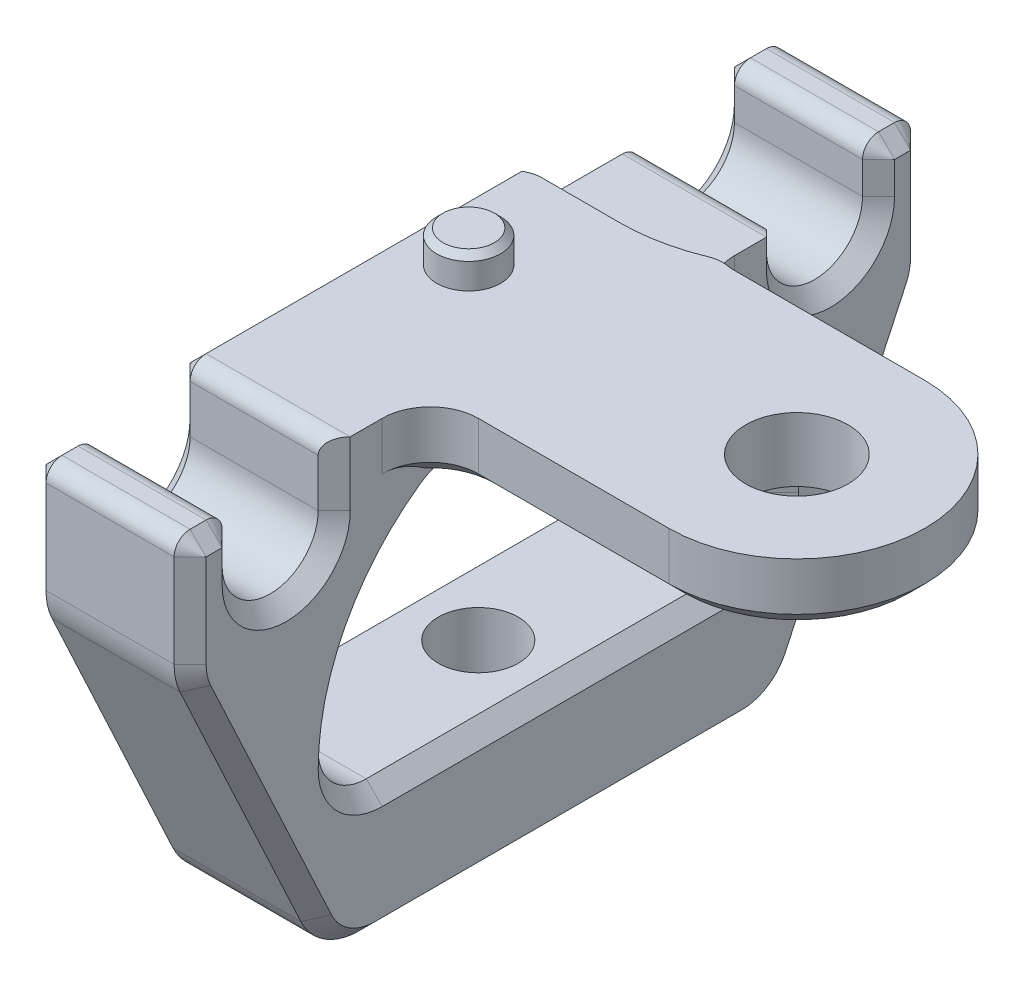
ISO-10303-21;
HEADER;
FILE_DESCRIPTION(('STEP AP214'),'2;1');
FILE_NAME('part.step','',(''),(''),'','','');
FILE_SCHEMA(('AUTOMOTIVE_DESIGN { 1 0 10303 214 1 1 1 1 }'));
ENDSEC;
DATA;
#1=APPLICATION_CONTEXT('core data for automotive mechanical design processes');
#2=APPLICATION_PROTOCOL_DEFINITION('international standard','automotive_design',2000,#1);
#3=PRODUCT_CONTEXT('',#1,'mechanical');
#4=PRODUCT('Part','Part','',(#3));
#5=PRODUCT_RELATED_PRODUCT_CATEGORY('part','',(#4));
#6=PRODUCT_DEFINITION_FORMATION('','',#4);
#7=PRODUCT_DEFINITION_CONTEXT('part definition',#1,'design');
#8=PRODUCT_DEFINITION('design','',#6,#7);
#9=PRODUCT_DEFINITION_SHAPE('','',#8);
#10=(LENGTH_UNIT() NAMED_UNIT(*) SI_UNIT(.MILLI.,.METRE.));
#11=(NAMED_UNIT(*) PLANE_ANGLE_UNIT() SI_UNIT($,.RADIAN.));
#12=(NAMED_UNIT(*) SI_UNIT($,.STERADIAN.) SOLID_ANGLE_UNIT());
#13=UNCERTAINTY_MEASURE_WITH_UNIT(LENGTH_MEASURE(1.E-05),#10,'distance_accuracy_value','');
#14=(GEOMETRIC_REPRESENTATION_CONTEXT(3) GLOBAL_UNCERTAINTY_ASSIGNED_CONTEXT((#13)) GLOBAL_UNIT_ASSIGNED_CONTEXT((#10,
#11,#12)) REPRESENTATION_CONTEXT('',''));
#15=CARTESIAN_POINT('',(0.,0.,0.));
#16=DIRECTION('',(0.,0.,1.));
#17=DIRECTION('',(1.,0.,0.));
#18=AXIS2_PLACEMENT_3D('',#15,#16,#17);
#19=CARTESIAN_POINT('',(-7.94999999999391,0.,-10.5));
#20=DIRECTION('',(-1.,0.,0.));
#21=DIRECTION('',(0.,0.,1.));
#22=AXIS2_PLACEMENT_3D('',#19,#20,#21);
#23=CONICAL_SURFACE('',#22,0.500000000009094,0.785398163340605);
#24=DIRECTION('',(-0.707106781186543,0.,0.707106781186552));
#25=VECTOR('',#24,1.);
#26=CARTESIAN_POINT('',(-7.94999999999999,0.,-10.));
#27=LINE('',#26,#25);
#28=CARTESIAN_POINT('',(-7.94999999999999,0.,-10.));
#29=VERTEX_POINT('',#28);
#30=CARTESIAN_POINT('',(-7.44999999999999,0.,-10.5));
#31=VERTEX_POINT('',#30);
#32=EDGE_CURVE('E322',#29,#31,#27,.F.);
#33=ORIENTED_EDGE('',*,*,#32,.T.);
#34=DIRECTION('',(0.707106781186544,-0.707106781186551,0.));
#35=VECTOR('',#34,1.);
#36=CARTESIAN_POINT('',(-7.94999999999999,0.499999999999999,-10.5));
#37=LINE('',#36,#35);
#38=CARTESIAN_POINT('',(-7.94999999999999,0.499999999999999,-10.5));
#39=VERTEX_POINT('',#38);
#40=EDGE_CURVE('E312',#31,#39,#37,.F.);
#41=ORIENTED_EDGE('',*,*,#40,.T.);
#42=CARTESIAN_POINT('',(-7.94999999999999,0.,-10.5));
#43=DIRECTION('',(-1.,0.,0.));
#44=DIRECTION('',(0.,0.,1.));
#45=AXIS2_PLACEMENT_3D('',#42,#43,#44);
#46=CIRCLE('',#45,0.5);
#47=EDGE_CURVE('E319',#29,#39,#46,.T.);
#48=ORIENTED_EDGE('',*,*,#47,.F.);
#49=EDGE_LOOP('',(#33,#41,#48));
#50=FACE_BOUND('',#49,.T.);
#51=ADVANCED_FACE('F17',(#50),#23,.T.);
#52=CARTESIAN_POINT('',(-7.94999999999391,0.,11.));
#53=DIRECTION('',(-1.,0.,0.));
#54=DIRECTION('',(0.,0.,1.));
#55=AXIS2_PLACEMENT_3D('',#52,#53,#54);
#56=CONICAL_SURFACE('',#55,0.500000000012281,0.785398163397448);
#57=CARTESIAN_POINT('',(-7.94999999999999,0.,11.));
#58=DIRECTION('',(-1.,0.,0.));
#59=DIRECTION('',(0.,0.,1.));
#60=AXIS2_PLACEMENT_3D('',#57,#58,#59);
#61=CIRCLE('',#60,0.5);
#62=CARTESIAN_POINT('',(-7.94999999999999,0.,11.5));
#63=VERTEX_POINT('',#62);
#64=CARTESIAN_POINT('',(-7.94999999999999,0.500000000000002,11.));
#65=VERTEX_POINT('',#64);
#66=EDGE_CURVE('E857',#63,#65,#61,.T.);
#67=ORIENTED_EDGE('',*,*,#66,.F.);
#68=DIRECTION('',(-0.707106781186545,0.,0.70710678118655));
#69=VECTOR('',#68,1.);
#70=CARTESIAN_POINT('',(-7.94999999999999,0.,11.5));
#71=LINE('',#70,#69);
#72=CARTESIAN_POINT('',(-7.44999999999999,0.,11.));
#73=VERTEX_POINT('',#72);
#74=EDGE_CURVE('E845',#63,#73,#71,.F.);
#75=ORIENTED_EDGE('',*,*,#74,.T.);
#76=DIRECTION('',(0.707106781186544,-0.707106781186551,0.));
#77=VECTOR('',#76,1.);
#78=CARTESIAN_POINT('',(-7.94999999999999,0.500000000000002,11.));
#79=LINE('',#78,#77);
#80=EDGE_CURVE('E323',#73,#65,#79,.F.);
#81=ORIENTED_EDGE('',*,*,#80,.T.);
#82=EDGE_LOOP('',(#67,#75,#81));
#83=FACE_BOUND('',#82,.T.);
#84=ADVANCED_FACE('F1947',(#83),#56,.T.);
#85=CARTESIAN_POINT('',(-7.44999999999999,0.499999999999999,-11.5));
#86=DIRECTION('',(0.,1.,0.));
#87=DIRECTION('',(0.,0.,1.));
#88=AXIS2_PLACEMENT_3D('',#85,#86,#87);
#89=PLANE('',#88);
#90=DIRECTION('',(-1.,0.,0.));
#91=VECTOR('',#90,1.);
#92=CARTESIAN_POINT('',(-7.44999999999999,0.5,-10.5));
#93=LINE('',#92,#91);
#94=CARTESIAN_POINT('',(-11.95,0.499999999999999,-10.5));
#95=VERTEX_POINT('',#94);
#96=EDGE_CURVE('E293',#39,#95,#93,.T.);
#97=ORIENTED_EDGE('',*,*,#96,.F.);
#98=DIRECTION('',(0.,0.,1.));
#99=VECTOR('',#98,1.);
#100=CARTESIAN_POINT('',(-7.94999999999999,0.499999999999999,-11.5));
#101=LINE('',#100,#99);
#102=CARTESIAN_POINT('',(-7.94999999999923,0.499999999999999,-11.));
#103=VERTEX_POINT('',#102);
#104=EDGE_CURVE('E297',#39,#103,#101,.F.);
#105=ORIENTED_EDGE('',*,*,#104,.T.);
#106=DIRECTION('',(-1.,0.,0.));
#107=VECTOR('',#106,1.);
#108=CARTESIAN_POINT('',(-7.44999999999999,0.5,-11.));
#109=LINE('',#108,#107);
#110=CARTESIAN_POINT('',(-11.95,0.499999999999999,-11.));
#111=VERTEX_POINT('',#110);
#112=EDGE_CURVE('E339',#111,#103,#109,.F.);
#113=ORIENTED_EDGE('',*,*,#112,.F.);
#114=DIRECTION('',(0.,0.,1.));
#115=VECTOR('',#114,1.);
#116=CARTESIAN_POINT('',(-11.95,0.499999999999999,-11.5));
#117=LINE('',#116,#115);
#118=EDGE_CURVE('E300',#111,#95,#117,.T.);
#119=ORIENTED_EDGE('',*,*,#118,.T.);
#120=EDGE_LOOP('',(#97,#105,#113,#119));
#121=FACE_BOUND('',#120,.T.);
#122=ADVANCED_FACE('F295',(#121),#89,.T.);
#123=CARTESIAN_POINT('',(-7.94999999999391,0.,-11.));
#124=DIRECTION('',(-1.,0.,0.));
#125=DIRECTION('',(0.,0.,1.));
#126=AXIS2_PLACEMENT_3D('',#123,#124,#125);
#127=CONICAL_SURFACE('',#126,0.500000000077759,0.785398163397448);
#128=DIRECTION('',(0.707106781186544,-0.707106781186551,0.));
#129=VECTOR('',#128,1.);
#130=CARTESIAN_POINT('',(-7.94999999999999,0.499999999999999,-11.));
#131=LINE('',#130,#129);
#132=CARTESIAN_POINT('',(-7.44999999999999,0.,-11.));
#133=VERTEX_POINT('',#132);
#134=EDGE_CURVE('E315',#103,#133,#131,.T.);
#135=ORIENTED_EDGE('',*,*,#134,.T.);
#136=DIRECTION('',(0.707106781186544,0.,0.707106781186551));
#137=VECTOR('',#136,1.);
#138=CARTESIAN_POINT('',(-7.94999999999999,0.,-11.5));
#139=LINE('',#138,#137);
#140=CARTESIAN_POINT('',(-7.94999999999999,0.,-11.5));
#141=VERTEX_POINT('',#140);
#142=EDGE_CURVE('E740',#133,#141,#139,.F.);
#143=ORIENTED_EDGE('',*,*,#142,.T.);
#144=CARTESIAN_POINT('',(-7.94999999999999,0.,-11.));
#145=DIRECTION('',(-1.,0.,0.));
#146=DIRECTION('',(0.,0.,1.));
#147=AXIS2_PLACEMENT_3D('',#144,#145,#146);
#148=CIRCLE('',#147,0.5);
#149=EDGE_CURVE('E341',#103,#141,#148,.T.);
#150=ORIENTED_EDGE('',*,*,#149,.F.);
#151=EDGE_LOOP('',(#135,#143,#150));
#152=FACE_BOUND('',#151,.T.);
#153=ADVANCED_FACE('F1939',(#152),#127,.T.);
#154=CARTESIAN_POINT('',(-7.44999999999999,0.,-10.5));
#155=DIRECTION('',(-1.,0.,0.));
#156=DIRECTION('',(0.,0.,1.));
#157=AXIS2_PLACEMENT_3D('',#154,#155,#156);
#158=CYLINDRICAL_SURFACE('',#157,0.5);
#159=DIRECTION('',(1.,0.,0.));
#160=VECTOR('',#159,1.);
#161=CARTESIAN_POINT('',(-7.44999999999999,0.,-10.));
#162=LINE('',#161,#160);
#163=CARTESIAN_POINT('',(-11.95,0.,-10.));
#164=VERTEX_POINT('',#163);
#165=EDGE_CURVE('E327',#29,#164,#162,.F.);
#166=ORIENTED_EDGE('',*,*,#165,.F.);
#167=ORIENTED_EDGE('',*,*,#47,.T.);
#168=ORIENTED_EDGE('',*,*,#96,.T.);
#169=CARTESIAN_POINT('',(-11.95,0.,-10.5));
#170=DIRECTION('',(-1.,0.,0.));
#171=DIRECTION('',(0.,0.,1.));
#172=AXIS2_PLACEMENT_3D('',#169,#170,#171);
#173=CIRCLE('',#172,0.5);
#174=EDGE_CURVE('E304',#95,#164,#173,.F.);
#175=ORIENTED_EDGE('',*,*,#174,.T.);
#176=EDGE_LOOP('',(#166,#167,#168,#175));
#177=FACE_BOUND('',#176,.T.);
#178=ADVANCED_FACE('F325',(#177),#158,.T.);
#179=CARTESIAN_POINT('',(-7.94999999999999,-0.999999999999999,7.));
#180=DIRECTION('',(-0.707106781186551,0.,-0.707106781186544));
#181=DIRECTION('',(-0.707106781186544,0.,0.707106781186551));
#182=AXIS2_PLACEMENT_3D('',#179,#180,#181);
#183=PLANE('',#182);
#184=DIRECTION('',(0.,1.,0.));
#185=VECTOR('',#184,1.);
#186=CARTESIAN_POINT('',(-7.94999999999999,-0.999999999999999,7.));
#187=LINE('',#186,#185);
#188=CARTESIAN_POINT('',(-7.94999999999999,-0.999999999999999,7.));
#189=VERTEX_POINT('',#188);
#190=CARTESIAN_POINT('',(-7.94999999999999,0.5,7.));
#191=VERTEX_POINT('',#190);
#192=EDGE_CURVE('E268',#189,#191,#187,.T.);
#193=ORIENTED_EDGE('',*,*,#192,.F.);
#194=DIRECTION('',(-0.707106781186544,0.,0.707106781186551));
#195=VECTOR('',#194,1.);
#196=CARTESIAN_POINT('',(-7.94999999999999,-0.999999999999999,7.));
#197=LINE('',#196,#195);
#198=CARTESIAN_POINT('',(-7.45000000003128,-0.999999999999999,6.50000000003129));
#199=VERTEX_POINT('',#198);
#200=EDGE_CURVE('E279',#199,#189,#197,.T.);
#201=ORIENTED_EDGE('',*,*,#200,.F.);
#202=DIRECTION('',(0.,1.,0.));
#203=VECTOR('',#202,1.);
#204=CARTESIAN_POINT('',(-7.44999999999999,-0.999999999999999,6.5));
#205=LINE('',#204,#203);
#206=CARTESIAN_POINT('',(-7.44999999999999,1.,6.5));
#207=VERTEX_POINT('',#206);
#208=EDGE_CURVE('E957',#207,#199,#205,.F.);
#209=ORIENTED_EDGE('',*,*,#208,.F.);
#210=CARTESIAN_POINT('',(-7.44999999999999,0.5,6.5));
#211=DIRECTION('',(-0.707106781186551,0.,-0.707106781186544));
#212=DIRECTION('',(-0.707106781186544,0.,0.707106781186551));
#213=AXIS2_PLACEMENT_3D('',#210,#211,#212);
#214=ELLIPSE('',#213,0.707106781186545,0.5);
#215=EDGE_CURVE('E20',#191,#207,#214,.T.);
#216=ORIENTED_EDGE('',*,*,#215,.F.);
#217=EDGE_LOOP('',(#193,#201,#209,#216));
#218=FACE_BOUND('',#217,.T.);
#219=ADVANCED_FACE('F1929',(#218),#183,.F.);
#220=CARTESIAN_POINT('',(-7.94999999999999,0.500000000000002,11.5));
#221=DIRECTION('',(-0.707106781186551,-0.707106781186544,0.));
#222=DIRECTION('',(0.707106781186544,-0.707106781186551,0.));
#223=AXIS2_PLACEMENT_3D('',#220,#221,#222);
#224=PLANE('',#223);
#225=DIRECTION('',(0.,0.,1.));
#226=VECTOR('',#225,1.);
#227=CARTESIAN_POINT('',(-7.94999999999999,0.500000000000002,11.5));
#228=LINE('',#227,#226);
#229=CARTESIAN_POINT('',(-7.94999999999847,0.500000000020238,10.5));
#230=VERTEX_POINT('',#229);
#231=EDGE_CURVE('E963',#65,#230,#228,.F.);
#232=ORIENTED_EDGE('',*,*,#231,.F.);
#233=ORIENTED_EDGE('',*,*,#80,.F.);
#234=DIRECTION('',(0.,0.,-1.));
#235=VECTOR('',#234,1.);
#236=CARTESIAN_POINT('',(-7.44999999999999,0.,8.5));
#237=LINE('',#236,#235);
#238=CARTESIAN_POINT('',(-7.449999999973,8.97974186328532E-12,10.5));
#239=VERTEX_POINT('',#238);
#240=EDGE_CURVE('E949',#239,#73,#237,.F.);
#241=ORIENTED_EDGE('',*,*,#240,.F.);
#242=CARTESIAN_POINT('',(-7.94999999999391,0.500000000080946,10.5));
#243=CARTESIAN_POINT('',(-7.92916666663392,0.479166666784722,10.5000000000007));
#244=CARTESIAN_POINT('',(-7.90833333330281,0.458333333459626,10.5000000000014));
#245=CARTESIAN_POINT('',(-7.86666666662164,0.416666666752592,10.5000000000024));
#246=CARTESIAN_POINT('',(-7.84583333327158,0.395833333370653,10.5000000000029));
#247=CARTESIAN_POINT('',(-7.80416666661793,0.354166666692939,10.5000000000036));
#248=CARTESIAN_POINT('',(-7.78333333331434,0.333333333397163,10.5000000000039));
#249=CARTESIAN_POINT('',(-7.74166666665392,0.291666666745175,10.5000000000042));
#250=CARTESIAN_POINT('',(-7.72083333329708,0.270833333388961,10.5000000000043));
#251=CARTESIAN_POINT('',(-7.67916666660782,0.229166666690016,10.5000000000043));
#252=CARTESIAN_POINT('',(-7.65833333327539,0.208333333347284,10.5000000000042));
#253=CARTESIAN_POINT('',(-7.61666666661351,0.166666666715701,10.5000000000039));
#254=CARTESIAN_POINT('',(-7.59583333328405,0.145833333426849,10.5000000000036));
#255=CARTESIAN_POINT('',(-7.55416666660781,0.104166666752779,10.5000000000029));
#256=CARTESIAN_POINT('',(-7.53333333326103,0.0833333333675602,10.5000000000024));
#257=CARTESIAN_POINT('',(-7.49166666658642,0.0416666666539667,10.5000000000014));
#258=CARTESIAN_POINT('',(-7.47083333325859,0.0208333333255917,10.5000000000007));
#259=CARTESIAN_POINT('',(-7.44999999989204,3.59261231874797E-11,10.5));
#260=B_SPLINE_CURVE_WITH_KNOTS('',3,(#242,#243,#244,#245,#246,#247,#248,#249,#250,#251,#252,
#253,#254,#255,#256,#257,#258,#259),.UNSPECIFIED.,.F.,.F.,(4,2,2,2,2,2,2,2,4),(0.,
0.0883883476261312,0.17677669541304,0.265165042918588,0.353553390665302,0.441941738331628,
0.53033008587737,0.618718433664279,0.70710678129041),.UNSPECIFIED.);
#261=EDGE_CURVE('E932',#230,#239,#260,.T.);
#262=ORIENTED_EDGE('',*,*,#261,.F.);
#263=EDGE_LOOP('',(#232,#233,#241,#262));
#264=FACE_BOUND('',#263,.T.);
#265=ADVANCED_FACE('F1931',(#264),#224,.F.);
#266=CARTESIAN_POINT('',(-7.94999999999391,-2.90632953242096,9.5));
#267=DIRECTION('',(-1.,0.,0.));
#268=DIRECTION('',(0.,0.,1.));
#269=AXIS2_PLACEMENT_3D('',#266,#267,#268);
#270=CONICAL_SURFACE('',#269,2.00000000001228,0.785398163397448);
#271=DIRECTION('',(-0.707106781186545,0.,0.70710678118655));
#272=VECTOR('',#271,1.);
#273=CARTESIAN_POINT('',(-7.94999999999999,-2.90632953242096,11.5));
#274=LINE('',#273,#272);
#275=CARTESIAN_POINT('',(-7.45000000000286,-2.90632953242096,11.0000000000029));
#276=VERTEX_POINT('',#275);
#277=CARTESIAN_POINT('',(-7.94999999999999,-2.90632953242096,11.5));
#278=VERTEX_POINT('',#277);
#279=EDGE_CURVE('E854',#276,#278,#274,.T.);
#280=ORIENTED_EDGE('',*,*,#279,.T.);
#281=CARTESIAN_POINT('',(-7.94999999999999,-2.90632953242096,9.5));
#282=DIRECTION('',(-1.,0.,0.));
#283=DIRECTION('',(0.,0.,1.));
#284=AXIS2_PLACEMENT_3D('',#281,#282,#283);
#285=CIRCLE('',#284,2.);
#286=CARTESIAN_POINT('',(-7.94999999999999,-3.75156605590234,11.3126155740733));
#287=VERTEX_POINT('',#286);
#288=EDGE_CURVE('E835',#287,#278,#285,.T.);
#289=ORIENTED_EDGE('',*,*,#288,.F.);
#290=DIRECTION('',(0.707106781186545,0.298836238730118,-0.640856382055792));
#291=VECTOR('',#290,1.);
#292=CARTESIAN_POINT('',(-7.94999999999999,-3.75156605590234,11.3126155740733));
#293=LINE('',#292,#291);
#294=CARTESIAN_POINT('',(-7.45000000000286,-3.54025692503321,10.8594616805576));
#295=VERTEX_POINT('',#294);
#296=EDGE_CURVE('E825',#287,#295,#293,.T.);
#297=ORIENTED_EDGE('',*,*,#296,.T.);
#298=CARTESIAN_POINT('',(-7.45000000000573,-2.90632953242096,9.5));
#299=DIRECTION('',(-1.,0.,0.));
#300=DIRECTION('',(0.,0.,1.));
#301=AXIS2_PLACEMENT_3D('',#298,#299,#300);
#302=CIRCLE('',#301,1.5000000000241);
#303=EDGE_CURVE('E495',#276,#295,#302,.F.);
#304=ORIENTED_EDGE('',*,*,#303,.F.);
#305=EDGE_LOOP('',(#280,#289,#297,#304));
#306=FACE_BOUND('',#305,.T.);
#307=ADVANCED_FACE('F1937',(#306),#270,.T.);
#308=CARTESIAN_POINT('',(-7.94999999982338,-2.90632953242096,-9.5));
#309=DIRECTION('',(-1.,0.,0.));
#310=DIRECTION('',(0.,0.,1.));
#311=AXIS2_PLACEMENT_3D('',#308,#309,#310);
#312=CONICAL_SURFACE('',#311,1.99999999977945,0.785398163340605);
#313=DIRECTION('',(-0.707106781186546,-0.298836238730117,-0.640856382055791));
#314=VECTOR('',#313,1.);
#315=CARTESIAN_POINT('',(-7.44999999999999,-3.540256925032,-10.859461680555));
#316=LINE('',#315,#314);
#317=CARTESIAN_POINT('',(-7.45000000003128,-3.54025692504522,-10.8594616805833));
#318=VERTEX_POINT('',#317);
#319=CARTESIAN_POINT('',(-7.94999999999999,-3.75156605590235,-11.3126155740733));
#320=VERTEX_POINT('',#319);
#321=EDGE_CURVE('E771',#318,#320,#316,.T.);
#322=ORIENTED_EDGE('',*,*,#321,.T.);
#323=CARTESIAN_POINT('',(-7.94999999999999,-2.90632953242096,-9.5));
#324=DIRECTION('',(-1.,0.,0.));
#325=DIRECTION('',(0.,0.,1.));
#326=AXIS2_PLACEMENT_3D('',#323,#324,#325);
#327=CIRCLE('',#326,2.);
#328=CARTESIAN_POINT('',(-7.94999999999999,-2.90632953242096,-11.5));
#329=VERTEX_POINT('',#328);
#330=EDGE_CURVE('E749',#329,#320,#327,.T.);
#331=ORIENTED_EDGE('',*,*,#330,.F.);
#332=DIRECTION('',(0.707106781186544,0.,0.707106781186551));
#333=VECTOR('',#332,1.);
#334=CARTESIAN_POINT('',(-7.94999999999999,-2.90632953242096,-11.5));
#335=LINE('',#334,#333);
#336=CARTESIAN_POINT('',(-7.45000000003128,-2.90632953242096,-11.0000000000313));
#337=VERTEX_POINT('',#336);
#338=EDGE_CURVE('E754',#329,#337,#335,.T.);
#339=ORIENTED_EDGE('',*,*,#338,.T.);
#340=CARTESIAN_POINT('',(-7.45000000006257,-2.90632953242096,-9.5));
#341=DIRECTION('',(-1.,0.,0.));
#342=DIRECTION('',(0.,0.,1.));
#343=AXIS2_PLACEMENT_3D('',#340,#341,#342);
#344=CIRCLE('',#343,1.50000000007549);
#345=EDGE_CURVE('E482',#318,#337,#344,.F.);
#346=ORIENTED_EDGE('',*,*,#345,.F.);
#347=EDGE_LOOP('',(#322,#331,#339,#346));
#348=FACE_BOUND('',#347,.T.);
#349=ADVANCED_FACE('F1993',(#348),#312,.T.);
#350=CARTESIAN_POINT('',(-7.94999999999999,0.499999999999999,-11.5));
#351=DIRECTION('',(-0.707106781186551,-0.707106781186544,0.));
#352=DIRECTION('',(0.707106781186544,-0.707106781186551,0.));
#353=AXIS2_PLACEMENT_3D('',#350,#351,#352);
#354=PLANE('',#353);
#355=ORIENTED_EDGE('',*,*,#104,.F.);
#356=ORIENTED_EDGE('',*,*,#40,.F.);
#357=DIRECTION('',(0.,0.,-1.));
#358=VECTOR('',#357,1.);
#359=CARTESIAN_POINT('',(-7.44999999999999,0.,8.5));
#360=LINE('',#359,#358);
#361=EDGE_CURVE('E975',#133,#31,#360,.F.);
#362=ORIENTED_EDGE('',*,*,#361,.F.);
#363=ORIENTED_EDGE('',*,*,#134,.F.);
#364=EDGE_LOOP('',(#355,#356,#362,#363));
#365=FACE_BOUND('',#364,.T.);
#366=ADVANCED_FACE('F310',(#365),#354,.F.);
#367=CARTESIAN_POINT('',(-7.94999999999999,0.499999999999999,-10.));
#368=DIRECTION('',(-0.707106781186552,0.,-0.707106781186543));
#369=DIRECTION('',(-0.707106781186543,0.,0.707106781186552));
#370=AXIS2_PLACEMENT_3D('',#367,#368,#369);
#371=PLANE('',#370);
#372=DIRECTION('',(0.,1.,0.));
#373=VECTOR('',#372,1.);
#374=CARTESIAN_POINT('',(-7.94999999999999,0.499999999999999,-10.));
#375=LINE('',#374,#373);
#376=CARTESIAN_POINT('',(-7.95000000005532,-1.,-9.99999999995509));
#377=VERTEX_POINT('',#376);
#378=EDGE_CURVE('E730',#377,#29,#375,.T.);
#379=ORIENTED_EDGE('',*,*,#378,.F.);
#380=DIRECTION('',(-0.707106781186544,0.,0.707106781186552));
#381=VECTOR('',#380,1.);
#382=CARTESIAN_POINT('',(498982.049999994,-1.,-499000.));
#383=LINE('',#382,#381);
#384=CARTESIAN_POINT('',(-7.45000000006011,-1.,-10.500000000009));
#385=VERTEX_POINT('',#384);
#386=EDGE_CURVE('E737',#377,#385,#383,.F.);
#387=ORIENTED_EDGE('',*,*,#386,.T.);
#388=DIRECTION('',(0.,1.,0.));
#389=VECTOR('',#388,1.);
#390=CARTESIAN_POINT('',(-7.44999999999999,-0.999999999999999,-10.5));
#391=LINE('',#390,#389);
#392=EDGE_CURVE('E481',#31,#385,#391,.F.);
#393=ORIENTED_EDGE('',*,*,#392,.F.);
#394=ORIENTED_EDGE('',*,*,#32,.F.);
#395=EDGE_LOOP('',(#379,#387,#393,#394));
#396=FACE_BOUND('',#395,.T.);
#397=ADVANCED_FACE('F1009',(#396),#371,.F.);
#398=CARTESIAN_POINT('',(-7.44999999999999,0.500000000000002,11.5));
#399=DIRECTION('',(0.,1.,0.));
#400=DIRECTION('',(0.,0.,1.));
#401=AXIS2_PLACEMENT_3D('',#398,#399,#400);
#402=PLANE('',#401);
#403=DIRECTION('',(-1.,0.,0.));
#404=VECTOR('',#403,1.);
#405=CARTESIAN_POINT('',(-7.44999999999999,0.500000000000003,11.));
#406=LINE('',#405,#404);
#407=CARTESIAN_POINT('',(-11.9500000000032,0.49999999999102,11.));
#408=VERTEX_POINT('',#407);
#409=EDGE_CURVE('E862',#65,#408,#406,.T.);
#410=ORIENTED_EDGE('',*,*,#409,.F.);
#411=ORIENTED_EDGE('',*,*,#231,.T.);
#412=DIRECTION('',(-1.,0.,0.));
#413=VECTOR('',#412,1.);
#414=CARTESIAN_POINT('',(-7.44999999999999,0.500000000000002,10.5));
#415=LINE('',#414,#413);
#416=CARTESIAN_POINT('',(-11.9500000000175,0.499999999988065,10.5));
#417=VERTEX_POINT('',#416);
#418=EDGE_CURVE('E874',#417,#230,#415,.F.);
#419=ORIENTED_EDGE('',*,*,#418,.F.);
#420=DIRECTION('',(0.,0.,1.));
#421=VECTOR('',#420,1.);
#422=CARTESIAN_POINT('',(-11.95,0.500000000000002,11.5));
#423=LINE('',#422,#421);
#424=EDGE_CURVE('E960',#417,#408,#423,.T.);
#425=ORIENTED_EDGE('',*,*,#424,.T.);
#426=EDGE_LOOP('',(#410,#411,#419,#425));
#427=FACE_BOUND('',#426,.T.);
#428=ADVANCED_FACE('F2288',(#427),#402,.T.);
#429=CARTESIAN_POINT('',(-7.94999999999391,0.,10.5));
#430=DIRECTION('',(-1.,0.,0.));
#431=DIRECTION('',(0.,0.,1.));
#432=AXIS2_PLACEMENT_3D('',#429,#430,#431);
#433=CONICAL_SURFACE('',#432,0.500000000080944,0.785398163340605);
#434=CARTESIAN_POINT('',(-7.94999999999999,0.,10.5));
#435=DIRECTION('',(-1.,0.,0.));
#436=DIRECTION('',(0.,0.,1.));
#437=AXIS2_PLACEMENT_3D('',#434,#435,#436);
#438=CIRCLE('',#437,0.5);
#439=CARTESIAN_POINT('',(-7.94999999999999,0.,10.));
#440=VERTEX_POINT('',#439);
#441=EDGE_CURVE('E877',#230,#440,#438,.T.);
#442=ORIENTED_EDGE('',*,*,#441,.F.);
#443=ORIENTED_EDGE('',*,*,#261,.T.);
#444=DIRECTION('',(0.707106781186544,0.,0.707106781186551));
#445=VECTOR('',#444,1.);
#446=CARTESIAN_POINT('',(-7.94999999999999,0.,10.));
#447=LINE('',#446,#445);
#448=EDGE_CURVE('E1288',#239,#440,#447,.F.);
#449=ORIENTED_EDGE('',*,*,#448,.T.);
#450=EDGE_LOOP('',(#442,#443,#449));
#451=FACE_BOUND('',#450,.T.);
#452=ADVANCED_FACE('F944',(#451),#433,.T.);
#453=CARTESIAN_POINT('',(-7.44999999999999,-9.5,8.5));
#454=DIRECTION('',(0.707106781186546,0.707106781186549,0.));
#455=DIRECTION('',(-0.707106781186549,0.707106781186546,0.));
#456=AXIS2_PLACEMENT_3D('',#453,#454,#455);
#457=PLANE('',#456);
#458=DIRECTION('',(-0.707106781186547,0.707106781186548,0.));
#459=VECTOR('',#458,1.);
#460=CARTESIAN_POINT('',(498996.049999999,-499013.,5.50000000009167));
#461=LINE('',#460,#459);
#462=CARTESIAN_POINT('',(-7.9500000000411,-8.99999999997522,5.5));
#463=VERTEX_POINT('',#462);
#464=CARTESIAN_POINT('',(-7.45000000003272,-9.50000000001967,5.5));
#465=VERTEX_POINT('',#464);
#466=EDGE_CURVE('E924',#463,#465,#461,.F.);
#467=ORIENTED_EDGE('',*,*,#466,.T.);
#468=DIRECTION('',(0.,0.,-1.));
#469=VECTOR('',#468,1.);
#470=CARTESIAN_POINT('',(-7.44999999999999,-9.5,8.5));
#471=LINE('',#470,#469);
#472=CARTESIAN_POINT('',(-7.44999999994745,-9.49999999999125,-5.5));
#473=VERTEX_POINT('',#472);
#474=EDGE_CURVE('E706',#473,#465,#471,.F.);
#475=ORIENTED_EDGE('',*,*,#474,.F.);
#476=DIRECTION('',(-0.707106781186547,0.707106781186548,0.));
#477=VECTOR('',#476,1.);
#478=CARTESIAN_POINT('',(498985.049999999,-499002.,-5.49999999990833));
#479=LINE('',#478,#477);
#480=CARTESIAN_POINT('',(-7.94999999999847,-8.99999999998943,-5.5));
#481=VERTEX_POINT('',#480);
#482=EDGE_CURVE('E899',#473,#481,#479,.T.);
#483=ORIENTED_EDGE('',*,*,#482,.T.);
#484=DIRECTION('',(0.,0.,-1.));
#485=VECTOR('',#484,1.);
#486=CARTESIAN_POINT('',(-7.94999999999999,-9.00000000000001,-6.83739716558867));
#487=LINE('',#486,#485);
#488=EDGE_CURVE('E475',#481,#463,#487,.F.);
#489=ORIENTED_EDGE('',*,*,#488,.T.);
#490=EDGE_LOOP('',(#467,#475,#483,#489));
#491=FACE_BOUND('',#490,.T.);
#492=ADVANCED_FACE('F942',(#491),#457,.T.);
#493=CARTESIAN_POINT('',(-7.45000000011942,-7.5,5.5));
#494=DIRECTION('',(1.,0.,0.));
#495=DIRECTION('',(0.,0.,-1.));
#496=AXIS2_PLACEMENT_3D('',#493,#494,#495);
#497=CONICAL_SURFACE('',#496,1.99999999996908,0.785398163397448);
#498=CARTESIAN_POINT('',(-7.94999999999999,-7.5,5.5));
#499=DIRECTION('',(-1.,0.,0.));
#500=DIRECTION('',(0.,0.,1.));
#501=AXIS2_PLACEMENT_3D('',#498,#499,#500);
#502=CIRCLE('',#501,1.5);
#503=CARTESIAN_POINT('',(-7.94999999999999,-7.5,7.));
#504=VERTEX_POINT('',#503);
#505=EDGE_CURVE('E895',#463,#504,#502,.T.);
#506=ORIENTED_EDGE('',*,*,#505,.T.);
#507=DIRECTION('',(-0.707106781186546,0.,-0.707106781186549));
#508=VECTOR('',#507,1.);
#509=CARTESIAN_POINT('',(-7.44999999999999,-7.5,7.5));
#510=LINE('',#509,#508);
#511=CARTESIAN_POINT('',(-7.45000000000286,-7.5,7.49999999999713));
#512=VERTEX_POINT('',#511);
#513=EDGE_CURVE('E922',#504,#512,#510,.F.);
#514=ORIENTED_EDGE('',*,*,#513,.T.);
#515=CARTESIAN_POINT('',(-7.45000000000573,-7.5,5.5));
#516=DIRECTION('',(1.,0.,0.));
#517=DIRECTION('',(0.,0.,-1.));
#518=AXIS2_PLACEMENT_3D('',#515,#516,#517);
#519=CIRCLE('',#518,2.00000000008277);
#520=EDGE_CURVE('E707',#465,#512,#519,.F.);
#521=ORIENTED_EDGE('',*,*,#520,.F.);
#522=ORIENTED_EDGE('',*,*,#466,.F.);
#523=EDGE_LOOP('',(#506,#514,#521,#522));
#524=FACE_BOUND('',#523,.T.);
#525=ADVANCED_FACE('F2042',(#524),#497,.F.);
#526=CARTESIAN_POINT('',(-7.44999999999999,-7.5,0.));
#527=DIRECTION('',(1.,0.,0.));
#528=DIRECTION('',(0.,0.,-1.));
#529=AXIS2_PLACEMENT_3D('',#526,#527,#528);
#530=CONICAL_SURFACE('',#529,7.5,0.785398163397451);
#531=CARTESIAN_POINT('',(-7.44999999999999,-7.5,0.));
#532=DIRECTION('',(1.,0.,0.));
#533=DIRECTION('',(0.,0.,-1.));
#534=AXIS2_PLACEMENT_3D('',#531,#532,#533);
#535=CIRCLE('',#534,7.5);
#536=CARTESIAN_POINT('',(-7.45000000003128,-1.36363636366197,4.31219680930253));
#537=VERTEX_POINT('',#536);
#538=EDGE_CURVE('E709',#512,#537,#535,.F.);
#539=ORIENTED_EDGE('',*,*,#538,.F.);
#540=ORIENTED_EDGE('',*,*,#513,.F.);
#541=CARTESIAN_POINT('',(-7.94999999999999,-7.5,0.));
#542=DIRECTION('',(-1.,0.,0.));
#543=DIRECTION('',(0.,0.,1.));
#544=AXIS2_PLACEMENT_3D('',#541,#542,#543);
#545=CIRCLE('',#544,7.);
#546=CARTESIAN_POINT('',(-7.95000000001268,-1.77272727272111,4.02471702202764));
#547=VERTEX_POINT('',#546);
#548=EDGE_CURVE('E916',#504,#547,#545,.T.);
#549=ORIENTED_EDGE('',*,*,#548,.T.);
#550=DIRECTION('',(-0.707106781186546,-0.578541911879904,-0.406557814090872));
#551=VECTOR('',#550,1.);
#552=CARTESIAN_POINT('',(-7.44999999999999,-1.36363636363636,4.31219680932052));
#553=LINE('',#552,#551);
#554=EDGE_CURVE('E908',#537,#547,#553,.T.);
#555=ORIENTED_EDGE('',*,*,#554,.F.);
#556=EDGE_LOOP('',(#539,#540,#549,#555));
#557=FACE_BOUND('',#556,.T.);
#558=ADVANCED_FACE('F2039',(#557),#530,.F.);
#559=CARTESIAN_POINT('',(-7.44999999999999,-7.5,0.));
#560=DIRECTION('',(1.,0.,0.));
#561=DIRECTION('',(0.,1.,0.));
#562=AXIS2_PLACEMENT_3D('',#559,#560,#561);
#563=CONICAL_SURFACE('',#562,7.5,0.78539816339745);
#564=CARTESIAN_POINT('',(-7.94999999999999,-7.5,0.));
#565=DIRECTION('',(-1.,0.,0.));
#566=DIRECTION('',(0.,0.,1.));
#567=AXIS2_PLACEMENT_3D('',#564,#565,#566);
#568=CIRCLE('',#567,7.);
#569=CARTESIAN_POINT('',(-7.94999999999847,-1.77272727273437,-4.02471702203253));
#570=VERTEX_POINT('',#569);
#571=CARTESIAN_POINT('',(-7.94999999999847,-7.50000000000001,-6.99999999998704));
#572=VERTEX_POINT('',#571);
#573=EDGE_CURVE('E880',#570,#572,#568,.T.);
#574=ORIENTED_EDGE('',*,*,#573,.T.);
#575=DIRECTION('',(-0.707106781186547,0.,0.707106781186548));
#576=VECTOR('',#575,1.);
#577=CARTESIAN_POINT('',(498985.049999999,-7.5,-499000.));
#578=LINE('',#577,#576);
#579=CARTESIAN_POINT('',(-7.4499999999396,-7.50000000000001,-7.49999999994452));
#580=VERTEX_POINT('',#579);
#581=EDGE_CURVE('E871',#572,#580,#578,.F.);
#582=ORIENTED_EDGE('',*,*,#581,.T.);
#583=CARTESIAN_POINT('',(-7.44999999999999,-7.5,0.));
#584=DIRECTION('',(1.,0.,0.));
#585=DIRECTION('',(0.,1.,0.));
#586=AXIS2_PLACEMENT_3D('',#583,#584,#585);
#587=CIRCLE('',#586,7.5);
#588=CARTESIAN_POINT('',(-7.45000000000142,-1.36363636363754,-4.31219680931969));
#589=VERTEX_POINT('',#588);
#590=EDGE_CURVE('E700',#589,#580,#587,.F.);
#591=ORIENTED_EDGE('',*,*,#590,.F.);
#592=DIRECTION('',(-0.707106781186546,-0.578541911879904,0.406557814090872));
#593=VECTOR('',#592,1.);
#594=CARTESIAN_POINT('',(-7.44999999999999,-1.36363636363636,-4.31219680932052));
#595=LINE('',#594,#593);
#596=EDGE_CURVE('E904',#570,#589,#595,.F.);
#597=ORIENTED_EDGE('',*,*,#596,.F.);
#598=EDGE_LOOP('',(#574,#582,#591,#597));
#599=FACE_BOUND('',#598,.T.);
#600=ADVANCED_FACE('F2035',(#599),#563,.F.);
#601=CARTESIAN_POINT('',(-7.44999999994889,-7.5,-5.5));
#602=DIRECTION('',(1.,0.,0.));
#603=DIRECTION('',(0.,0.,-1.));
#604=AXIS2_PLACEMENT_3D('',#601,#602,#603);
#605=CONICAL_SURFACE('',#604,1.99999999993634,0.785398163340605);
#606=CARTESIAN_POINT('',(-7.94999999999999,-7.5,-5.5));
#607=DIRECTION('',(-1.,0.,0.));
#608=DIRECTION('',(0.,0.,1.));
#609=AXIS2_PLACEMENT_3D('',#606,#607,#608);
#610=CIRCLE('',#609,1.5);
#611=EDGE_CURVE('E887',#572,#481,#610,.T.);
#612=ORIENTED_EDGE('',*,*,#611,.T.);
#613=ORIENTED_EDGE('',*,*,#482,.F.);
#614=CARTESIAN_POINT('',(-7.44999999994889,-7.5,-5.5));
#615=DIRECTION('',(1.,0.,0.));
#616=DIRECTION('',(0.,0.,-1.));
#617=AXIS2_PLACEMENT_3D('',#614,#615,#616);
#618=CIRCLE('',#617,1.99999999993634);
#619=EDGE_CURVE('E703',#580,#473,#618,.F.);
#620=ORIENTED_EDGE('',*,*,#619,.F.);
#621=ORIENTED_EDGE('',*,*,#581,.F.);
#622=EDGE_LOOP('',(#612,#613,#620,#621));
#623=FACE_BOUND('',#622,.T.);
#624=ADVANCED_FACE('F2032',(#623),#605,.F.);
#625=CARTESIAN_POINT('',(-7.44999999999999,0.,11.));
#626=DIRECTION('',(-1.,0.,0.));
#627=DIRECTION('',(0.,0.,1.));
#628=AXIS2_PLACEMENT_3D('',#625,#626,#627);
#629=CYLINDRICAL_SURFACE('',#628,0.5);
#630=DIRECTION('',(1.,0.,0.));
#631=VECTOR('',#630,1.);
#632=CARTESIAN_POINT('',(-7.44999999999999,0.,11.5));
#633=LINE('',#632,#631);
#634=CARTESIAN_POINT('',(-11.9500000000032,0.,11.499999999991));
#635=VERTEX_POINT('',#634);
#636=EDGE_CURVE('E1166',#63,#635,#633,.F.);
#637=ORIENTED_EDGE('',*,*,#636,.F.);
#638=ORIENTED_EDGE('',*,*,#66,.T.);
#639=ORIENTED_EDGE('',*,*,#409,.T.);
#640=CARTESIAN_POINT('',(-11.950000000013,0.,11.));
#641=DIRECTION('',(1.,0.,0.));
#642=DIRECTION('',(0.,0.,-1.));
#643=AXIS2_PLACEMENT_3D('',#640,#641,#642);
#644=CIRCLE('',#643,0.499999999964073);
#645=EDGE_CURVE('E1171',#635,#408,#644,.F.);
#646=ORIENTED_EDGE('',*,*,#645,.F.);
#647=EDGE_LOOP('',(#637,#638,#639,#646));
#648=FACE_BOUND('',#647,.T.);
#649=ADVANCED_FACE('F1955',(#648),#629,.T.);
#650=CARTESIAN_POINT('',(-7.94999999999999,-3.34971885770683,11.5));
#651=DIRECTION('',(-0.70710678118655,0.,-0.707106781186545));
#652=DIRECTION('',(-0.707106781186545,0.,0.70710678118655));
#653=AXIS2_PLACEMENT_3D('',#650,#651,#652);
#654=PLANE('',#653);
#655=DIRECTION('',(0.,-1.,0.));
#656=VECTOR('',#655,1.);
#657=CARTESIAN_POINT('',(-7.94999999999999,-3.34971885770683,11.5));
#658=LINE('',#657,#656);
#659=EDGE_CURVE('E848',#278,#63,#658,.F.);
#660=ORIENTED_EDGE('',*,*,#659,.F.);
#661=ORIENTED_EDGE('',*,*,#279,.F.);
#662=DIRECTION('',(0.,1.,0.));
#663=VECTOR('',#662,1.);
#664=CARTESIAN_POINT('',(-7.44999999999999,-0.999999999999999,11.));
#665=LINE('',#664,#663);
#666=EDGE_CURVE('E498',#73,#276,#665,.F.);
#667=ORIENTED_EDGE('',*,*,#666,.F.);
#668=ORIENTED_EDGE('',*,*,#74,.F.);
#669=EDGE_LOOP('',(#660,#661,#667,#668));
#670=FACE_BOUND('',#669,.T.);
#671=ADVANCED_FACE('F1962',(#670),#654,.F.);
#672=CARTESIAN_POINT('',(-7.44999999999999,-2.90632953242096,9.5));
#673=DIRECTION('',(-1.,0.,0.));
#674=DIRECTION('',(0.,0.,1.));
#675=AXIS2_PLACEMENT_3D('',#672,#673,#674);
#676=CYLINDRICAL_SURFACE('',#675,2.);
#677=DIRECTION('',(1.,0.,0.));
#678=VECTOR('',#677,1.);
#679=CARTESIAN_POINT('',(-7.44999999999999,-3.75156605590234,11.3126155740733));
#680=LINE('',#679,#678);
#681=CARTESIAN_POINT('',(-11.95,-3.75156605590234,11.3126155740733));
#682=VERTEX_POINT('',#681);
#683=EDGE_CURVE('E831',#287,#682,#680,.F.);
#684=ORIENTED_EDGE('',*,*,#683,.F.);
#685=ORIENTED_EDGE('',*,*,#288,.T.);
#686=DIRECTION('',(1.,0.,0.));
#687=VECTOR('',#686,1.);
#688=CARTESIAN_POINT('',(-7.44999999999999,-2.90632953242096,11.5));
#689=LINE('',#688,#687);
#690=CARTESIAN_POINT('',(-11.9500000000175,-2.90632953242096,11.4999999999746));
#691=VERTEX_POINT('',#690);
#692=EDGE_CURVE('E851',#691,#278,#689,.T.);
#693=ORIENTED_EDGE('',*,*,#692,.F.);
#694=CARTESIAN_POINT('',(-11.95,-2.90632953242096,9.5));
#695=DIRECTION('',(-1.,0.,0.));
#696=DIRECTION('',(0.,0.,1.));
#697=AXIS2_PLACEMENT_3D('',#694,#695,#696);
#698=CIRCLE('',#697,2.);
#699=EDGE_CURVE('E840',#691,#682,#698,.F.);
#700=ORIENTED_EDGE('',*,*,#699,.T.);
#701=EDGE_LOOP('',(#684,#685,#693,#700));
#702=FACE_BOUND('',#701,.T.);
#703=ADVANCED_FACE('F1968',(#702),#676,.T.);
#704=CARTESIAN_POINT('',(-7.94999999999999,-13.,7.));
#705=DIRECTION('',(-0.707106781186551,0.298836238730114,-0.640856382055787));
#706=DIRECTION('',(-0.671542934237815,0.,0.740965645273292));
#707=AXIS2_PLACEMENT_3D('',#704,#705,#706);
#708=PLANE('',#707);
#709=DIRECTION('',(0.,-0.906307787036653,-0.422618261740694));
#710=VECTOR('',#709,1.);
#711=CARTESIAN_POINT('',(-7.44999999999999,-3.540256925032,10.859461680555));
#712=LINE('',#711,#710);
#713=CARTESIAN_POINT('',(-7.45000000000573,-11.6339273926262,7.08532115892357));
#714=VERTEX_POINT('',#713);
#715=EDGE_CURVE('E494',#295,#714,#712,.T.);
#716=ORIENTED_EDGE('',*,*,#715,.F.);
#717=ORIENTED_EDGE('',*,*,#296,.F.);
#718=DIRECTION('',(0.,-0.906307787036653,-0.422618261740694));
#719=VECTOR('',#718,1.);
#720=CARTESIAN_POINT('',(-7.94999999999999,-13.,7.));
#721=LINE('',#720,#719);
#722=CARTESIAN_POINT('',(-7.94999999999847,-11.8452365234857,7.53847505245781));
#723=VERTEX_POINT('',#722);
#724=EDGE_CURVE('E828',#723,#287,#721,.F.);
#725=ORIENTED_EDGE('',*,*,#724,.F.);
#726=DIRECTION('',(0.707106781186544,0.298836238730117,-0.640856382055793));
#727=VECTOR('',#726,1.);
#728=CARTESIAN_POINT('',(-499000.,-210894.998029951,452247.919059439));
#729=LINE('',#728,#727);
#730=EDGE_CURVE('E815',#714,#723,#729,.F.);
#731=ORIENTED_EDGE('',*,*,#730,.F.);
#732=EDGE_LOOP('',(#716,#717,#725,#731));
#733=FACE_BOUND('',#732,.T.);
#734=ADVANCED_FACE('F1975',(#733),#708,.F.);
#735=CARTESIAN_POINT('',(-7.94999999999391,-11.,5.72585947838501));
#736=DIRECTION('',(-1.,0.,0.));
#737=DIRECTION('',(0.,0.,1.));
#738=AXIS2_PLACEMENT_3D('',#735,#736,#737);
#739=CONICAL_SURFACE('',#738,2.00000000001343,0.785398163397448);
#740=ORIENTED_EDGE('',*,*,#730,.T.);
#741=CARTESIAN_POINT('',(-7.94999999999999,-11.,5.72585947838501));
#742=DIRECTION('',(-1.,0.,0.));
#743=DIRECTION('',(0.,0.,1.));
#744=AXIS2_PLACEMENT_3D('',#741,#742,#743);
#745=CIRCLE('',#744,2.);
#746=CARTESIAN_POINT('',(-7.94999999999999,-13.,5.72585947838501));
#747=VERTEX_POINT('',#746);
#748=EDGE_CURVE('E471',#747,#723,#745,.T.);
#749=ORIENTED_EDGE('',*,*,#748,.F.);
#750=DIRECTION('',(-0.707106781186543,-0.707106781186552,0.));
#751=VECTOR('',#750,1.);
#752=CARTESIAN_POINT('',(-7.94999999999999,-13.,5.72585947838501));
#753=LINE('',#752,#751);
#754=CARTESIAN_POINT('',(-7.45000000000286,-12.5000000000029,5.72585947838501));
#755=VERTEX_POINT('',#754);
#756=EDGE_CURVE('E806',#747,#755,#753,.F.);
#757=ORIENTED_EDGE('',*,*,#756,.T.);
#758=CARTESIAN_POINT('',(-7.45000000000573,-11.,5.72585947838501));
#759=DIRECTION('',(-1.,0.,0.));
#760=DIRECTION('',(0.,0.,1.));
#761=AXIS2_PLACEMENT_3D('',#758,#759,#760);
#762=CIRCLE('',#761,1.50000000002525);
#763=EDGE_CURVE('E491',#714,#755,#762,.F.);
#764=ORIENTED_EDGE('',*,*,#763,.F.);
#765=EDGE_LOOP('',(#740,#749,#757,#764));
#766=FACE_BOUND('',#765,.T.);
#767=ADVANCED_FACE('F1978',(#766),#739,.T.);
#768=CARTESIAN_POINT('',(-9.95,-13.,0.));
#769=DIRECTION('',(0.,-1.,0.));
#770=DIRECTION('',(0.,0.,-1.));
#771=AXIS2_PLACEMENT_3D('',#768,#769,#770);
#772=CYLINDRICAL_SURFACE('',#771,1.24999999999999);
#773=CARTESIAN_POINT('',(-9.95,-13.,0.));
#774=DIRECTION('',(0.,-1.,0.));
#775=DIRECTION('',(0.,0.,-1.));
#776=AXIS2_PLACEMENT_3D('',#773,#774,#775);
#777=CIRCLE('',#776,1.24999999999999);
#778=CARTESIAN_POINT('',(-9.95,-13.,-1.24999999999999));
#779=VERTEX_POINT('',#778);
#780=EDGE_CURVE('E467',#779,#779,#777,.F.);
#781=ORIENTED_EDGE('',*,*,#780,.F.);
#782=EDGE_LOOP('',(#781));
#783=FACE_BOUND('',#782,.T.);
#784=CARTESIAN_POINT('',(-9.95,-9.,0.));
#785=DIRECTION('',(0.,-1.,0.));
#786=DIRECTION('',(0.,0.,-1.));
#787=AXIS2_PLACEMENT_3D('',#784,#785,#786);
#788=CIRCLE('',#787,1.24999999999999);
#789=CARTESIAN_POINT('',(-9.95,-9.,-1.24999999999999));
#790=VERTEX_POINT('',#789);
#791=EDGE_CURVE('E472',#790,#790,#788,.F.);
#792=ORIENTED_EDGE('',*,*,#791,.T.);
#793=EDGE_LOOP('',(#792));
#794=FACE_BOUND('',#793,.T.);
#795=ADVANCED_FACE('F2018',(#783,#794),#772,.F.);
#796=CARTESIAN_POINT('',(-7.94999999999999,-13.,-7.));
#797=DIRECTION('',(-0.707106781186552,0.707106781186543,0.));
#798=DIRECTION('',(-0.707106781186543,-0.707106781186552,0.));
#799=AXIS2_PLACEMENT_3D('',#796,#797,#798);
#800=PLANE('',#799);
#801=DIRECTION('',(0.,0.,-1.));
#802=VECTOR('',#801,1.);
#803=CARTESIAN_POINT('',(-7.44999999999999,-12.5,8.5));
#804=LINE('',#803,#802);
#805=CARTESIAN_POINT('',(-7.45000000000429,-12.5000000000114,-5.725859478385));
#806=VERTEX_POINT('',#805);
#807=EDGE_CURVE('E490',#755,#806,#804,.T.);
#808=ORIENTED_EDGE('',*,*,#807,.F.);
#809=ORIENTED_EDGE('',*,*,#756,.F.);
#810=DIRECTION('',(0.,0.,-1.));
#811=VECTOR('',#810,1.);
#812=CARTESIAN_POINT('',(-7.94999999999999,-13.,-7.));
#813=LINE('',#812,#811);
#814=CARTESIAN_POINT('',(-7.94999999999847,-13.0000000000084,-5.725859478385));
#815=VERTEX_POINT('',#814);
#816=EDGE_CURVE('E809',#815,#747,#813,.F.);
#817=ORIENTED_EDGE('',*,*,#816,.F.);
#818=DIRECTION('',(0.707106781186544,0.707106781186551,0.));
#819=VECTOR('',#818,1.);
#820=CARTESIAN_POINT('',(-499000.,-499005.050000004,-5.72585947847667));
#821=LINE('',#820,#819);
#822=EDGE_CURVE('E801',#806,#815,#821,.F.);
#823=ORIENTED_EDGE('',*,*,#822,.F.);
#824=EDGE_LOOP('',(#808,#809,#817,#823));
#825=FACE_BOUND('',#824,.T.);
#826=ADVANCED_FACE('F1983',(#825),#800,.F.);
#827=CARTESIAN_POINT('',(-7.94999999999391,-11.,-5.725859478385));
#828=DIRECTION('',(-1.,0.,0.));
#829=DIRECTION('',(0.,0.,1.));
#830=AXIS2_PLACEMENT_3D('',#827,#828,#829);
#831=CONICAL_SURFACE('',#830,2.00000000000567,0.785398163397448);
#832=ORIENTED_EDGE('',*,*,#822,.T.);
#833=CARTESIAN_POINT('',(-7.94999999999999,-11.,-5.725859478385));
#834=DIRECTION('',(-1.,0.,0.));
#835=DIRECTION('',(0.,0.,1.));
#836=AXIS2_PLACEMENT_3D('',#833,#834,#835);
#837=CIRCLE('',#836,2.);
#838=CARTESIAN_POINT('',(-7.94999999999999,-11.8452365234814,-7.53847505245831));
#839=VERTEX_POINT('',#838);
#840=EDGE_CURVE('E793',#839,#815,#837,.T.);
#841=ORIENTED_EDGE('',*,*,#840,.F.);
#842=DIRECTION('',(0.707106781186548,0.298836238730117,0.640856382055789));
#843=VECTOR('',#842,1.);
#844=CARTESIAN_POINT('',(-7.94999999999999,-11.8452365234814,-7.53847505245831));
#845=LINE('',#844,#843);
#846=CARTESIAN_POINT('',(-7.45000000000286,-11.6339273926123,-7.08532115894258));
#847=VERTEX_POINT('',#846);
#848=EDGE_CURVE('E790',#839,#847,#845,.T.);
#849=ORIENTED_EDGE('',*,*,#848,.T.);
#850=CARTESIAN_POINT('',(-7.45000000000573,-11.,-5.725859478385));
#851=DIRECTION('',(-1.,0.,0.));
#852=DIRECTION('',(0.,0.,1.));
#853=AXIS2_PLACEMENT_3D('',#850,#851,#852);
#854=CIRCLE('',#853,1.50000000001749);
#855=EDGE_CURVE('E487',#806,#847,#854,.F.);
#856=ORIENTED_EDGE('',*,*,#855,.F.);
#857=EDGE_LOOP('',(#832,#841,#849,#856));
#858=FACE_BOUND('',#857,.T.);
#859=ADVANCED_FACE('F1987',(#858),#831,.T.);
#860=CARTESIAN_POINT('',(-7.94999999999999,-13.,-7.));
#861=DIRECTION('',(-0.707106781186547,0.298836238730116,0.640856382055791));
#862=DIRECTION('',(0.671542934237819,0.,0.740965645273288));
#863=AXIS2_PLACEMENT_3D('',#860,#861,#862);
#864=PLANE('',#863);
#865=DIRECTION('',(0.,0.906307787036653,-0.422618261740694));
#866=VECTOR('',#865,1.);
#867=CARTESIAN_POINT('',(-7.44999999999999,-11.633927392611,-7.08532115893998));
#868=LINE('',#867,#866);
#869=EDGE_CURVE('E486',#847,#318,#868,.T.);
#870=ORIENTED_EDGE('',*,*,#869,.F.);
#871=ORIENTED_EDGE('',*,*,#848,.F.);
#872=DIRECTION('',(0.,0.906307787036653,-0.422618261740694));
#873=VECTOR('',#872,1.);
#874=CARTESIAN_POINT('',(-7.94999999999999,-13.,-7.));
#875=LINE('',#874,#873);
#876=EDGE_CURVE('E781',#320,#839,#875,.F.);
#877=ORIENTED_EDGE('',*,*,#876,.F.);
#878=ORIENTED_EDGE('',*,*,#321,.F.);
#879=EDGE_LOOP('',(#870,#871,#877,#878));
#880=FACE_BOUND('',#879,.T.);
#881=ADVANCED_FACE('F1990',(#880),#864,.F.);
#882=CARTESIAN_POINT('',(-7.44999999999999,-2.90632953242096,-9.5));
#883=DIRECTION('',(-1.,0.,0.));
#884=DIRECTION('',(0.,0.,1.));
#885=AXIS2_PLACEMENT_3D('',#882,#883,#884);
#886=CYLINDRICAL_SURFACE('',#885,2.);
#887=DIRECTION('',(-1.,0.,0.));
#888=VECTOR('',#887,1.);
#889=CARTESIAN_POINT('',(-7.44999999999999,-2.90632953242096,-11.5));
#890=LINE('',#889,#888);
#891=CARTESIAN_POINT('',(-11.95,-2.90632953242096,-11.5));
#892=VERTEX_POINT('',#891);
#893=EDGE_CURVE('E784',#329,#892,#890,.T.);
#894=ORIENTED_EDGE('',*,*,#893,.F.);
#895=ORIENTED_EDGE('',*,*,#330,.T.);
#896=DIRECTION('',(1.,0.,0.));
#897=VECTOR('',#896,1.);
#898=CARTESIAN_POINT('',(-7.44999999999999,-3.75156605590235,-11.3126155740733));
#899=LINE('',#898,#897);
#900=CARTESIAN_POINT('',(-11.9500000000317,-3.75156605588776,-11.3126155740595));
#901=VERTEX_POINT('',#900);
#902=EDGE_CURVE('E785',#901,#320,#899,.T.);
#903=ORIENTED_EDGE('',*,*,#902,.F.);
#904=CARTESIAN_POINT('',(-11.95,-2.90632953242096,-9.5));
#905=DIRECTION('',(-1.,0.,0.));
#906=DIRECTION('',(0.,0.,1.));
#907=AXIS2_PLACEMENT_3D('',#904,#905,#906);
#908=CIRCLE('',#907,2.);
#909=EDGE_CURVE('E768',#901,#892,#908,.F.);
#910=ORIENTED_EDGE('',*,*,#909,.T.);
#911=EDGE_LOOP('',(#894,#895,#903,#910));
#912=FACE_BOUND('',#911,.T.);
#913=ADVANCED_FACE('F2006',(#912),#886,.T.);
#914=CARTESIAN_POINT('',(-7.44999999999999,0.,-11.));
#915=DIRECTION('',(-1.,0.,0.));
#916=DIRECTION('',(0.,0.,1.));
#917=AXIS2_PLACEMENT_3D('',#914,#915,#916);
#918=CYLINDRICAL_SURFACE('',#917,0.5);
#919=ORIENTED_EDGE('',*,*,#112,.T.);
#920=ORIENTED_EDGE('',*,*,#149,.T.);
#921=DIRECTION('',(-1.,0.,0.));
#922=VECTOR('',#921,1.);
#923=CARTESIAN_POINT('',(-7.44999999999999,0.,-11.5));
#924=LINE('',#923,#922);
#925=CARTESIAN_POINT('',(-11.95,0.,-11.5));
#926=VERTEX_POINT('',#925);
#927=EDGE_CURVE('E761',#926,#141,#924,.F.);
#928=ORIENTED_EDGE('',*,*,#927,.F.);
#929=CARTESIAN_POINT('',(-11.95,0.,-11.));
#930=DIRECTION('',(-1.,0.,0.));
#931=DIRECTION('',(0.,0.,1.));
#932=AXIS2_PLACEMENT_3D('',#929,#930,#931);
#933=CIRCLE('',#932,0.5);
#934=EDGE_CURVE('E342',#926,#111,#933,.F.);
#935=ORIENTED_EDGE('',*,*,#934,.T.);
#936=EDGE_LOOP('',(#919,#920,#928,#935));
#937=FACE_BOUND('',#936,.T.);
#938=ADVANCED_FACE('F1793',(#937),#918,.T.);
#939=CARTESIAN_POINT('',(-7.94999999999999,-3.34971885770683,-11.5));
#940=DIRECTION('',(-0.707106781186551,0.,0.707106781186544));
#941=DIRECTION('',(0.707106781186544,0.,0.707106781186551));
#942=AXIS2_PLACEMENT_3D('',#939,#940,#941);
#943=PLANE('',#942);
#944=DIRECTION('',(0.,1.,0.));
#945=VECTOR('',#944,1.);
#946=CARTESIAN_POINT('',(-7.44999999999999,-0.999999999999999,-11.));
#947=LINE('',#946,#945);
#948=EDGE_CURVE('E485',#337,#133,#947,.T.);
#949=ORIENTED_EDGE('',*,*,#948,.F.);
#950=ORIENTED_EDGE('',*,*,#338,.F.);
#951=DIRECTION('',(0.,1.,0.));
#952=VECTOR('',#951,1.);
#953=CARTESIAN_POINT('',(-7.94999999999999,-3.34971885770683,-11.5));
#954=LINE('',#953,#952);
#955=EDGE_CURVE('E757',#141,#329,#954,.F.);
#956=ORIENTED_EDGE('',*,*,#955,.F.);
#957=ORIENTED_EDGE('',*,*,#142,.F.);
#958=EDGE_LOOP('',(#949,#950,#956,#957));
#959=FACE_BOUND('',#958,.T.);
#960=ADVANCED_FACE('F1998',(#959),#943,.F.);
#961=CARTESIAN_POINT('',(-7.4500000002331,-1.,-8.5));
#962=DIRECTION('',(1.,0.,0.));
#963=DIRECTION('',(0.,0.,-1.));
#964=AXIS2_PLACEMENT_3D('',#961,#962,#963);
#965=CONICAL_SURFACE('',#964,1.9999999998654,0.785398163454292);
#966=CARTESIAN_POINT('',(-7.45000000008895,-1.,-8.5));
#967=DIRECTION('',(1.,0.,0.));
#968=DIRECTION('',(0.,0.,-1.));
#969=AXIS2_PLACEMENT_3D('',#966,#967,#968);
#970=CIRCLE('',#969,2.00000000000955);
#971=CARTESIAN_POINT('',(-7.45000000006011,-1.,-6.4999999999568));
#972=VERTEX_POINT('',#971);
#973=EDGE_CURVE('E477',#385,#972,#970,.F.);
#974=ORIENTED_EDGE('',*,*,#973,.F.);
#975=ORIENTED_EDGE('',*,*,#386,.F.);
#976=CARTESIAN_POINT('',(-7.94999999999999,-1.,-8.5));
#977=DIRECTION('',(-1.,0.,0.));
#978=DIRECTION('',(0.,0.,1.));
#979=AXIS2_PLACEMENT_3D('',#976,#977,#978);
#980=CIRCLE('',#979,1.5);
#981=CARTESIAN_POINT('',(-7.95000000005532,-1.,-7.00000000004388));
#982=VERTEX_POINT('',#981);
#983=EDGE_CURVE('E760',#377,#982,#980,.T.);
#984=ORIENTED_EDGE('',*,*,#983,.T.);
#985=DIRECTION('',(-0.707106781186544,0.,-0.707106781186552));
#986=VECTOR('',#985,1.);
#987=CARTESIAN_POINT('',(498982.049999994,-0.999999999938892,498983.));
#988=LINE('',#987,#986);
#989=EDGE_CURVE('E739',#972,#982,#988,.T.);
#990=ORIENTED_EDGE('',*,*,#989,.F.);
#991=EDGE_LOOP('',(#974,#975,#984,#990));
#992=FACE_BOUND('',#991,.T.);
#993=ADVANCED_FACE('F1015',(#992),#965,.F.);
#994=CARTESIAN_POINT('',(-7.44999999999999,0.499999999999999,-10.));
#995=DIRECTION('',(0.,0.,1.));
#996=DIRECTION('',(1.,0.,0.));
#997=AXIS2_PLACEMENT_3D('',#994,#995,#996);
#998=PLANE('',#997);
#999=DIRECTION('',(-1.,0.,0.));
#1000=VECTOR('',#999,1.);
#1001=CARTESIAN_POINT('',(-7.44999999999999,-1.,-10.));
#1002=LINE('',#1001,#1000);
#1003=CARTESIAN_POINT('',(-11.9499999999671,-1.,-9.99999999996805));
#1004=VERTEX_POINT('',#1003);
#1005=EDGE_CURVE('E466',#1004,#377,#1002,.F.);
#1006=ORIENTED_EDGE('',*,*,#1005,.T.);
#1007=ORIENTED_EDGE('',*,*,#378,.T.);
#1008=ORIENTED_EDGE('',*,*,#165,.T.);
#1009=DIRECTION('',(0.,1.,0.));
#1010=VECTOR('',#1009,1.);
#1011=CARTESIAN_POINT('',(-11.95,0.499999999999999,-10.));
#1012=LINE('',#1011,#1010);
#1013=EDGE_CURVE('E727',#164,#1004,#1012,.F.);
#1014=ORIENTED_EDGE('',*,*,#1013,.T.);
#1015=EDGE_LOOP('',(#1006,#1007,#1008,#1014));
#1016=FACE_BOUND('',#1015,.T.);
#1017=ADVANCED_FACE('F1000',(#1016),#998,.T.);
#1018=CARTESIAN_POINT('',(-7.44999999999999,-0.999999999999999,8.5));
#1019=DIRECTION('',(1.,0.,0.));
#1020=DIRECTION('',(0.,0.,-1.));
#1021=AXIS2_PLACEMENT_3D('',#1018,#1019,#1020);
#1022=PLANE('',#1021);
#1023=ORIENTED_EDGE('',*,*,#973,.T.);
#1024=DIRECTION('',(0.,1.,0.));
#1025=VECTOR('',#1024,1.);
#1026=CARTESIAN_POINT('',(-7.44999999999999,-0.999999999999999,-6.49999999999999));
#1027=LINE('',#1026,#1025);
#1028=CARTESIAN_POINT('',(-7.44999999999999,-0.0999999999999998,-6.49999999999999));
#1029=VERTEX_POINT('',#1028);
#1030=EDGE_CURVE('E480',#972,#1029,#1027,.T.);
#1031=ORIENTED_EDGE('',*,*,#1030,.T.);
#1032=DIRECTION('',(0.,0.,-1.));
#1033=VECTOR('',#1032,1.);
#1034=CARTESIAN_POINT('',(-7.44999999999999,-0.1,8.5));
#1035=LINE('',#1034,#1033);
#1036=CARTESIAN_POINT('',(-7.44999999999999,-0.1,-5.5));
#1037=VERTEX_POINT('',#1036);
#1038=EDGE_CURVE('E726',#1029,#1037,#1035,.F.);
#1039=ORIENTED_EDGE('',*,*,#1038,.T.);
#1040=DIRECTION('',(0.,1.,0.));
#1041=VECTOR('',#1040,1.);
#1042=CARTESIAN_POINT('',(-7.44999999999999,-0.999999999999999,-5.5));
#1043=LINE('',#1042,#1041);
#1044=CARTESIAN_POINT('',(-7.44999999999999,-0.500000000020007,-5.5));
#1045=VERTEX_POINT('',#1044);
#1046=EDGE_CURVE('E696',#1037,#1045,#1043,.F.);
#1047=ORIENTED_EDGE('',*,*,#1046,.T.);
#1048=CARTESIAN_POINT('',(-7.4500000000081,-0.500000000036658,-5.5));
#1049=CARTESIAN_POINT('',(-7.4500000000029,-0.499961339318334,-5.45386298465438));
#1050=CARTESIAN_POINT('',(-7.45000000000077,-0.50212774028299,-5.40774979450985));
#1051=CARTESIAN_POINT('',(-7.44999999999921,-0.510565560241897,-5.31598755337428));
#1052=CARTESIAN_POINT('',(-7.44999999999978,-0.516828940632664,-5.27033777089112));
#1053=CARTESIAN_POINT('',(-7.45000000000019,-0.533017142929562,-5.18051621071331));
#1054=CARTESIAN_POINT('',(-7.45000000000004,-0.542877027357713,-5.1363325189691));
#1055=CARTESIAN_POINT('',(-7.44999999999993,-0.5658205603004,-5.04880510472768));
#1056=CARTESIAN_POINT('',(-7.44999999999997,-0.578905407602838,-5.00546170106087));
#1057=CARTESIAN_POINT('',(-7.45000000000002,-0.616630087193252,-4.89360450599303));
#1058=CARTESIAN_POINT('',(-7.45,-0.643455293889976,-4.82582893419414));
#1059=CARTESIAN_POINT('',(-7.44999999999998,-0.702451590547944,-4.69258647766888));
#1060=CARTESIAN_POINT('',(-7.44999999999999,-0.734630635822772,-4.6271232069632));
#1061=CARTESIAN_POINT('',(-7.44999999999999,-0.803930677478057,-4.49633215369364));
#1062=CARTESIAN_POINT('',(-7.44999999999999,-0.841172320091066,-4.43106919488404));
#1063=CARTESIAN_POINT('',(-7.44999999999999,-0.918607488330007,-4.30266851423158));
#1064=CARTESIAN_POINT('',(-7.44999999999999,-0.958788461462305,-4.23952326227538));
#1065=CARTESIAN_POINT('',(-7.44999999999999,-0.999999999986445,-4.17712434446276));
#1066=B_SPLINE_CURVE_WITH_KNOTS('',3,(#1048,#1049,#1050,#1051,#1052,#1053,#1054,#1055,#1056,
#1057,#1058,#1059,#1060,#1061,#1062,#1063,#1064,#1065),.UNSPECIFIED.,.F.,.F.,(4,2,2,2,2,2,2,2,
4),(0.,0.138322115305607,0.276373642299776,0.412046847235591,0.54777056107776,0.766109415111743,
0.984775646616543,1.21010028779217,1.43451329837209),.UNSPECIFIED.);
#1067=CARTESIAN_POINT('',(-7.44999999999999,-0.999999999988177,-4.17712434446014));
#1068=VERTEX_POINT('',#1067);
#1069=EDGE_CURVE('E689',#1045,#1068,#1066,.T.);
#1070=ORIENTED_EDGE('',*,*,#1069,.T.);
#1071=DIRECTION('',(0.,0.,-1.));
#1072=VECTOR('',#1071,1.);
#1073=CARTESIAN_POINT('',(-7.44999999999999,-1.,8.5));
#1074=LINE('',#1073,#1072);
#1075=CARTESIAN_POINT('',(-7.45000000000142,-1.00000000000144,-3.16227766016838));
#1076=VERTEX_POINT('',#1075);
#1077=EDGE_CURVE('E695',#1068,#1076,#1074,.F.);
#1078=ORIENTED_EDGE('',*,*,#1077,.T.);
#1079=CARTESIAN_POINT('',(-7.45000000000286,-3.,-3.16227766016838));
#1080=DIRECTION('',(1.,0.,0.));
#1081=DIRECTION('',(0.,0.,-1.));
#1082=AXIS2_PLACEMENT_3D('',#1079,#1080,#1081);
#1083=CIRCLE('',#1082,1.99999999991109);
#1084=EDGE_CURVE('E697',#1076,#589,#1083,.F.);
#1085=ORIENTED_EDGE('',*,*,#1084,.T.);
#1086=ORIENTED_EDGE('',*,*,#590,.T.);
#1087=ORIENTED_EDGE('',*,*,#619,.T.);
#1088=ORIENTED_EDGE('',*,*,#474,.T.);
#1089=ORIENTED_EDGE('',*,*,#520,.T.);
#1090=ORIENTED_EDGE('',*,*,#538,.T.);
#1091=CARTESIAN_POINT('',(-7.45000000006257,-3.,3.16227766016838));
#1092=DIRECTION('',(1.,0.,0.));
#1093=DIRECTION('',(0.,0.,-1.));
#1094=AXIS2_PLACEMENT_3D('',#1091,#1092,#1093);
#1095=CIRCLE('',#1094,1.9999999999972);
#1096=CARTESIAN_POINT('',(-7.45000000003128,-1.00000000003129,3.16227766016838));
#1097=VERTEX_POINT('',#1096);
#1098=EDGE_CURVE('E509',#537,#1097,#1095,.F.);
#1099=ORIENTED_EDGE('',*,*,#1098,.T.);
#1100=DIRECTION('',(0.,0.,-1.));
#1101=VECTOR('',#1100,1.);
#1102=CARTESIAN_POINT('',(-7.44999999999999,-1.,8.5));
#1103=LINE('',#1102,#1101);
#1104=CARTESIAN_POINT('',(-7.44999999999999,-0.999999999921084,4.17712434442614));
#1105=VERTEX_POINT('',#1104);
#1106=EDGE_CURVE('E508',#1097,#1105,#1103,.F.);
#1107=ORIENTED_EDGE('',*,*,#1106,.T.);
#1108=CARTESIAN_POINT('',(-7.44999999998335,-0.999999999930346,4.17712434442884));
#1109=CARTESIAN_POINT('',(-7.44999999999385,-0.978116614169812,4.21021347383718));
#1110=CARTESIAN_POINT('',(-7.44999999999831,-0.956550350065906,4.24351170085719));
#1111=CARTESIAN_POINT('',(-7.45000000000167,-0.914161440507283,4.310591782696));
#1112=CARTESIAN_POINT('',(-7.45000000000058,-0.893339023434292,4.34437378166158));
#1113=CARTESIAN_POINT('',(-7.44999999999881,-0.831959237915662,4.44686762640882));
#1114=CARTESIAN_POINT('',(-7.44999999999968,-0.79271964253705,4.51638398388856));
#1115=CARTESIAN_POINT('',(-7.45000000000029,-0.720311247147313,4.65566911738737));
#1116=CARTESIAN_POINT('',(-7.45000000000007,-0.686986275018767,4.72535583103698));
#1117=CARTESIAN_POINT('',(-7.44999999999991,-0.626698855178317,4.86733851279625));
#1118=CARTESIAN_POINT('',(-7.44999999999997,-0.59972274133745,4.93962848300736));
#1119=CARTESIAN_POINT('',(-7.45,-0.564949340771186,5.0522886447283));
#1120=CARTESIAN_POINT('',(-7.44999999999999,-0.554092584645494,5.09171823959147));
#1121=CARTESIAN_POINT('',(-7.44999999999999,-0.535120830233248,5.17123391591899));
#1122=CARTESIAN_POINT('',(-7.44999999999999,-0.527005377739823,5.21131988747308));
#1123=CARTESIAN_POINT('',(-7.44999999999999,-0.51372361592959,5.2926629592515));
#1124=CARTESIAN_POINT('',(-7.44999999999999,-0.50860810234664,5.33392847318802));
#1125=CARTESIAN_POINT('',(-7.44999999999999,-0.501730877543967,5.416790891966));
#1126=CARTESIAN_POINT('',(-7.44999999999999,-0.499973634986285,5.45838816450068));
#1127=CARTESIAN_POINT('',(-7.44999999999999,-0.499999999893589,5.499999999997));
#1128=B_SPLINE_CURVE_WITH_KNOTS('',3,(#1108,#1109,#1110,#1111,#1112,#1113,#1114,#1115,#1116,
#1117,#1118,#1119,#1120,#1121,#1122,#1123,#1124,#1125,#1126,#1127),.UNSPECIFIED.,.F.,.F.,(4,2,2,
2,2,2,2,2,2,4),(0.,0.119008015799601,0.238052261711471,0.477379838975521,0.708907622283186,
0.939932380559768,1.06254219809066,1.18513169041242,1.30974106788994,1.43451614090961),.UNSPECIFIED.);
#1129=CARTESIAN_POINT('',(-7.44999999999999,-0.499999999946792,5.5));
#1130=VERTEX_POINT('',#1129);
#1131=EDGE_CURVE('E499',#1105,#1130,#1128,.T.);
#1132=ORIENTED_EDGE('',*,*,#1131,.T.);
#1133=DIRECTION('',(0.,1.,0.));
#1134=VECTOR('',#1133,1.);
#1135=CARTESIAN_POINT('',(-7.44999999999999,-0.999999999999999,5.5));
#1136=LINE('',#1135,#1134);
#1137=CARTESIAN_POINT('',(-7.44999999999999,1.,5.5));
#1138=VERTEX_POINT('',#1137);
#1139=EDGE_CURVE('E507',#1130,#1138,#1136,.T.);
#1140=ORIENTED_EDGE('',*,*,#1139,.T.);
#1141=DIRECTION('',(0.,0.,-1.));
#1142=VECTOR('',#1141,1.);
#1143=CARTESIAN_POINT('',(-7.44999999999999,1.,8.5));
#1144=LINE('',#1143,#1142);
#1145=EDGE_CURVE('E992',#1138,#207,#1144,.F.);
#1146=ORIENTED_EDGE('',*,*,#1145,.T.);
#1147=ORIENTED_EDGE('',*,*,#208,.T.);
#1148=CARTESIAN_POINT('',(-7.45000000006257,-0.999999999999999,8.5));
#1149=DIRECTION('',(1.,0.,0.));
#1150=DIRECTION('',(0.,0.,-1.));
#1151=AXIS2_PLACEMENT_3D('',#1148,#1149,#1150);
#1152=CIRCLE('',#1151,1.99999999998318);
#1153=CARTESIAN_POINT('',(-7.45000000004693,-0.999999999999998,10.4999999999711));
#1154=VERTEX_POINT('',#1153);
#1155=EDGE_CURVE('E463',#199,#1154,#1152,.F.);
#1156=ORIENTED_EDGE('',*,*,#1155,.T.);
#1157=DIRECTION('',(0.,1.,0.));
#1158=VECTOR('',#1157,1.);
#1159=CARTESIAN_POINT('',(-7.44999999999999,0.500000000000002,10.5));
#1160=LINE('',#1159,#1158);
#1161=EDGE_CURVE('E1304',#1154,#239,#1160,.T.);
#1162=ORIENTED_EDGE('',*,*,#1161,.T.);
#1163=ORIENTED_EDGE('',*,*,#240,.T.);
#1164=ORIENTED_EDGE('',*,*,#666,.T.);
#1165=ORIENTED_EDGE('',*,*,#303,.T.);
#1166=ORIENTED_EDGE('',*,*,#715,.T.);
#1167=ORIENTED_EDGE('',*,*,#763,.T.);
#1168=ORIENTED_EDGE('',*,*,#807,.T.);
#1169=ORIENTED_EDGE('',*,*,#855,.T.);
#1170=ORIENTED_EDGE('',*,*,#869,.T.);
#1171=ORIENTED_EDGE('',*,*,#345,.T.);
#1172=ORIENTED_EDGE('',*,*,#948,.T.);
#1173=ORIENTED_EDGE('',*,*,#361,.T.);
#1174=ORIENTED_EDGE('',*,*,#392,.T.);
#1175=EDGE_LOOP('',(#1023,#1031,#1039,#1047,#1070,#1078,#1085,#1086,#1087,#1088,#1089,#1090,
#1099,#1107,#1132,#1140,#1146,#1147,#1156,#1162,#1163,#1164,#1165,#1166,#1167,#1168,#1169,#1170,
#1171,#1172,#1173,#1174));
#1176=FACE_BOUND('',#1175,.T.);
#1177=ADVANCED_FACE('F511',(#1176),#1022,.T.);
#1178=CARTESIAN_POINT('',(-7.44999999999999,0.,10.5));
#1179=DIRECTION('',(-1.,0.,0.));
#1180=DIRECTION('',(0.,0.,1.));
#1181=AXIS2_PLACEMENT_3D('',#1178,#1179,#1180);
#1182=CYLINDRICAL_SURFACE('',#1181,0.5);
#1183=ORIENTED_EDGE('',*,*,#418,.T.);
#1184=ORIENTED_EDGE('',*,*,#441,.T.);
#1185=DIRECTION('',(1.,0.,0.));
#1186=VECTOR('',#1185,1.);
#1187=CARTESIAN_POINT('',(-7.44999999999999,0.,10.));
#1188=LINE('',#1187,#1186);
#1189=CARTESIAN_POINT('',(-11.9500000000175,0.,10.0000000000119));
#1190=VERTEX_POINT('',#1189);
#1191=EDGE_CURVE('E1055',#1190,#440,#1188,.T.);
#1192=ORIENTED_EDGE('',*,*,#1191,.F.);
#1193=CARTESIAN_POINT('',(-11.9500000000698,0.,10.5));
#1194=DIRECTION('',(1.,0.,0.));
#1195=DIRECTION('',(0.,0.,-1.));
#1196=AXIS2_PLACEMENT_3D('',#1193,#1194,#1195);
#1197=CIRCLE('',#1196,0.499999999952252);
#1198=EDGE_CURVE('E1176',#417,#1190,#1197,.F.);
#1199=ORIENTED_EDGE('',*,*,#1198,.F.);
#1200=EDGE_LOOP('',(#1183,#1184,#1192,#1199));
#1201=FACE_BOUND('',#1200,.T.);
#1202=ADVANCED_FACE('F1335',(#1201),#1182,.T.);
#1203=CARTESIAN_POINT('',(-7.94999999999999,0.500000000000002,10.));
#1204=DIRECTION('',(-0.707106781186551,0.,0.707106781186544));
#1205=DIRECTION('',(0.707106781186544,0.,0.707106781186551));
#1206=AXIS2_PLACEMENT_3D('',#1203,#1204,#1205);
#1207=PLANE('',#1206);
#1208=DIRECTION('',(0.,1.,0.));
#1209=VECTOR('',#1208,1.);
#1210=CARTESIAN_POINT('',(-7.94999999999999,0.500000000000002,10.));
#1211=LINE('',#1210,#1209);
#1212=CARTESIAN_POINT('',(-7.95000000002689,-0.999999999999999,9.99999999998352));
#1213=VERTEX_POINT('',#1212);
#1214=EDGE_CURVE('E462',#440,#1213,#1211,.F.);
#1215=ORIENTED_EDGE('',*,*,#1214,.F.);
#1216=ORIENTED_EDGE('',*,*,#448,.F.);
#1217=ORIENTED_EDGE('',*,*,#1161,.F.);
#1218=DIRECTION('',(-0.707106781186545,0.,-0.70710678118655));
#1219=VECTOR('',#1218,1.);
#1220=CARTESIAN_POINT('',(498999.049999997,-0.999999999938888,499017.));
#1221=LINE('',#1220,#1219);
#1222=EDGE_CURVE('E465',#1154,#1213,#1221,.T.);
#1223=ORIENTED_EDGE('',*,*,#1222,.T.);
#1224=EDGE_LOOP('',(#1215,#1216,#1217,#1223));
#1225=FACE_BOUND('',#1224,.T.);
#1226=ADVANCED_FACE('F1323',(#1225),#1207,.F.);
#1227=CARTESIAN_POINT('',(-7.44999999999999,-3.,-3.16227766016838));
#1228=DIRECTION('',(-1.,0.,0.));
#1229=DIRECTION('',(0.,0.,1.));
#1230=AXIS2_PLACEMENT_3D('',#1227,#1228,#1229);
#1231=CYLINDRICAL_SURFACE('',#1230,1.5);
#1232=CARTESIAN_POINT('',(-11.95,-3.,-3.16227766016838));
#1233=DIRECTION('',(-1.,0.,0.));
#1234=DIRECTION('',(0.,0.,1.));
#1235=AXIS2_PLACEMENT_3D('',#1232,#1233,#1234);
#1236=CIRCLE('',#1235,1.5);
#1237=CARTESIAN_POINT('',(-11.95,-1.77272727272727,-4.02471702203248));
#1238=VERTEX_POINT('',#1237);
#1239=CARTESIAN_POINT('',(-11.9500000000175,-1.49999999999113,-3.16227766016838));
#1240=VERTEX_POINT('',#1239);
#1241=EDGE_CURVE('E1268',#1238,#1240,#1236,.F.);
#1242=ORIENTED_EDGE('',*,*,#1241,.F.);
#1243=DIRECTION('',(-1.,0.,0.));
#1244=VECTOR('',#1243,1.);
#1245=CARTESIAN_POINT('',(-7.44999999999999,-1.77272727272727,-4.02471702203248));
#1246=LINE('',#1245,#1244);
#1247=EDGE_CURVE('E883',#1238,#570,#1246,.F.);
#1248=ORIENTED_EDGE('',*,*,#1247,.T.);
#1249=CARTESIAN_POINT('',(-7.94999999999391,-3.,-3.16227766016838));
#1250=DIRECTION('',(1.,0.,0.));
#1251=DIRECTION('',(0.,0.,-1.));
#1252=AXIS2_PLACEMENT_3D('',#1249,#1250,#1251);
#1253=CIRCLE('',#1252,1.49999999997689);
#1254=CARTESIAN_POINT('',(-7.94999999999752,-1.50000000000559,-3.16227766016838));
#1255=VERTEX_POINT('',#1254);
#1256=EDGE_CURVE('E1273',#570,#1255,#1253,.T.);
#1257=ORIENTED_EDGE('',*,*,#1256,.T.);
#1258=DIRECTION('',(1.,0.,0.));
#1259=VECTOR('',#1258,1.);
#1260=CARTESIAN_POINT('',(-7.44999999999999,-1.5,-3.16227766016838));
#1261=LINE('',#1260,#1259);
#1262=EDGE_CURVE('E1235',#1255,#1240,#1261,.F.);
#1263=ORIENTED_EDGE('',*,*,#1262,.T.);
#1264=EDGE_LOOP('',(#1242,#1248,#1257,#1263));
#1265=FACE_BOUND('',#1264,.T.);
#1266=ADVANCED_FACE('F2141',(#1265),#1231,.F.);
#1267=CARTESIAN_POINT('',(-7.44999999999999,-3.,3.16227766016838));
#1268=DIRECTION('',(-1.,0.,0.));
#1269=DIRECTION('',(0.,0.,1.));
#1270=AXIS2_PLACEMENT_3D('',#1267,#1268,#1269);
#1271=CYLINDRICAL_SURFACE('',#1270,1.5);
#1272=CARTESIAN_POINT('',(-11.95,-3.,3.16227766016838));
#1273=DIRECTION('',(-1.,0.,0.));
#1274=DIRECTION('',(0.,0.,1.));
#1275=AXIS2_PLACEMENT_3D('',#1272,#1273,#1274);
#1276=CIRCLE('',#1275,1.5);
#1277=CARTESIAN_POINT('',(-11.95,-1.5,3.16227766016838));
#1278=VERTEX_POINT('',#1277);
#1279=CARTESIAN_POINT('',(-11.9499999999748,-1.77272727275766,4.02471702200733));
#1280=VERTEX_POINT('',#1279);
#1281=EDGE_CURVE('E476',#1278,#1280,#1276,.F.);
#1282=ORIENTED_EDGE('',*,*,#1281,.F.);
#1283=DIRECTION('',(1.,0.,0.));
#1284=VECTOR('',#1283,1.);
#1285=CARTESIAN_POINT('',(-7.44999999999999,-1.5,3.16227766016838));
#1286=LINE('',#1285,#1284);
#1287=CARTESIAN_POINT('',(-7.9500000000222,-1.50000000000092,3.16227766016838));
#1288=VERTEX_POINT('',#1287);
#1289=EDGE_CURVE('E1197',#1278,#1288,#1286,.T.);
#1290=ORIENTED_EDGE('',*,*,#1289,.T.);
#1291=CARTESIAN_POINT('',(-7.95000000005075,-3.,3.16227766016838));
#1292=DIRECTION('',(1.,0.,0.));
#1293=DIRECTION('',(0.,0.,-1.));
#1294=AXIS2_PLACEMENT_3D('',#1291,#1292,#1293);
#1295=CIRCLE('',#1294,1.50000000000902);
#1296=EDGE_CURVE('E1240',#1288,#547,#1295,.T.);
#1297=ORIENTED_EDGE('',*,*,#1296,.T.);
#1298=DIRECTION('',(-1.,0.,0.));
#1299=VECTOR('',#1298,1.);
#1300=CARTESIAN_POINT('',(-7.44999999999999,-1.77272727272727,4.02471702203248));
#1301=LINE('',#1300,#1299);
#1302=EDGE_CURVE('E919',#547,#1280,#1301,.T.);
#1303=ORIENTED_EDGE('',*,*,#1302,.T.);
#1304=EDGE_LOOP('',(#1282,#1290,#1297,#1303));
#1305=FACE_BOUND('',#1304,.T.);
#1306=ADVANCED_FACE('F2065',(#1305),#1271,.F.);
#1307=CARTESIAN_POINT('',(-7.44999999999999,-9.00000000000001,-6.83739716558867));
#1308=DIRECTION('',(0.,-1.,0.));
#1309=DIRECTION('',(0.,0.,-1.));
#1310=AXIS2_PLACEMENT_3D('',#1307,#1308,#1309);
#1311=PLANE('',#1310);
#1312=DIRECTION('',(0.,0.,1.));
#1313=VECTOR('',#1312,1.);
#1314=CARTESIAN_POINT('',(-11.95,-9.00000000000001,-6.83739716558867));
#1315=LINE('',#1314,#1313);
#1316=CARTESIAN_POINT('',(-11.9499999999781,-8.99999999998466,-5.5));
#1317=VERTEX_POINT('',#1316);
#1318=CARTESIAN_POINT('',(-11.9499999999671,-8.99999999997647,5.5));
#1319=VERTEX_POINT('',#1318);
#1320=EDGE_CURVE('E1193',#1317,#1319,#1315,.T.);
#1321=ORIENTED_EDGE('',*,*,#1320,.T.);
#1322=DIRECTION('',(-1.,0.,0.));
#1323=VECTOR('',#1322,1.);
#1324=CARTESIAN_POINT('',(-7.44999999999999,-9.,5.5));
#1325=LINE('',#1324,#1323);
#1326=EDGE_CURVE('E913',#1319,#463,#1325,.F.);
#1327=ORIENTED_EDGE('',*,*,#1326,.T.);
#1328=ORIENTED_EDGE('',*,*,#488,.F.);
#1329=DIRECTION('',(-1.,0.,0.));
#1330=VECTOR('',#1329,1.);
#1331=CARTESIAN_POINT('',(-7.44999999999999,-9.00000000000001,-5.5));
#1332=LINE('',#1331,#1330);
#1333=EDGE_CURVE('E890',#481,#1317,#1332,.T.);
#1334=ORIENTED_EDGE('',*,*,#1333,.T.);
#1335=EDGE_LOOP('',(#1321,#1327,#1328,#1334));
#1336=FACE_BOUND('',#1335,.T.);
#1337=ORIENTED_EDGE('',*,*,#791,.F.);
#1338=EDGE_LOOP('',(#1337));
#1339=FACE_BOUND('',#1338,.T.);
#1340=ADVANCED_FACE('F2113',(#1336,#1339),#1311,.F.);
#1341=CARTESIAN_POINT('',(-7.44999999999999,-7.5,5.5));
#1342=DIRECTION('',(-1.,0.,0.));
#1343=DIRECTION('',(0.,0.,1.));
#1344=AXIS2_PLACEMENT_3D('',#1341,#1342,#1343);
#1345=CYLINDRICAL_SURFACE('',#1344,1.5);
#1346=CARTESIAN_POINT('',(-11.9499999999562,-7.5,5.5));
#1347=DIRECTION('',(-1.,0.,0.));
#1348=DIRECTION('',(0.,0.,1.));
#1349=AXIS2_PLACEMENT_3D('',#1346,#1347,#1348);
#1350=CIRCLE('',#1349,1.49999999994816);
#1351=CARTESIAN_POINT('',(-11.949999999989,-7.5,6.99999999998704));
#1352=VERTEX_POINT('',#1351);
#1353=EDGE_CURVE('E1247',#1319,#1352,#1350,.T.);
#1354=ORIENTED_EDGE('',*,*,#1353,.T.);
#1355=DIRECTION('',(-1.,0.,0.));
#1356=VECTOR('',#1355,1.);
#1357=CARTESIAN_POINT('',(-7.44999999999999,-7.5,7.));
#1358=LINE('',#1357,#1356);
#1359=EDGE_CURVE('E884',#1352,#504,#1358,.F.);
#1360=ORIENTED_EDGE('',*,*,#1359,.T.);
#1361=ORIENTED_EDGE('',*,*,#505,.F.);
#1362=ORIENTED_EDGE('',*,*,#1326,.F.);
#1363=EDGE_LOOP('',(#1354,#1360,#1361,#1362));
#1364=FACE_BOUND('',#1363,.T.);
#1365=ADVANCED_FACE('F2058',(#1364),#1345,.F.);
#1366=CARTESIAN_POINT('',(-7.44999999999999,-7.5,0.));
#1367=DIRECTION('',(-1.,0.,0.));
#1368=DIRECTION('',(0.,0.,1.));
#1369=AXIS2_PLACEMENT_3D('',#1366,#1367,#1368);
#1370=CYLINDRICAL_SURFACE('',#1369,7.);
#1371=CARTESIAN_POINT('',(-11.95,-7.5,0.));
#1372=DIRECTION('',(-1.,0.,0.));
#1373=DIRECTION('',(0.,0.,1.));
#1374=AXIS2_PLACEMENT_3D('',#1371,#1372,#1373);
#1375=CIRCLE('',#1374,7.);
#1376=EDGE_CURVE('E1243',#1352,#1280,#1375,.T.);
#1377=ORIENTED_EDGE('',*,*,#1376,.T.);
#1378=ORIENTED_EDGE('',*,*,#1302,.F.);
#1379=ORIENTED_EDGE('',*,*,#548,.F.);
#1380=ORIENTED_EDGE('',*,*,#1359,.F.);
#1381=EDGE_LOOP('',(#1377,#1378,#1379,#1380));
#1382=FACE_BOUND('',#1381,.T.);
#1383=ADVANCED_FACE('F2062',(#1382),#1370,.F.);
#1384=CARTESIAN_POINT('',(-7.44999999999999,-7.5,0.));
#1385=DIRECTION('',(-1.,0.,0.));
#1386=DIRECTION('',(0.,0.,1.));
#1387=AXIS2_PLACEMENT_3D('',#1384,#1385,#1386);
#1388=CYLINDRICAL_SURFACE('',#1387,7.);
#1389=CARTESIAN_POINT('',(-11.95,-7.5,0.));
#1390=DIRECTION('',(-1.,0.,0.));
#1391=DIRECTION('',(0.,0.,1.));
#1392=AXIS2_PLACEMENT_3D('',#1389,#1390,#1391);
#1393=CIRCLE('',#1392,7.);
#1394=CARTESIAN_POINT('',(-11.9499999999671,-7.5,-6.99999999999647));
#1395=VERTEX_POINT('',#1394);
#1396=EDGE_CURVE('E1215',#1238,#1395,#1393,.T.);
#1397=ORIENTED_EDGE('',*,*,#1396,.T.);
#1398=DIRECTION('',(-1.,0.,0.));
#1399=VECTOR('',#1398,1.);
#1400=CARTESIAN_POINT('',(-7.44999999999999,-7.50000000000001,-7.));
#1401=LINE('',#1400,#1399);
#1402=EDGE_CURVE('E1181',#1395,#572,#1401,.F.);
#1403=ORIENTED_EDGE('',*,*,#1402,.T.);
#1404=ORIENTED_EDGE('',*,*,#573,.F.);
#1405=ORIENTED_EDGE('',*,*,#1247,.F.);
#1406=EDGE_LOOP('',(#1397,#1403,#1404,#1405));
#1407=FACE_BOUND('',#1406,.T.);
#1408=ADVANCED_FACE('F2143',(#1407),#1388,.F.);
#1409=CARTESIAN_POINT('',(-7.44999999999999,-7.5,-5.5));
#1410=DIRECTION('',(-1.,0.,0.));
#1411=DIRECTION('',(0.,0.,1.));
#1412=AXIS2_PLACEMENT_3D('',#1409,#1410,#1411);
#1413=CYLINDRICAL_SURFACE('',#1412,1.5);
#1414=CARTESIAN_POINT('',(-11.9499999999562,-7.5,-5.5));
#1415=DIRECTION('',(-1.,0.,0.));
#1416=DIRECTION('',(0.,0.,1.));
#1417=AXIS2_PLACEMENT_3D('',#1414,#1415,#1416);
#1418=CIRCLE('',#1417,1.4999999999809);
#1419=EDGE_CURVE('E1200',#1395,#1317,#1418,.T.);
#1420=ORIENTED_EDGE('',*,*,#1419,.T.);
#1421=ORIENTED_EDGE('',*,*,#1333,.F.);
#1422=ORIENTED_EDGE('',*,*,#611,.F.);
#1423=ORIENTED_EDGE('',*,*,#1402,.F.);
#1424=EDGE_LOOP('',(#1420,#1421,#1422,#1423));
#1425=FACE_BOUND('',#1424,.T.);
#1426=ADVANCED_FACE('F2117',(#1425),#1413,.F.);
#1427=CARTESIAN_POINT('',(-11.9500000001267,0.,10.5));
#1428=DIRECTION('',(1.,0.,0.));
#1429=DIRECTION('',(0.,1.,0.));
#1430=AXIS2_PLACEMENT_3D('',#1427,#1428,#1429);
#1431=CONICAL_SURFACE('',#1430,0.499999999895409,0.785398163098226);
#1432=DIRECTION('',(-0.707106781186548,0.,0.707106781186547));
#1433=VECTOR('',#1432,1.);
#1434=CARTESIAN_POINT('',(-12.45,0.,10.5));
#1435=LINE('',#1434,#1433);
#1436=CARTESIAN_POINT('',(-12.45,0.,10.5));
#1437=VERTEX_POINT('',#1436);
#1438=EDGE_CURVE('E1188',#1437,#1190,#1435,.F.);
#1439=ORIENTED_EDGE('',*,*,#1438,.F.);
#1440=DIRECTION('',(-0.707106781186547,-0.707106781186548,0.));
#1441=VECTOR('',#1440,1.);
#1442=CARTESIAN_POINT('',(-12.45,0.,10.5));
#1443=LINE('',#1442,#1441);
#1444=EDGE_CURVE('E1346',#417,#1437,#1443,.T.);
#1445=ORIENTED_EDGE('',*,*,#1444,.F.);
#1446=ORIENTED_EDGE('',*,*,#1198,.T.);
#1447=EDGE_LOOP('',(#1439,#1445,#1446));
#1448=FACE_BOUND('',#1447,.T.);
#1449=ADVANCED_FACE('F1343',(#1448),#1431,.T.);
#1450=CARTESIAN_POINT('',(-11.9500000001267,0.,11.));
#1451=DIRECTION('',(1.,0.,0.));
#1452=DIRECTION('',(0.,1.,0.));
#1453=AXIS2_PLACEMENT_3D('',#1450,#1451,#1452);
#1454=CONICAL_SURFACE('',#1453,0.499999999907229,0.785398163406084);
#1455=DIRECTION('',(-0.707106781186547,-0.707106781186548,0.));
#1456=VECTOR('',#1455,1.);
#1457=CARTESIAN_POINT('',(-12.45,0.,11.));
#1458=LINE('',#1457,#1456);
#1459=CARTESIAN_POINT('',(-12.45,0.,11.));
#1460=VERTEX_POINT('',#1459);
#1461=EDGE_CURVE('E1353',#1460,#408,#1458,.F.);
#1462=ORIENTED_EDGE('',*,*,#1461,.F.);
#1463=DIRECTION('',(0.70710678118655,0.,0.707106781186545));
#1464=VECTOR('',#1463,1.);
#1465=CARTESIAN_POINT('',(-12.45,0.,11.));
#1466=LINE('',#1465,#1464);
#1467=EDGE_CURVE('E1161',#635,#1460,#1466,.F.);
#1468=ORIENTED_EDGE('',*,*,#1467,.F.);
#1469=ORIENTED_EDGE('',*,*,#645,.T.);
#1470=EDGE_LOOP('',(#1462,#1468,#1469));
#1471=FACE_BOUND('',#1470,.T.);
#1472=ADVANCED_FACE('F2378',(#1471),#1454,.T.);
#1473=CARTESIAN_POINT('',(-7.44999999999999,-3.34971885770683,11.5));
#1474=DIRECTION('',(0.,0.,1.));
#1475=DIRECTION('',(0.,-1.,0.));
#1476=AXIS2_PLACEMENT_3D('',#1473,#1474,#1475);
#1477=PLANE('',#1476);
#1478=ORIENTED_EDGE('',*,*,#692,.T.);
#1479=ORIENTED_EDGE('',*,*,#659,.T.);
#1480=ORIENTED_EDGE('',*,*,#636,.T.);
#1481=DIRECTION('',(0.,1.,0.));
#1482=VECTOR('',#1481,1.);
#1483=CARTESIAN_POINT('',(-11.95,1.00000000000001,11.5));
#1484=LINE('',#1483,#1482);
#1485=EDGE_CURVE('E1157',#691,#635,#1484,.T.);
#1486=ORIENTED_EDGE('',*,*,#1485,.F.);
#1487=EDGE_LOOP('',(#1478,#1479,#1480,#1486));
#1488=FACE_BOUND('',#1487,.T.);
#1489=ADVANCED_FACE('F1963',(#1488),#1477,.T.);
#1490=CARTESIAN_POINT('',(-7.44999999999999,-13.,7.));
#1491=DIRECTION('',(0.,-0.422618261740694,0.906307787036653));
#1492=DIRECTION('',(0.,-0.906307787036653,-0.422618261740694));
#1493=AXIS2_PLACEMENT_3D('',#1490,#1491,#1492);
#1494=PLANE('',#1493);
#1495=DIRECTION('',(-1.,0.,0.));
#1496=VECTOR('',#1495,1.);
#1497=CARTESIAN_POINT('',(-7.44999999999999,-11.8452365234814,7.53847505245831));
#1498=LINE('',#1497,#1496);
#1499=CARTESIAN_POINT('',(-11.9500000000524,-11.8452365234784,7.53847505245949));
#1500=VERTEX_POINT('',#1499);
#1501=EDGE_CURVE('E820',#723,#1500,#1498,.T.);
#1502=ORIENTED_EDGE('',*,*,#1501,.F.);
#1503=ORIENTED_EDGE('',*,*,#724,.T.);
#1504=ORIENTED_EDGE('',*,*,#683,.T.);
#1505=DIRECTION('',(0.,0.906307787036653,0.422618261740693));
#1506=VECTOR('',#1505,1.);
#1507=CARTESIAN_POINT('',(-11.95,-11.8452365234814,7.53847505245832));
#1508=LINE('',#1507,#1506);
#1509=EDGE_CURVE('E1147',#1500,#682,#1508,.T.);
#1510=ORIENTED_EDGE('',*,*,#1509,.F.);
#1511=EDGE_LOOP('',(#1502,#1503,#1504,#1510));
#1512=FACE_BOUND('',#1511,.T.);
#1513=ADVANCED_FACE('F2381',(#1512),#1494,.T.);
#1514=CARTESIAN_POINT('',(-7.44999999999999,-11.,5.72585947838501));
#1515=DIRECTION('',(-1.,0.,0.));
#1516=DIRECTION('',(0.,0.,1.));
#1517=AXIS2_PLACEMENT_3D('',#1514,#1515,#1516);
#1518=CYLINDRICAL_SURFACE('',#1517,2.);
#1519=DIRECTION('',(1.,0.,0.));
#1520=VECTOR('',#1519,1.);
#1521=CARTESIAN_POINT('',(-7.44999999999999,-13.,5.72585947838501));
#1522=LINE('',#1521,#1520);
#1523=CARTESIAN_POINT('',(-11.9500000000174,-13.0000000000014,5.72585947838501));
#1524=VERTEX_POINT('',#1523);
#1525=EDGE_CURVE('E470',#747,#1524,#1522,.F.);
#1526=ORIENTED_EDGE('',*,*,#1525,.F.);
#1527=ORIENTED_EDGE('',*,*,#748,.T.);
#1528=ORIENTED_EDGE('',*,*,#1501,.T.);
#1529=CARTESIAN_POINT('',(-11.9500000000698,-11.,5.72585947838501));
#1530=DIRECTION('',(1.,0.,0.));
#1531=DIRECTION('',(0.,0.,-1.));
#1532=AXIS2_PLACEMENT_3D('',#1529,#1530,#1531);
#1533=CIRCLE('',#1532,2.00000000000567);
#1534=EDGE_CURVE('E1137',#1524,#1500,#1533,.F.);
#1535=ORIENTED_EDGE('',*,*,#1534,.F.);
#1536=EDGE_LOOP('',(#1526,#1527,#1528,#1535));
#1537=FACE_BOUND('',#1536,.T.);
#1538=ADVANCED_FACE('F2383',(#1537),#1518,.T.);
#1539=CARTESIAN_POINT('',(-7.44999999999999,-13.,-7.));
#1540=DIRECTION('',(0.,-1.,0.));
#1541=DIRECTION('',(0.,0.,-1.));
#1542=AXIS2_PLACEMENT_3D('',#1539,#1540,#1541);
#1543=PLANE('',#1542);
#1544=DIRECTION('',(-1.,0.,0.));
#1545=VECTOR('',#1544,1.);
#1546=CARTESIAN_POINT('',(-7.44999999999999,-13.,-5.725859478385));
#1547=LINE('',#1546,#1545);
#1548=CARTESIAN_POINT('',(-11.9500000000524,-12.9999999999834,-5.725859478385));
#1549=VERTEX_POINT('',#1548);
#1550=EDGE_CURVE('E797',#815,#1549,#1547,.T.);
#1551=ORIENTED_EDGE('',*,*,#1550,.F.);
#1552=ORIENTED_EDGE('',*,*,#816,.T.);
#1553=ORIENTED_EDGE('',*,*,#1525,.T.);
#1554=DIRECTION('',(0.,0.,1.));
#1555=VECTOR('',#1554,1.);
#1556=CARTESIAN_POINT('',(-11.95,-13.,-4.));
#1557=LINE('',#1556,#1555);
#1558=EDGE_CURVE('E1127',#1549,#1524,#1557,.T.);
#1559=ORIENTED_EDGE('',*,*,#1558,.F.);
#1560=EDGE_LOOP('',(#1551,#1552,#1553,#1559));
#1561=FACE_BOUND('',#1560,.T.);
#1562=ORIENTED_EDGE('',*,*,#780,.T.);
#1563=EDGE_LOOP('',(#1562));
#1564=FACE_BOUND('',#1563,.T.);
#1565=ADVANCED_FACE('F2385',(#1561,#1564),#1543,.T.);
#1566=CARTESIAN_POINT('',(-7.44999999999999,-11.,-5.725859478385));
#1567=DIRECTION('',(-1.,0.,0.));
#1568=DIRECTION('',(0.,0.,1.));
#1569=AXIS2_PLACEMENT_3D('',#1566,#1567,#1568);
#1570=CYLINDRICAL_SURFACE('',#1569,2.);
#1571=DIRECTION('',(1.,0.,0.));
#1572=VECTOR('',#1571,1.);
#1573=CARTESIAN_POINT('',(-7.44999999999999,-11.8452365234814,-7.53847505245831));
#1574=LINE('',#1573,#1572);
#1575=CARTESIAN_POINT('',(-11.9500000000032,-11.8452365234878,-7.53847505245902));
#1576=VERTEX_POINT('',#1575);
#1577=EDGE_CURVE('E796',#839,#1576,#1574,.F.);
#1578=ORIENTED_EDGE('',*,*,#1577,.F.);
#1579=ORIENTED_EDGE('',*,*,#840,.T.);
#1580=ORIENTED_EDGE('',*,*,#1550,.T.);
#1581=CARTESIAN_POINT('',(-11.950000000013,-11.,-5.725859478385));
#1582=DIRECTION('',(1.,0.,0.));
#1583=DIRECTION('',(0.,0.,-1.));
#1584=AXIS2_PLACEMENT_3D('',#1581,#1582,#1583);
#1585=CIRCLE('',#1584,2.00000000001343);
#1586=EDGE_CURVE('E1117',#1576,#1549,#1585,.F.);
#1587=ORIENTED_EDGE('',*,*,#1586,.F.);
#1588=EDGE_LOOP('',(#1578,#1579,#1580,#1587));
#1589=FACE_BOUND('',#1588,.T.);
#1590=ADVANCED_FACE('F1696',(#1589),#1570,.T.);
#1591=CARTESIAN_POINT('',(-7.44999999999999,-13.,-7.));
#1592=DIRECTION('',(0.,-0.422618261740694,-0.906307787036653));
#1593=DIRECTION('',(0.,0.906307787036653,-0.422618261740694));
#1594=AXIS2_PLACEMENT_3D('',#1591,#1592,#1593);
#1595=PLANE('',#1594);
#1596=ORIENTED_EDGE('',*,*,#902,.T.);
#1597=ORIENTED_EDGE('',*,*,#876,.T.);
#1598=ORIENTED_EDGE('',*,*,#1577,.T.);
#1599=DIRECTION('',(0.,-0.906307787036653,0.422618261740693));
#1600=VECTOR('',#1599,1.);
#1601=CARTESIAN_POINT('',(-11.95,-3.75156605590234,-11.3126155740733));
#1602=LINE('',#1601,#1600);
#1603=EDGE_CURVE('E1102',#901,#1576,#1602,.T.);
#1604=ORIENTED_EDGE('',*,*,#1603,.F.);
#1605=EDGE_LOOP('',(#1596,#1597,#1598,#1604));
#1606=FACE_BOUND('',#1605,.T.);
#1607=ADVANCED_FACE('F2396',(#1606),#1595,.T.);
#1608=CARTESIAN_POINT('',(-7.44999999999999,-3.34971885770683,-11.5));
#1609=DIRECTION('',(0.,0.,-1.));
#1610=DIRECTION('',(-1.,0.,0.));
#1611=AXIS2_PLACEMENT_3D('',#1608,#1609,#1610);
#1612=PLANE('',#1611);
#1613=ORIENTED_EDGE('',*,*,#927,.T.);
#1614=ORIENTED_EDGE('',*,*,#955,.T.);
#1615=ORIENTED_EDGE('',*,*,#893,.T.);
#1616=DIRECTION('',(0.,1.,0.));
#1617=VECTOR('',#1616,1.);
#1618=CARTESIAN_POINT('',(-11.95,1.,-11.5));
#1619=LINE('',#1618,#1617);
#1620=EDGE_CURVE('E1087',#926,#892,#1619,.F.);
#1621=ORIENTED_EDGE('',*,*,#1620,.F.);
#1622=EDGE_LOOP('',(#1613,#1614,#1615,#1621));
#1623=FACE_BOUND('',#1622,.T.);
#1624=ADVANCED_FACE('F1797',(#1623),#1612,.T.);
#1625=CARTESIAN_POINT('',(-11.9500000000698,0.,-11.));
#1626=DIRECTION('',(1.,0.,0.));
#1627=DIRECTION('',(0.,0.,-1.));
#1628=AXIS2_PLACEMENT_3D('',#1625,#1626,#1627);
#1629=CONICAL_SURFACE('',#1628,0.499999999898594,0.785398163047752);
#1630=DIRECTION('',(-0.70710678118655,0.,0.707106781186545));
#1631=VECTOR('',#1630,1.);
#1632=CARTESIAN_POINT('',(-12.45,0.,-11.));
#1633=LINE('',#1632,#1631);
#1634=CARTESIAN_POINT('',(-12.45,0.,-11.));
#1635=VERTEX_POINT('',#1634);
#1636=EDGE_CURVE('E1091',#1635,#926,#1633,.F.);
#1637=ORIENTED_EDGE('',*,*,#1636,.F.);
#1638=DIRECTION('',(-0.70710678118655,-0.707106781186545,0.));
#1639=VECTOR('',#1638,1.);
#1640=CARTESIAN_POINT('',(-12.45,0.,-11.));
#1641=LINE('',#1640,#1639);
#1642=EDGE_CURVE('E1470',#111,#1635,#1641,.T.);
#1643=ORIENTED_EDGE('',*,*,#1642,.F.);
#1644=ORIENTED_EDGE('',*,*,#934,.F.);
#1645=EDGE_LOOP('',(#1637,#1643,#1644));
#1646=FACE_BOUND('',#1645,.T.);
#1647=ADVANCED_FACE('F1789',(#1646),#1629,.T.);
#1648=CARTESIAN_POINT('',(-11.9500000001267,0.,-10.5));
#1649=DIRECTION('',(1.,0.,0.));
#1650=DIRECTION('',(0.,1.,0.));
#1651=AXIS2_PLACEMENT_3D('',#1648,#1649,#1650);
#1652=CONICAL_SURFACE('',#1651,0.499999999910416,0.785398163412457);
#1653=DIRECTION('',(-0.70710678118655,-0.707106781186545,0.));
#1654=VECTOR('',#1653,1.);
#1655=CARTESIAN_POINT('',(-12.45,0.,-10.5));
#1656=LINE('',#1655,#1654);
#1657=CARTESIAN_POINT('',(-12.45,0.,-10.5));
#1658=VERTEX_POINT('',#1657);
#1659=EDGE_CURVE('E1460',#1658,#95,#1656,.F.);
#1660=ORIENTED_EDGE('',*,*,#1659,.F.);
#1661=DIRECTION('',(0.70710678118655,0.,0.707106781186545));
#1662=VECTOR('',#1661,1.);
#1663=CARTESIAN_POINT('',(-12.45,0.,-10.5));
#1664=LINE('',#1663,#1662);
#1665=EDGE_CURVE('E1455',#164,#1658,#1664,.F.);
#1666=ORIENTED_EDGE('',*,*,#1665,.F.);
#1667=ORIENTED_EDGE('',*,*,#174,.F.);
#1668=EDGE_LOOP('',(#1660,#1666,#1667));
#1669=FACE_BOUND('',#1668,.T.);
#1670=ADVANCED_FACE('F1809',(#1669),#1652,.T.);
#1671=CARTESIAN_POINT('',(-7.44999999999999,-1.,-8.5));
#1672=DIRECTION('',(-1.,0.,0.));
#1673=DIRECTION('',(0.,0.,1.));
#1674=AXIS2_PLACEMENT_3D('',#1671,#1672,#1673);
#1675=CYLINDRICAL_SURFACE('',#1674,1.5);
#1676=CARTESIAN_POINT('',(-11.950000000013,-1.,-8.5));
#1677=DIRECTION('',(-1.,0.,0.));
#1678=DIRECTION('',(0.,0.,1.));
#1679=AXIS2_PLACEMENT_3D('',#1676,#1677,#1678);
#1680=CIRCLE('',#1679,1.499999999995);
#1681=CARTESIAN_POINT('',(-11.9500000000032,-1.,-7.00000000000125));
#1682=VERTEX_POINT('',#1681);
#1683=EDGE_CURVE('E1065',#1004,#1682,#1680,.T.);
#1684=ORIENTED_EDGE('',*,*,#1683,.T.);
#1685=DIRECTION('',(-1.,0.,0.));
#1686=VECTOR('',#1685,1.);
#1687=CARTESIAN_POINT('',(-7.44999999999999,-1.,-7.));
#1688=LINE('',#1687,#1686);
#1689=EDGE_CURVE('E1078',#982,#1682,#1688,.T.);
#1690=ORIENTED_EDGE('',*,*,#1689,.F.);
#1691=ORIENTED_EDGE('',*,*,#983,.F.);
#1692=ORIENTED_EDGE('',*,*,#1005,.F.);
#1693=EDGE_LOOP('',(#1684,#1690,#1691,#1692));
#1694=FACE_BOUND('',#1693,.T.);
#1695=ADVANCED_FACE('F1811',(#1694),#1675,.F.);
#1696=CARTESIAN_POINT('',(-7.45000000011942,-0.999999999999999,8.5));
#1697=DIRECTION('',(1.,0.,0.));
#1698=DIRECTION('',(0.,0.,-1.));
#1699=AXIS2_PLACEMENT_3D('',#1696,#1697,#1698);
#1700=CONICAL_SURFACE('',#1699,1.99999999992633,0.785398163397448);
#1701=CARTESIAN_POINT('',(-7.94999999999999,-0.999999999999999,8.5));
#1702=DIRECTION('',(-1.,0.,0.));
#1703=DIRECTION('',(0.,0.,1.));
#1704=AXIS2_PLACEMENT_3D('',#1701,#1702,#1703);
#1705=CIRCLE('',#1704,1.5);
#1706=EDGE_CURVE('E1051',#189,#1213,#1705,.T.);
#1707=ORIENTED_EDGE('',*,*,#1706,.T.);
#1708=ORIENTED_EDGE('',*,*,#1222,.F.);
#1709=ORIENTED_EDGE('',*,*,#1155,.F.);
#1710=ORIENTED_EDGE('',*,*,#200,.T.);
#1711=EDGE_LOOP('',(#1707,#1708,#1709,#1710));
#1712=FACE_BOUND('',#1711,.T.);
#1713=ADVANCED_FACE('F1047',(#1712),#1700,.F.);
#1714=CARTESIAN_POINT('',(-7.44999999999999,0.500000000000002,10.));
#1715=DIRECTION('',(0.,0.,-1.));
#1716=DIRECTION('',(0.,1.,0.));
#1717=AXIS2_PLACEMENT_3D('',#1714,#1715,#1716);
#1718=PLANE('',#1717);
#1719=ORIENTED_EDGE('',*,*,#1191,.T.);
#1720=ORIENTED_EDGE('',*,*,#1214,.T.);
#1721=DIRECTION('',(-1.,0.,0.));
#1722=VECTOR('',#1721,1.);
#1723=CARTESIAN_POINT('',(-7.44999999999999,-0.999999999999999,10.));
#1724=LINE('',#1723,#1722);
#1725=CARTESIAN_POINT('',(-11.9499999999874,-0.999999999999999,10.));
#1726=VERTEX_POINT('',#1725);
#1727=EDGE_CURVE('E1419',#1213,#1726,#1724,.T.);
#1728=ORIENTED_EDGE('',*,*,#1727,.T.);
#1729=DIRECTION('',(0.,1.,0.));
#1730=VECTOR('',#1729,1.);
#1731=CARTESIAN_POINT('',(-11.95,1.00000000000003,10.));
#1732=LINE('',#1731,#1730);
#1733=EDGE_CURVE('E1184',#1190,#1726,#1732,.F.);
#1734=ORIENTED_EDGE('',*,*,#1733,.F.);
#1735=EDGE_LOOP('',(#1719,#1720,#1728,#1734));
#1736=FACE_BOUND('',#1735,.T.);
#1737=ADVANCED_FACE('F686',(#1736),#1718,.T.);
#1738=CARTESIAN_POINT('',(-5.94999999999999,-0.999999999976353,-5.5));
#1739=DIRECTION('',(0.,-1.,0.));
#1740=DIRECTION('',(0.,0.,-1.));
#1741=AXIS2_PLACEMENT_3D('',#1738,#1739,#1740);
#1742=CONICAL_SURFACE('',#1741,1.99999999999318,0.785398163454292);
#1743=CARTESIAN_POINT('',(-5.94999999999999,-0.499999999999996,-5.5));
#1744=DIRECTION('',(0.,1.,0.));
#1745=DIRECTION('',(0.,0.,1.));
#1746=AXIS2_PLACEMENT_3D('',#1743,#1744,#1745);
#1747=CIRCLE('',#1746,1.5);
#1748=CARTESIAN_POINT('',(-5.94999999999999,-0.499999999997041,-4.00000000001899));
#1749=VERTEX_POINT('',#1748);
#1750=EDGE_CURVE('E1407',#1045,#1749,#1747,.T.);
#1751=ORIENTED_EDGE('',*,*,#1750,.T.);
#1752=DIRECTION('',(0.,0.707106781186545,-0.70710678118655));
#1753=VECTOR('',#1752,1.);
#1754=CARTESIAN_POINT('',(-5.94999999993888,-498993.499999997,498989.));
#1755=LINE('',#1754,#1753);
#1756=CARTESIAN_POINT('',(-5.94999999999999,-0.999999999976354,-3.50000000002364));
#1757=VERTEX_POINT('',#1756);
#1758=EDGE_CURVE('E461',#1757,#1749,#1755,.T.);
#1759=ORIENTED_EDGE('',*,*,#1758,.F.);
#1760=CARTESIAN_POINT('',(-5.94999999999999,-0.999999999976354,-5.5));
#1761=DIRECTION('',(0.,-1.,0.));
#1762=DIRECTION('',(0.,0.,-1.));
#1763=AXIS2_PLACEMENT_3D('',#1760,#1761,#1762);
#1764=CIRCLE('',#1763,1.99999999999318);
#1765=EDGE_CURVE('E459',#1068,#1757,#1764,.F.);
#1766=ORIENTED_EDGE('',*,*,#1765,.F.);
#1767=ORIENTED_EDGE('',*,*,#1069,.F.);
#1768=EDGE_LOOP('',(#1751,#1759,#1766,#1767));
#1769=FACE_BOUND('',#1768,.T.);
#1770=ADVANCED_FACE('F681',(#1769),#1742,.F.);
#1771=CARTESIAN_POINT('',(-7.44999999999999,-1.,-7.));
#1772=DIRECTION('',(0.,0.,-1.));
#1773=DIRECTION('',(-1.,0.,0.));
#1774=AXIS2_PLACEMENT_3D('',#1771,#1772,#1773);
#1775=PLANE('',#1774);
#1776=DIRECTION('',(1.,0.,0.));
#1777=VECTOR('',#1776,1.);
#1778=CARTESIAN_POINT('',(0.,-0.6,-7.));
#1779=LINE('',#1778,#1777);
#1780=CARTESIAN_POINT('',(-7.94999999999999,-0.6,-7.));
#1781=VERTEX_POINT('',#1780);
#1782=CARTESIAN_POINT('',(-11.95,-0.600000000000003,-7.));
#1783=VERTEX_POINT('',#1782);
#1784=EDGE_CURVE('E453',#1781,#1783,#1779,.F.);
#1785=ORIENTED_EDGE('',*,*,#1784,.F.);
#1786=DIRECTION('',(0.,1.,0.));
#1787=VECTOR('',#1786,1.);
#1788=CARTESIAN_POINT('',(-7.94999999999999,-1.,-7.));
#1789=LINE('',#1788,#1787);
#1790=EDGE_CURVE('E1081',#1781,#982,#1789,.F.);
#1791=ORIENTED_EDGE('',*,*,#1790,.T.);
#1792=ORIENTED_EDGE('',*,*,#1689,.T.);
#1793=DIRECTION('',(0.,1.,0.));
#1794=VECTOR('',#1793,1.);
#1795=CARTESIAN_POINT('',(-11.95,1.,-7.));
#1796=LINE('',#1795,#1794);
#1797=EDGE_CURVE('E1072',#1783,#1682,#1796,.F.);
#1798=ORIENTED_EDGE('',*,*,#1797,.F.);
#1799=EDGE_LOOP('',(#1785,#1791,#1792,#1798));
#1800=FACE_BOUND('',#1799,.T.);
#1801=ADVANCED_FACE('F677',(#1800),#1775,.T.);
#1802=CARTESIAN_POINT('',(-11.9500000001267,-0.6,-6.5));
#1803=DIRECTION('',(1.,0.,0.));
#1804=DIRECTION('',(0.,1.,0.));
#1805=AXIS2_PLACEMENT_3D('',#1802,#1803,#1804);
#1806=CONICAL_SURFACE('',#1805,0.499999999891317,0.785398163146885);
#1807=CARTESIAN_POINT('',(-11.95,-0.6,-6.5));
#1808=DIRECTION('',(1.,0.,0.));
#1809=DIRECTION('',(0.,0.,-1.));
#1810=AXIS2_PLACEMENT_3D('',#1807,#1808,#1809);
#1811=CIRCLE('',#1810,0.5);
#1812=CARTESIAN_POINT('',(-11.95,-0.0999999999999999,-6.5));
#1813=VERTEX_POINT('',#1812);
#1814=EDGE_CURVE('E450',#1783,#1813,#1811,.T.);
#1815=ORIENTED_EDGE('',*,*,#1814,.F.);
#1816=DIRECTION('',(-0.70710678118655,0.,0.707106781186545));
#1817=VECTOR('',#1816,1.);
#1818=CARTESIAN_POINT('',(-12.45,-0.600000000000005,-6.5));
#1819=LINE('',#1818,#1817);
#1820=CARTESIAN_POINT('',(-12.45,-0.600000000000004,-6.5));
#1821=VERTEX_POINT('',#1820);
#1822=EDGE_CURVE('E1068',#1821,#1783,#1819,.F.);
#1823=ORIENTED_EDGE('',*,*,#1822,.F.);
#1824=DIRECTION('',(0.707106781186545,0.70710678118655,0.));
#1825=VECTOR('',#1824,1.);
#1826=CARTESIAN_POINT('',(-11.95,-0.1,-6.5));
#1827=LINE('',#1826,#1825);
#1828=EDGE_CURVE('E454',#1821,#1813,#1827,.T.);
#1829=ORIENTED_EDGE('',*,*,#1828,.T.);
#1830=EDGE_LOOP('',(#1815,#1823,#1829));
#1831=FACE_BOUND('',#1830,.T.);
#1832=ADVANCED_FACE('F673',(#1831),#1806,.T.);
#1833=CARTESIAN_POINT('',(-7.94999999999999,-1.,-7.));
#1834=DIRECTION('',(-0.707106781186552,0.,0.707106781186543));
#1835=DIRECTION('',(0.707106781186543,0.,0.707106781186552));
#1836=AXIS2_PLACEMENT_3D('',#1833,#1834,#1835);
#1837=PLANE('',#1836);
#1838=CARTESIAN_POINT('',(-7.45,-0.6,-6.5));
#1839=DIRECTION('',(-0.707106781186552,0.,0.707106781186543));
#1840=DIRECTION('',(0.707106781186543,0.,0.707106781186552));
#1841=AXIS2_PLACEMENT_3D('',#1838,#1839,#1840);
#1842=ELLIPSE('',#1841,0.707106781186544,0.5);
#1843=EDGE_CURVE('E446',#1029,#1781,#1842,.T.);
#1844=ORIENTED_EDGE('',*,*,#1843,.F.);
#1845=ORIENTED_EDGE('',*,*,#1030,.F.);
#1846=ORIENTED_EDGE('',*,*,#989,.T.);
#1847=ORIENTED_EDGE('',*,*,#1790,.F.);
#1848=EDGE_LOOP('',(#1844,#1845,#1846,#1847));
#1849=FACE_BOUND('',#1848,.T.);
#1850=ADVANCED_FACE('F669',(#1849),#1837,.F.);
#1851=CARTESIAN_POINT('',(-7.45000000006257,-3.,-3.16227766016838));
#1852=DIRECTION('',(1.,0.,0.));
#1853=DIRECTION('',(0.,0.,-1.));
#1854=AXIS2_PLACEMENT_3D('',#1851,#1852,#1853);
#1855=CONICAL_SURFACE('',#1854,1.99999999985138,0.785398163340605);
#1856=ORIENTED_EDGE('',*,*,#1256,.F.);
#1857=ORIENTED_EDGE('',*,*,#596,.T.);
#1858=ORIENTED_EDGE('',*,*,#1084,.F.);
#1859=DIRECTION('',(0.707106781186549,0.707106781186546,0.));
#1860=VECTOR('',#1859,1.);
#1861=CARTESIAN_POINT('',(-7.44999999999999,-0.999999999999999,-3.16227766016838));
#1862=LINE('',#1861,#1860);
#1863=EDGE_CURVE('E449',#1255,#1076,#1862,.T.);
#1864=ORIENTED_EDGE('',*,*,#1863,.F.);
#1865=EDGE_LOOP('',(#1856,#1857,#1858,#1864));
#1866=FACE_BOUND('',#1865,.T.);
#1867=ADVANCED_FACE('F665',(#1866),#1855,.F.);
#1868=CARTESIAN_POINT('',(-7.45000000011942,-3.,3.16227766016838));
#1869=DIRECTION('',(1.,0.,0.));
#1870=DIRECTION('',(0.,0.,-1.));
#1871=AXIS2_PLACEMENT_3D('',#1868,#1869,#1870);
#1872=CONICAL_SURFACE('',#1871,1.99999999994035,0.785398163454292);
#1873=ORIENTED_EDGE('',*,*,#1098,.F.);
#1874=ORIENTED_EDGE('',*,*,#554,.T.);
#1875=ORIENTED_EDGE('',*,*,#1296,.F.);
#1876=DIRECTION('',(0.707106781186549,0.707106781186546,0.));
#1877=VECTOR('',#1876,1.);
#1878=CARTESIAN_POINT('',(-7.44999999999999,-0.999999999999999,3.16227766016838));
#1879=LINE('',#1878,#1877);
#1880=EDGE_CURVE('E1279',#1097,#1288,#1879,.F.);
#1881=ORIENTED_EDGE('',*,*,#1880,.F.);
#1882=EDGE_LOOP('',(#1873,#1874,#1875,#1881));
#1883=FACE_BOUND('',#1882,.T.);
#1884=ADVANCED_FACE('F661',(#1883),#1872,.F.);
#1885=CARTESIAN_POINT('',(-7.44999999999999,-1.5,-3.60555127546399));
#1886=DIRECTION('',(0.,1.,0.));
#1887=DIRECTION('',(0.,0.,1.));
#1888=AXIS2_PLACEMENT_3D('',#1885,#1886,#1887);
#1889=PLANE('',#1888);
#1890=DIRECTION('',(0.,0.,1.));
#1891=VECTOR('',#1890,1.);
#1892=CARTESIAN_POINT('',(-11.95,-1.5,-3.60555127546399));
#1893=LINE('',#1892,#1891);
#1894=EDGE_CURVE('E1226',#1278,#1240,#1893,.F.);
#1895=ORIENTED_EDGE('',*,*,#1894,.T.);
#1896=ORIENTED_EDGE('',*,*,#1262,.F.);
#1897=DIRECTION('',(0.,0.,1.));
#1898=VECTOR('',#1897,1.);
#1899=CARTESIAN_POINT('',(-7.94999999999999,-1.5,8.5));
#1900=LINE('',#1899,#1898);
#1901=EDGE_CURVE('E1276',#1288,#1255,#1900,.F.);
#1902=ORIENTED_EDGE('',*,*,#1901,.F.);
#1903=ORIENTED_EDGE('',*,*,#1289,.F.);
#1904=EDGE_LOOP('',(#1895,#1896,#1902,#1903));
#1905=FACE_BOUND('',#1904,.T.);
#1906=ADVANCED_FACE('F657',(#1905),#1889,.F.);
#1907=CARTESIAN_POINT('',(-11.95,-9.00000000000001,-6.83739716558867));
#1908=DIRECTION('',(0.707106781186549,-0.707106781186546,0.));
#1909=DIRECTION('',(0.707106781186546,0.707106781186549,0.));
#1910=AXIS2_PLACEMENT_3D('',#1907,#1908,#1909);
#1911=PLANE('',#1910);
#1912=ORIENTED_EDGE('',*,*,#1320,.F.);
#1913=DIRECTION('',(0.707106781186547,0.707106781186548,0.));
#1914=VECTOR('',#1913,1.);
#1915=CARTESIAN_POINT('',(-499000.,-498997.050000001,-5.50000000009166));
#1916=LINE('',#1915,#1914);
#1917=CARTESIAN_POINT('',(-12.4500000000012,-9.49999999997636,-5.5));
#1918=VERTEX_POINT('',#1917);
#1919=EDGE_CURVE('E1203',#1317,#1918,#1916,.F.);
#1920=ORIENTED_EDGE('',*,*,#1919,.T.);
#1921=DIRECTION('',(0.,0.,-1.));
#1922=VECTOR('',#1921,1.);
#1923=CARTESIAN_POINT('',(-12.45,-9.50000000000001,-4.));
#1924=LINE('',#1923,#1922);
#1925=CARTESIAN_POINT('',(-12.4500000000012,-9.49999999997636,5.5));
#1926=VERTEX_POINT('',#1925);
#1927=EDGE_CURVE('E445',#1918,#1926,#1924,.F.);
#1928=ORIENTED_EDGE('',*,*,#1927,.T.);
#1929=DIRECTION('',(0.707106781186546,0.707106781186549,0.));
#1930=VECTOR('',#1929,1.);
#1931=CARTESIAN_POINT('',(-499000.,-498997.050000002,5.49999999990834));
#1932=LINE('',#1931,#1930);
#1933=EDGE_CURVE('E1196',#1926,#1319,#1932,.T.);
#1934=ORIENTED_EDGE('',*,*,#1933,.T.);
#1935=EDGE_LOOP('',(#1912,#1920,#1928,#1934));
#1936=FACE_BOUND('',#1935,.T.);
#1937=ADVANCED_FACE('F653',(#1936),#1911,.F.);
#1938=CARTESIAN_POINT('',(-12.4500000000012,-7.5,5.5));
#1939=DIRECTION('',(-1.,0.,0.));
#1940=DIRECTION('',(0.,0.,1.));
#1941=AXIS2_PLACEMENT_3D('',#1938,#1939,#1940);
#1942=CONICAL_SURFACE('',#1941,1.99999999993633,0.785398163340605);
#1943=ORIENTED_EDGE('',*,*,#1353,.F.);
#1944=ORIENTED_EDGE('',*,*,#1933,.F.);
#1945=CARTESIAN_POINT('',(-12.4500000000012,-7.5,5.5));
#1946=DIRECTION('',(-1.,0.,0.));
#1947=DIRECTION('',(0.,0.,1.));
#1948=AXIS2_PLACEMENT_3D('',#1945,#1946,#1947);
#1949=CIRCLE('',#1948,1.99999999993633);
#1950=CARTESIAN_POINT('',(-12.4500000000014,-7.5,7.49999999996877));
#1951=VERTEX_POINT('',#1950);
#1952=EDGE_CURVE('E443',#1926,#1951,#1949,.T.);
#1953=ORIENTED_EDGE('',*,*,#1952,.T.);
#1954=DIRECTION('',(0.707106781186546,0.,-0.707106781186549));
#1955=VECTOR('',#1954,1.);
#1956=CARTESIAN_POINT('',(-11.95,-7.5,7.));
#1957=LINE('',#1956,#1955);
#1958=EDGE_CURVE('E1246',#1951,#1352,#1957,.T.);
#1959=ORIENTED_EDGE('',*,*,#1958,.T.);
#1960=EDGE_LOOP('',(#1943,#1944,#1953,#1959));
#1961=FACE_BOUND('',#1960,.T.);
#1962=ADVANCED_FACE('F649',(#1961),#1942,.F.);
#1963=CARTESIAN_POINT('',(-12.45,-7.5,0.));
#1964=DIRECTION('',(-1.,0.,0.));
#1965=DIRECTION('',(0.,-1.,0.));
#1966=AXIS2_PLACEMENT_3D('',#1963,#1964,#1965);
#1967=CONICAL_SURFACE('',#1966,7.50000000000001,0.785398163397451);
#1968=CARTESIAN_POINT('',(-12.45,-7.5,0.));
#1969=DIRECTION('',(-1.,0.,0.));
#1970=DIRECTION('',(0.,-1.,0.));
#1971=AXIS2_PLACEMENT_3D('',#1968,#1969,#1970);
#1972=CIRCLE('',#1971,7.50000000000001);
#1973=CARTESIAN_POINT('',(-12.450000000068,-1.36363636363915,4.31219680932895));
#1974=VERTEX_POINT('',#1973);
#1975=EDGE_CURVE('E441',#1951,#1974,#1972,.T.);
#1976=ORIENTED_EDGE('',*,*,#1975,.T.);
#1977=DIRECTION('',(0.707106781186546,-0.578541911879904,-0.406557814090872));
#1978=VECTOR('',#1977,1.);
#1979=CARTESIAN_POINT('',(-499000.,408261.177272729,286901.981663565));
#1980=LINE('',#1979,#1978);
#1981=EDGE_CURVE('E1230',#1974,#1280,#1980,.T.);
#1982=ORIENTED_EDGE('',*,*,#1981,.T.);
#1983=ORIENTED_EDGE('',*,*,#1376,.F.);
#1984=ORIENTED_EDGE('',*,*,#1958,.F.);
#1985=EDGE_LOOP('',(#1976,#1982,#1983,#1984));
#1986=FACE_BOUND('',#1985,.T.);
#1987=ADVANCED_FACE('F645',(#1986),#1967,.F.);
#1988=CARTESIAN_POINT('',(-12.450000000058,-3.,3.16227766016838));
#1989=DIRECTION('',(-1.,0.,0.));
#1990=DIRECTION('',(0.,-1.,0.));
#1991=AXIS2_PLACEMENT_3D('',#1988,#1989,#1990);
#1992=CONICAL_SURFACE('',#1991,2.0000000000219,0.785398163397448);
#1993=CARTESIAN_POINT('',(-12.450000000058,-3.,3.16227766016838));
#1994=DIRECTION('',(-1.,0.,0.));
#1995=DIRECTION('',(0.,-1.,0.));
#1996=AXIS2_PLACEMENT_3D('',#1993,#1994,#1995);
#1997=CIRCLE('',#1996,2.0000000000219);
#1998=CARTESIAN_POINT('',(-12.450000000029,-0.999999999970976,3.16227766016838));
#1999=VERTEX_POINT('',#1998);
#2000=EDGE_CURVE('E439',#1974,#1999,#1997,.T.);
#2001=ORIENTED_EDGE('',*,*,#2000,.T.);
#2002=DIRECTION('',(-0.707106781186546,0.707106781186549,0.));
#2003=VECTOR('',#2002,1.);
#2004=CARTESIAN_POINT('',(-11.95,-1.5,3.16227766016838));
#2005=LINE('',#2004,#2003);
#2006=EDGE_CURVE('E1229',#1999,#1278,#2005,.F.);
#2007=ORIENTED_EDGE('',*,*,#2006,.T.);
#2008=ORIENTED_EDGE('',*,*,#1281,.T.);
#2009=ORIENTED_EDGE('',*,*,#1981,.F.);
#2010=EDGE_LOOP('',(#2001,#2007,#2008,#2009));
#2011=FACE_BOUND('',#2010,.T.);
#2012=ADVANCED_FACE('F641',(#2011),#1992,.F.);
#2013=CARTESIAN_POINT('',(-11.95,-1.5,-3.60555127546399));
#2014=DIRECTION('',(0.707106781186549,0.707106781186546,0.));
#2015=DIRECTION('',(-0.707106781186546,0.707106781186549,0.));
#2016=AXIS2_PLACEMENT_3D('',#2013,#2014,#2015);
#2017=PLANE('',#2016);
#2018=DIRECTION('',(0.,0.,-1.));
#2019=VECTOR('',#2018,1.);
#2020=CARTESIAN_POINT('',(-12.45,-0.999999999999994,-4.));
#2021=LINE('',#2020,#2019);
#2022=CARTESIAN_POINT('',(-12.4500000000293,-1.00000000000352,-3.16227766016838));
#2023=VERTEX_POINT('',#2022);
#2024=EDGE_CURVE('E438',#1999,#2023,#2021,.T.);
#2025=ORIENTED_EDGE('',*,*,#2024,.T.);
#2026=DIRECTION('',(0.707106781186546,-0.707106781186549,0.));
#2027=VECTOR('',#2026,1.);
#2028=CARTESIAN_POINT('',(-499000.,498986.550000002,-3.16227766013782));
#2029=LINE('',#2028,#2027);
#2030=EDGE_CURVE('E1219',#2023,#1240,#2029,.T.);
#2031=ORIENTED_EDGE('',*,*,#2030,.T.);
#2032=ORIENTED_EDGE('',*,*,#1894,.F.);
#2033=ORIENTED_EDGE('',*,*,#2006,.F.);
#2034=EDGE_LOOP('',(#2025,#2031,#2032,#2033));
#2035=FACE_BOUND('',#2034,.T.);
#2036=ADVANCED_FACE('F637',(#2035),#2017,.F.);
#2037=CARTESIAN_POINT('',(-12.450000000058,-3.,-3.16227766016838));
#2038=DIRECTION('',(-1.,0.,0.));
#2039=DIRECTION('',(0.,-1.,0.));
#2040=AXIS2_PLACEMENT_3D('',#2037,#2038,#2039);
#2041=CONICAL_SURFACE('',#2040,1.99999999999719,0.785398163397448);
#2042=CARTESIAN_POINT('',(-12.450000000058,-3.,-3.16227766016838));
#2043=DIRECTION('',(-1.,0.,0.));
#2044=DIRECTION('',(0.,-1.,0.));
#2045=AXIS2_PLACEMENT_3D('',#2042,#2043,#2044);
#2046=CIRCLE('',#2045,1.99999999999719);
#2047=CARTESIAN_POINT('',(-12.450000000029,-1.36363636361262,-4.3121968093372));
#2048=VERTEX_POINT('',#2047);
#2049=EDGE_CURVE('E436',#2023,#2048,#2046,.T.);
#2050=ORIENTED_EDGE('',*,*,#2049,.T.);
#2051=DIRECTION('',(0.707106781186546,-0.578541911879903,0.406557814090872));
#2052=VECTOR('',#2051,1.);
#2053=CARTESIAN_POINT('',(-11.95,-1.77272727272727,-4.02471702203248));
#2054=LINE('',#2053,#2052);
#2055=EDGE_CURVE('E1218',#2048,#1238,#2054,.T.);
#2056=ORIENTED_EDGE('',*,*,#2055,.T.);
#2057=ORIENTED_EDGE('',*,*,#1241,.T.);
#2058=ORIENTED_EDGE('',*,*,#2030,.F.);
#2059=EDGE_LOOP('',(#2050,#2056,#2057,#2058));
#2060=FACE_BOUND('',#2059,.T.);
#2061=ADVANCED_FACE('F633',(#2060),#2041,.F.);
#2062=CARTESIAN_POINT('',(-12.45,-7.5,0.));
#2063=DIRECTION('',(-1.,0.,0.));
#2064=DIRECTION('',(0.,-1.,0.));
#2065=AXIS2_PLACEMENT_3D('',#2062,#2063,#2064);
#2066=CONICAL_SURFACE('',#2065,7.50000000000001,0.78539816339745);
#2067=CARTESIAN_POINT('',(-12.45,-7.5,0.));
#2068=DIRECTION('',(-1.,0.,0.));
#2069=DIRECTION('',(0.,-1.,0.));
#2070=AXIS2_PLACEMENT_3D('',#2067,#2068,#2069);
#2071=CIRCLE('',#2070,7.50000000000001);
#2072=CARTESIAN_POINT('',(-12.4500000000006,-7.50000000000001,-7.50000000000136));
#2073=VERTEX_POINT('',#2072);
#2074=EDGE_CURVE('E434',#2048,#2073,#2071,.T.);
#2075=ORIENTED_EDGE('',*,*,#2074,.T.);
#2076=DIRECTION('',(0.707106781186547,0.,0.707106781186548));
#2077=VECTOR('',#2076,1.);
#2078=CARTESIAN_POINT('',(-499000.,-7.50000000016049,-498995.050000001));
#2079=LINE('',#2078,#2077);
#2080=EDGE_CURVE('E1204',#2073,#1395,#2079,.T.);
#2081=ORIENTED_EDGE('',*,*,#2080,.T.);
#2082=ORIENTED_EDGE('',*,*,#1396,.F.);
#2083=ORIENTED_EDGE('',*,*,#2055,.F.);
#2084=EDGE_LOOP('',(#2075,#2081,#2082,#2083));
#2085=FACE_BOUND('',#2084,.T.);
#2086=ADVANCED_FACE('F629',(#2085),#2066,.F.);
#2087=CARTESIAN_POINT('',(-12.4500000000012,-7.5,-5.5));
#2088=DIRECTION('',(-1.,0.,0.));
#2089=DIRECTION('',(0.,0.,1.));
#2090=AXIS2_PLACEMENT_3D('',#2087,#2088,#2089);
#2091=CONICAL_SURFACE('',#2090,1.99999999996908,0.785398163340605);
#2092=ORIENTED_EDGE('',*,*,#1419,.F.);
#2093=ORIENTED_EDGE('',*,*,#2080,.F.);
#2094=CARTESIAN_POINT('',(-12.4500000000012,-7.5,-5.5));
#2095=DIRECTION('',(-1.,0.,0.));
#2096=DIRECTION('',(0.,0.,1.));
#2097=AXIS2_PLACEMENT_3D('',#2094,#2095,#2096);
#2098=CIRCLE('',#2097,1.99999999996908);
#2099=EDGE_CURVE('E431',#2073,#1918,#2098,.T.);
#2100=ORIENTED_EDGE('',*,*,#2099,.T.);
#2101=ORIENTED_EDGE('',*,*,#1919,.F.);
#2102=EDGE_LOOP('',(#2092,#2093,#2100,#2101));
#2103=FACE_BOUND('',#2102,.T.);
#2104=ADVANCED_FACE('F625',(#2103),#2091,.F.);
#2105=CARTESIAN_POINT('',(-12.4499999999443,-0.999999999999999,8.5));
#2106=DIRECTION('',(-1.,0.,0.));
#2107=DIRECTION('',(0.,0.,1.));
#2108=AXIS2_PLACEMENT_3D('',#2105,#2106,#2107);
#2109=CONICAL_SURFACE('',#2108,1.99999999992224,0.785398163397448);
#2110=CARTESIAN_POINT('',(-12.4500000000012,-0.999999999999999,8.5));
#2111=DIRECTION('',(-1.,0.,0.));
#2112=DIRECTION('',(0.,0.,1.));
#2113=AXIS2_PLACEMENT_3D('',#2110,#2111,#2112);
#2114=CIRCLE('',#2113,1.99999999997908);
#2115=CARTESIAN_POINT('',(-12.4500000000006,-1.,6.49999999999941));
#2116=VERTEX_POINT('',#2115);
#2117=CARTESIAN_POINT('',(-12.4500000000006,-0.999999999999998,10.5000000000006));
#2118=VERTEX_POINT('',#2117);
#2119=EDGE_CURVE('E428',#2116,#2118,#2114,.T.);
#2120=ORIENTED_EDGE('',*,*,#2119,.T.);
#2121=DIRECTION('',(-0.707106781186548,0.,0.707106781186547));
#2122=VECTOR('',#2121,1.);
#2123=CARTESIAN_POINT('',(-12.45,-0.999999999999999,10.5));
#2124=LINE('',#2123,#2122);
#2125=EDGE_CURVE('E1187',#1726,#2118,#2124,.T.);
#2126=ORIENTED_EDGE('',*,*,#2125,.F.);
#2127=CARTESIAN_POINT('',(-11.95,-0.999999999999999,8.5));
#2128=DIRECTION('',(-1.,0.,0.));
#2129=DIRECTION('',(0.,0.,1.));
#2130=AXIS2_PLACEMENT_3D('',#2127,#2128,#2129);
#2131=CIRCLE('',#2130,1.5);
#2132=CARTESIAN_POINT('',(-11.95,-0.999999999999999,7.));
#2133=VERTEX_POINT('',#2132);
#2134=EDGE_CURVE('E1412',#1726,#2133,#2131,.F.);
#2135=ORIENTED_EDGE('',*,*,#2134,.T.);
#2136=DIRECTION('',(0.70710678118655,0.,0.707106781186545));
#2137=VECTOR('',#2136,1.);
#2138=CARTESIAN_POINT('',(-12.45,-1.,6.5));
#2139=LINE('',#2138,#2137);
#2140=EDGE_CURVE('E1424',#2116,#2133,#2139,.T.);
#2141=ORIENTED_EDGE('',*,*,#2140,.F.);
#2142=EDGE_LOOP('',(#2120,#2126,#2135,#2141));
#2143=FACE_BOUND('',#2142,.T.);
#2144=ADVANCED_FACE('F621',(#2143),#2109,.F.);
#2145=CARTESIAN_POINT('',(-12.45,1.00000000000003,10.5));
#2146=DIRECTION('',(-0.707106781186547,0.,-0.707106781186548));
#2147=DIRECTION('',(-0.707106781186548,0.,0.707106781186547));
#2148=AXIS2_PLACEMENT_3D('',#2145,#2146,#2147);
#2149=PLANE('',#2148);
#2150=ORIENTED_EDGE('',*,*,#2125,.T.);
#2151=DIRECTION('',(0.,1.,0.));
#2152=VECTOR('',#2151,1.);
#2153=CARTESIAN_POINT('',(-12.45,1.,10.5));
#2154=LINE('',#2153,#2152);
#2155=EDGE_CURVE('E430',#2118,#1437,#2154,.T.);
#2156=ORIENTED_EDGE('',*,*,#2155,.T.);
#2157=ORIENTED_EDGE('',*,*,#1438,.T.);
#2158=ORIENTED_EDGE('',*,*,#1733,.T.);
#2159=EDGE_LOOP('',(#2150,#2156,#2157,#2158));
#2160=FACE_BOUND('',#2159,.T.);
#2161=ADVANCED_FACE('F617',(#2160),#2149,.T.);
#2162=CARTESIAN_POINT('',(-12.45,0.,-4.));
#2163=DIRECTION('',(-0.707106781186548,0.707106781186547,0.));
#2164=DIRECTION('',(-0.707106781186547,-0.707106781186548,0.));
#2165=AXIS2_PLACEMENT_3D('',#2162,#2163,#2164);
#2166=PLANE('',#2165);
#2167=ORIENTED_EDGE('',*,*,#1444,.T.);
#2168=DIRECTION('',(0.,0.,-1.));
#2169=VECTOR('',#2168,1.);
#2170=CARTESIAN_POINT('',(-12.45,0.,-4.));
#2171=LINE('',#2170,#2169);
#2172=EDGE_CURVE('E1515',#1437,#1460,#2171,.F.);
#2173=ORIENTED_EDGE('',*,*,#2172,.T.);
#2174=ORIENTED_EDGE('',*,*,#1461,.T.);
#2175=ORIENTED_EDGE('',*,*,#424,.F.);
#2176=EDGE_LOOP('',(#2167,#2173,#2174,#2175));
#2177=FACE_BOUND('',#2176,.T.);
#2178=ADVANCED_FACE('F613',(#2177),#2166,.T.);
#2179=CARTESIAN_POINT('',(-12.45,1.00000000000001,11.));
#2180=DIRECTION('',(-0.707106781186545,0.,0.70710678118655));
#2181=DIRECTION('',(0.70710678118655,0.,0.707106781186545));
#2182=AXIS2_PLACEMENT_3D('',#2179,#2180,#2181);
#2183=PLANE('',#2182);
#2184=DIRECTION('',(-0.707106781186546,0.,-0.707106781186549));
#2185=VECTOR('',#2184,1.);
#2186=CARTESIAN_POINT('',(498995.549999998,-2.90632953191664,499019.));
#2187=LINE('',#2186,#2185);
#2188=CARTESIAN_POINT('',(-12.4500000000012,-2.90632953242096,11.0000000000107));
#2189=VERTEX_POINT('',#2188);
#2190=EDGE_CURVE('E1160',#691,#2189,#2187,.T.);
#2191=ORIENTED_EDGE('',*,*,#2190,.F.);
#2192=ORIENTED_EDGE('',*,*,#1485,.T.);
#2193=ORIENTED_EDGE('',*,*,#1467,.T.);
#2194=DIRECTION('',(0.,1.,0.));
#2195=VECTOR('',#2194,1.);
#2196=CARTESIAN_POINT('',(-12.45,1.,11.));
#2197=LINE('',#2196,#2195);
#2198=EDGE_CURVE('E427',#1460,#2189,#2197,.F.);
#2199=ORIENTED_EDGE('',*,*,#2198,.T.);
#2200=EDGE_LOOP('',(#2191,#2192,#2193,#2199));
#2201=FACE_BOUND('',#2200,.T.);
#2202=ADVANCED_FACE('F609',(#2201),#2183,.T.);
#2203=CARTESIAN_POINT('',(-11.9500000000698,-2.90632953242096,9.5));
#2204=DIRECTION('',(1.,0.,0.));
#2205=DIRECTION('',(0.,0.,-1.));
#2206=AXIS2_PLACEMENT_3D('',#2203,#2204,#2205);
#2207=CONICAL_SURFACE('',#2206,1.99999999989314,0.785398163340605);
#2208=DIRECTION('',(-0.707106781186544,0.298836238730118,-0.640856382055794));
#2209=VECTOR('',#2208,1.);
#2210=CARTESIAN_POINT('',(-11.95,-3.75156605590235,11.3126155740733));
#2211=LINE('',#2210,#2209);
#2212=CARTESIAN_POINT('',(-12.4500000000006,-3.54025692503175,10.8594616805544));
#2213=VERTEX_POINT('',#2212);
#2214=EDGE_CURVE('E1150',#682,#2213,#2211,.T.);
#2215=ORIENTED_EDGE('',*,*,#2214,.F.);
#2216=ORIENTED_EDGE('',*,*,#699,.F.);
#2217=ORIENTED_EDGE('',*,*,#2190,.T.);
#2218=CARTESIAN_POINT('',(-12.4500000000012,-2.90632953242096,9.5));
#2219=DIRECTION('',(1.,0.,0.));
#2220=DIRECTION('',(0.,0.,-1.));
#2221=AXIS2_PLACEMENT_3D('',#2218,#2219,#2220);
#2222=CIRCLE('',#2221,1.50000000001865);
#2223=EDGE_CURVE('E425',#2189,#2213,#2222,.T.);
#2224=ORIENTED_EDGE('',*,*,#2223,.T.);
#2225=EDGE_LOOP('',(#2215,#2216,#2217,#2224));
#2226=FACE_BOUND('',#2225,.T.);
#2227=ADVANCED_FACE('F605',(#2226),#2207,.T.);
#2228=CARTESIAN_POINT('',(-12.45,-5.50242203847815,9.94448906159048));
#2229=DIRECTION('',(-0.707106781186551,-0.298836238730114,0.640856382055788));
#2230=DIRECTION('',(0.671542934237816,0.,0.740965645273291));
#2231=AXIS2_PLACEMENT_3D('',#2228,#2229,#2230);
#2232=PLANE('',#2231);
#2233=DIRECTION('',(-0.70710678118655,0.298836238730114,-0.640856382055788));
#2234=VECTOR('',#2233,1.);
#2235=CARTESIAN_POINT('',(498991.775859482,-210899.932461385,452258.500981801));
#2236=LINE('',#2235,#2234);
#2237=CARTESIAN_POINT('',(-12.4500000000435,-11.6339273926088,7.08532115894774));
#2238=VERTEX_POINT('',#2237);
#2239=EDGE_CURVE('E1140',#1500,#2238,#2236,.T.);
#2240=ORIENTED_EDGE('',*,*,#2239,.F.);
#2241=ORIENTED_EDGE('',*,*,#1509,.T.);
#2242=ORIENTED_EDGE('',*,*,#2214,.T.);
#2243=DIRECTION('',(0.,-0.906307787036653,-0.422618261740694));
#2244=VECTOR('',#2243,1.);
#2245=CARTESIAN_POINT('',(-12.45,-3.540256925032,10.859461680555));
#2246=LINE('',#2245,#2244);
#2247=EDGE_CURVE('E424',#2213,#2238,#2246,.T.);
#2248=ORIENTED_EDGE('',*,*,#2247,.T.);
#2249=EDGE_LOOP('',(#2240,#2241,#2242,#2248));
#2250=FACE_BOUND('',#2249,.T.);
#2251=ADVANCED_FACE('F601',(#2250),#2232,.T.);
#2252=CARTESIAN_POINT('',(-11.9500000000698,-11.,5.72585947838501));
#2253=DIRECTION('',(1.,0.,0.));
#2254=DIRECTION('',(0.,0.,-1.));
#2255=AXIS2_PLACEMENT_3D('',#2252,#2253,#2254);
#2256=CONICAL_SURFACE('',#2255,2.00000000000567,0.785398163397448);
#2257=DIRECTION('',(0.707106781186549,-0.707106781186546,0.));
#2258=VECTOR('',#2257,1.);
#2259=CARTESIAN_POINT('',(-12.45,-12.5,5.72585947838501));
#2260=LINE('',#2259,#2258);
#2261=CARTESIAN_POINT('',(-12.450000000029,-12.499999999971,5.72585947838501));
#2262=VERTEX_POINT('',#2261);
#2263=EDGE_CURVE('E1130',#1524,#2262,#2260,.F.);
#2264=ORIENTED_EDGE('',*,*,#2263,.F.);
#2265=ORIENTED_EDGE('',*,*,#1534,.T.);
#2266=ORIENTED_EDGE('',*,*,#2239,.T.);
#2267=CARTESIAN_POINT('',(-12.450000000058,-11.,5.72585947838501));
#2268=DIRECTION('',(1.,0.,0.));
#2269=DIRECTION('',(0.,0.,-1.));
#2270=AXIS2_PLACEMENT_3D('',#2267,#2268,#2269);
#2271=CIRCLE('',#2270,1.5000000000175);
#2272=EDGE_CURVE('E422',#2238,#2262,#2271,.T.);
#2273=ORIENTED_EDGE('',*,*,#2272,.T.);
#2274=EDGE_LOOP('',(#2264,#2265,#2266,#2273));
#2275=FACE_BOUND('',#2274,.T.);
#2276=ADVANCED_FACE('F597',(#2275),#2256,.T.);
#2277=CARTESIAN_POINT('',(-12.45,-12.5,-4.));
#2278=DIRECTION('',(-0.707106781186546,-0.707106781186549,0.));
#2279=DIRECTION('',(0.707106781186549,-0.707106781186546,0.));
#2280=AXIS2_PLACEMENT_3D('',#2277,#2278,#2279);
#2281=PLANE('',#2280);
#2282=DIRECTION('',(-0.707106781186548,0.707106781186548,0.));
#2283=VECTOR('',#2282,1.);
#2284=CARTESIAN_POINT('',(498980.324140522,-499005.274140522,-5.72585947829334));
#2285=LINE('',#2284,#2283);
#2286=CARTESIAN_POINT('',(-12.450000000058,-12.4999999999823,-5.725859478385));
#2287=VERTEX_POINT('',#2286);
#2288=EDGE_CURVE('E1120',#1549,#2287,#2285,.T.);
#2289=ORIENTED_EDGE('',*,*,#2288,.F.);
#2290=ORIENTED_EDGE('',*,*,#1558,.T.);
#2291=ORIENTED_EDGE('',*,*,#2263,.T.);
#2292=DIRECTION('',(0.,0.,-1.));
#2293=VECTOR('',#2292,1.);
#2294=CARTESIAN_POINT('',(-12.45,-12.5,-4.));
#2295=LINE('',#2294,#2293);
#2296=EDGE_CURVE('E421',#2262,#2287,#2295,.T.);
#2297=ORIENTED_EDGE('',*,*,#2296,.T.);
#2298=EDGE_LOOP('',(#2289,#2290,#2291,#2297));
#2299=FACE_BOUND('',#2298,.T.);
#2300=ADVANCED_FACE('F593',(#2299),#2281,.T.);
#2301=CARTESIAN_POINT('',(-11.9500000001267,-11.,-5.725859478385));
#2302=DIRECTION('',(1.,0.,0.));
#2303=DIRECTION('',(0.,1.,0.));
#2304=AXIS2_PLACEMENT_3D('',#2301,#2302,#2303);
#2305=CONICAL_SURFACE('',#2304,1.99999999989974,0.785398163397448);
#2306=DIRECTION('',(-0.707106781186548,0.298836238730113,0.640856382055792));
#2307=VECTOR('',#2306,1.);
#2308=CARTESIAN_POINT('',(-11.95,-11.8452365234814,-7.53847505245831));
#2309=LINE('',#2308,#2307);
#2310=CARTESIAN_POINT('',(-12.450000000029,-11.6339273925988,-7.08532115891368));
#2311=VERTEX_POINT('',#2310);
#2312=EDGE_CURVE('E1106',#1576,#2311,#2309,.T.);
#2313=ORIENTED_EDGE('',*,*,#2312,.F.);
#2314=ORIENTED_EDGE('',*,*,#1586,.T.);
#2315=ORIENTED_EDGE('',*,*,#2288,.T.);
#2316=CARTESIAN_POINT('',(-12.450000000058,-11.,-5.725859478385));
#2317=DIRECTION('',(1.,0.,0.));
#2318=DIRECTION('',(0.,1.,0.));
#2319=AXIS2_PLACEMENT_3D('',#2316,#2317,#2318);
#2320=CIRCLE('',#2319,1.49999999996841);
#2321=EDGE_CURVE('E419',#2287,#2311,#2320,.T.);
#2322=ORIENTED_EDGE('',*,*,#2321,.T.);
#2323=EDGE_LOOP('',(#2313,#2314,#2315,#2322));
#2324=FACE_BOUND('',#2323,.T.);
#2325=ADVANCED_FACE('F589',(#2324),#2305,.T.);
#2326=CARTESIAN_POINT('',(-12.45,-2.43824426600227,-11.3733386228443));
#2327=DIRECTION('',(-0.707106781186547,-0.298836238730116,-0.64085638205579));
#2328=DIRECTION('',(-0.671542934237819,0.,0.740965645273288));
#2329=AXIS2_PLACEMENT_3D('',#2326,#2327,#2328);
#2330=PLANE('',#2329);
#2331=DIRECTION('',(-0.70710678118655,0.298836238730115,0.640856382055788));
#2332=VECTOR('',#2331,1.);
#2333=CARTESIAN_POINT('',(498976.550000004,-210885.404064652,-452248.475807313));
#2334=LINE('',#2333,#2332);
#2335=CARTESIAN_POINT('',(-12.4500000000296,-3.540256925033,-10.859461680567));
#2336=VERTEX_POINT('',#2335);
#2337=EDGE_CURVE('E1105',#901,#2336,#2334,.T.);
#2338=ORIENTED_EDGE('',*,*,#2337,.F.);
#2339=ORIENTED_EDGE('',*,*,#1603,.T.);
#2340=ORIENTED_EDGE('',*,*,#2312,.T.);
#2341=DIRECTION('',(0.,0.906307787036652,-0.422618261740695));
#2342=VECTOR('',#2341,1.);
#2343=CARTESIAN_POINT('',(-12.45,-11.633927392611,-7.08532115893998));
#2344=LINE('',#2343,#2342);
#2345=EDGE_CURVE('E418',#2311,#2336,#2344,.T.);
#2346=ORIENTED_EDGE('',*,*,#2345,.T.);
#2347=EDGE_LOOP('',(#2338,#2339,#2340,#2346));
#2348=FACE_BOUND('',#2347,.T.);
#2349=ADVANCED_FACE('F585',(#2348),#2330,.T.);
#2350=CARTESIAN_POINT('',(-11.9500000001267,-2.90632953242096,-9.5));
#2351=DIRECTION('',(1.,0.,0.));
#2352=DIRECTION('',(0.,1.,0.));
#2353=AXIS2_PLACEMENT_3D('',#2350,#2351,#2352);
#2354=CONICAL_SURFACE('',#2353,1.99999999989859,0.785398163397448);
#2355=DIRECTION('',(-0.70710678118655,0.,0.707106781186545));
#2356=VECTOR('',#2355,1.);
#2357=CARTESIAN_POINT('',(-12.45,-2.90632953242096,-11.));
#2358=LINE('',#2357,#2356);
#2359=CARTESIAN_POINT('',(-12.4500000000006,-2.90632953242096,-10.9999999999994));
#2360=VERTEX_POINT('',#2359);
#2361=EDGE_CURVE('E1090',#892,#2360,#2358,.T.);
#2362=ORIENTED_EDGE('',*,*,#2361,.F.);
#2363=ORIENTED_EDGE('',*,*,#909,.F.);
#2364=ORIENTED_EDGE('',*,*,#2337,.T.);
#2365=CARTESIAN_POINT('',(-12.4500000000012,-2.90632953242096,-9.5));
#2366=DIRECTION('',(1.,0.,0.));
#2367=DIRECTION('',(0.,1.,0.));
#2368=AXIS2_PLACEMENT_3D('',#2365,#2366,#2367);
#2369=CIRCLE('',#2368,1.5000000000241);
#2370=EDGE_CURVE('E415',#2336,#2360,#2369,.T.);
#2371=ORIENTED_EDGE('',*,*,#2370,.T.);
#2372=EDGE_LOOP('',(#2362,#2363,#2364,#2371));
#2373=FACE_BOUND('',#2372,.T.);
#2374=ADVANCED_FACE('F581',(#2373),#2354,.T.);
#2375=CARTESIAN_POINT('',(-12.45,1.,-11.));
#2376=DIRECTION('',(-0.707106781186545,0.,-0.70710678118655));
#2377=DIRECTION('',(-0.70710678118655,0.,0.707106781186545));
#2378=AXIS2_PLACEMENT_3D('',#2375,#2376,#2377);
#2379=PLANE('',#2378);
#2380=ORIENTED_EDGE('',*,*,#2361,.T.);
#2381=DIRECTION('',(0.,1.,0.));
#2382=VECTOR('',#2381,1.);
#2383=CARTESIAN_POINT('',(-12.45,1.,-11.));
#2384=LINE('',#2383,#2382);
#2385=EDGE_CURVE('E417',#2360,#1635,#2384,.T.);
#2386=ORIENTED_EDGE('',*,*,#2385,.T.);
#2387=ORIENTED_EDGE('',*,*,#1636,.T.);
#2388=ORIENTED_EDGE('',*,*,#1620,.T.);
#2389=EDGE_LOOP('',(#2380,#2386,#2387,#2388));
#2390=FACE_BOUND('',#2389,.T.);
#2391=ADVANCED_FACE('F577',(#2390),#2379,.T.);
#2392=CARTESIAN_POINT('',(-12.45,0.,-4.));
#2393=DIRECTION('',(-0.707106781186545,0.70710678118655,0.));
#2394=DIRECTION('',(-0.70710678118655,-0.707106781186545,0.));
#2395=AXIS2_PLACEMENT_3D('',#2392,#2393,#2394);
#2396=PLANE('',#2395);
#2397=ORIENTED_EDGE('',*,*,#1659,.T.);
#2398=ORIENTED_EDGE('',*,*,#118,.F.);
#2399=ORIENTED_EDGE('',*,*,#1642,.T.);
#2400=DIRECTION('',(0.,0.,-1.));
#2401=VECTOR('',#2400,1.);
#2402=CARTESIAN_POINT('',(-12.45,0.,-4.));
#2403=LINE('',#2402,#2401);
#2404=EDGE_CURVE('E1463',#1635,#1658,#2403,.F.);
#2405=ORIENTED_EDGE('',*,*,#2404,.T.);
#2406=EDGE_LOOP('',(#2397,#2398,#2399,#2405));
#2407=FACE_BOUND('',#2406,.T.);
#2408=ADVANCED_FACE('F573',(#2407),#2396,.T.);
#2409=CARTESIAN_POINT('',(-12.45,1.,-10.5));
#2410=DIRECTION('',(-0.707106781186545,0.,0.70710678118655));
#2411=DIRECTION('',(0.70710678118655,0.,0.707106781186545));
#2412=AXIS2_PLACEMENT_3D('',#2409,#2410,#2411);
#2413=PLANE('',#2412);
#2414=DIRECTION('',(0.707106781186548,0.,0.707106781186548));
#2415=VECTOR('',#2414,1.);
#2416=CARTESIAN_POINT('',(-499000.,-0.999999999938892,-498998.05));
#2417=LINE('',#2416,#2415);
#2418=CARTESIAN_POINT('',(-12.4499999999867,-1.,-10.4999999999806));
#2419=VERTEX_POINT('',#2418);
#2420=EDGE_CURVE('E1069',#2419,#1004,#2417,.T.);
#2421=ORIENTED_EDGE('',*,*,#2420,.T.);
#2422=ORIENTED_EDGE('',*,*,#1013,.F.);
#2423=ORIENTED_EDGE('',*,*,#1665,.T.);
#2424=DIRECTION('',(0.,1.,0.));
#2425=VECTOR('',#2424,1.);
#2426=CARTESIAN_POINT('',(-12.45,1.,-10.5));
#2427=LINE('',#2426,#2425);
#2428=EDGE_CURVE('E414',#1658,#2419,#2427,.F.);
#2429=ORIENTED_EDGE('',*,*,#2428,.T.);
#2430=EDGE_LOOP('',(#2421,#2422,#2423,#2429));
#2431=FACE_BOUND('',#2430,.T.);
#2432=ADVANCED_FACE('F569',(#2431),#2413,.T.);
#2433=CARTESIAN_POINT('',(-12.4499999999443,-1.,-8.5));
#2434=DIRECTION('',(-1.,0.,0.));
#2435=DIRECTION('',(0.,0.,1.));
#2436=AXIS2_PLACEMENT_3D('',#2433,#2434,#2435);
#2437=CONICAL_SURFACE('',#2436,1.99999999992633,0.785398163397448);
#2438=ORIENTED_EDGE('',*,*,#1683,.F.);
#2439=ORIENTED_EDGE('',*,*,#2420,.F.);
#2440=CARTESIAN_POINT('',(-12.4500000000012,-1.,-8.5));
#2441=DIRECTION('',(-1.,0.,0.));
#2442=DIRECTION('',(0.,0.,1.));
#2443=AXIS2_PLACEMENT_3D('',#2440,#2441,#2442);
#2444=CIRCLE('',#2443,1.99999999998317);
#2445=CARTESIAN_POINT('',(-12.4500000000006,-1.,-6.4999999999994));
#2446=VERTEX_POINT('',#2445);
#2447=EDGE_CURVE('E411',#2419,#2446,#2444,.T.);
#2448=ORIENTED_EDGE('',*,*,#2447,.T.);
#2449=DIRECTION('',(-0.70710678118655,0.,0.707106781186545));
#2450=VECTOR('',#2449,1.);
#2451=CARTESIAN_POINT('',(-12.45,-1.,-6.5));
#2452=LINE('',#2451,#2450);
#2453=EDGE_CURVE('E1075',#1682,#2446,#2452,.T.);
#2454=ORIENTED_EDGE('',*,*,#2453,.F.);
#2455=EDGE_LOOP('',(#2438,#2439,#2448,#2454));
#2456=FACE_BOUND('',#2455,.T.);
#2457=ADVANCED_FACE('F565',(#2456),#2437,.F.);
#2458=CARTESIAN_POINT('',(-12.45,1.,-6.5));
#2459=DIRECTION('',(-0.707106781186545,0.,-0.70710678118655));
#2460=DIRECTION('',(-0.70710678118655,0.,0.707106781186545));
#2461=AXIS2_PLACEMENT_3D('',#2458,#2459,#2460);
#2462=PLANE('',#2461);
#2463=ORIENTED_EDGE('',*,*,#2453,.T.);
#2464=DIRECTION('',(0.,1.,0.));
#2465=VECTOR('',#2464,1.);
#2466=CARTESIAN_POINT('',(-12.45,1.,-6.5));
#2467=LINE('',#2466,#2465);
#2468=EDGE_CURVE('E413',#2446,#1821,#2467,.T.);
#2469=ORIENTED_EDGE('',*,*,#2468,.T.);
#2470=ORIENTED_EDGE('',*,*,#1822,.T.);
#2471=ORIENTED_EDGE('',*,*,#1797,.T.);
#2472=EDGE_LOOP('',(#2463,#2469,#2470,#2471));
#2473=FACE_BOUND('',#2472,.T.);
#2474=ADVANCED_FACE('F561',(#2473),#2462,.T.);
#2475=CARTESIAN_POINT('',(-12.45,1.,6.5));
#2476=DIRECTION('',(-0.707106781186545,0.,0.70710678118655));
#2477=DIRECTION('',(0.70710678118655,0.,0.707106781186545));
#2478=AXIS2_PLACEMENT_3D('',#2475,#2476,#2477);
#2479=PLANE('',#2478);
#2480=ORIENTED_EDGE('',*,*,#2140,.T.);
#2481=DIRECTION('',(0.,1.,0.));
#2482=VECTOR('',#2481,1.);
#2483=CARTESIAN_POINT('',(-11.95,-0.999999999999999,7.));
#2484=LINE('',#2483,#2482);
#2485=CARTESIAN_POINT('',(-11.9500000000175,0.5,6.99999999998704));
#2486=VERTEX_POINT('',#2485);
#2487=EDGE_CURVE('E1441',#2486,#2133,#2484,.F.);
#2488=ORIENTED_EDGE('',*,*,#2487,.F.);
#2489=DIRECTION('',(-0.70710678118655,0.,-0.707106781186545));
#2490=VECTOR('',#2489,1.);
#2491=CARTESIAN_POINT('',(498994.050000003,0.500000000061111,499013.));
#2492=LINE('',#2491,#2490);
#2493=CARTESIAN_POINT('',(-12.4500000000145,0.499999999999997,6.49999999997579));
#2494=VERTEX_POINT('',#2493);
#2495=EDGE_CURVE('E1650',#2494,#2486,#2492,.F.);
#2496=ORIENTED_EDGE('',*,*,#2495,.F.);
#2497=DIRECTION('',(0.,1.,0.));
#2498=VECTOR('',#2497,1.);
#2499=CARTESIAN_POINT('',(-12.45,1.,6.5));
#2500=LINE('',#2499,#2498);
#2501=EDGE_CURVE('E1531',#2494,#2116,#2500,.F.);
#2502=ORIENTED_EDGE('',*,*,#2501,.T.);
#2503=EDGE_LOOP('',(#2480,#2488,#2496,#2502));
#2504=FACE_BOUND('',#2503,.T.);
#2505=ADVANCED_FACE('F557',(#2504),#2479,.T.);
#2506=CARTESIAN_POINT('',(-7.44999999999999,-0.999999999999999,8.5));
#2507=DIRECTION('',(-1.,0.,0.));
#2508=DIRECTION('',(0.,0.,1.));
#2509=AXIS2_PLACEMENT_3D('',#2506,#2507,#2508);
#2510=CYLINDRICAL_SURFACE('',#2509,1.5);
#2511=ORIENTED_EDGE('',*,*,#2134,.F.);
#2512=ORIENTED_EDGE('',*,*,#1727,.F.);
#2513=ORIENTED_EDGE('',*,*,#1706,.F.);
#2514=DIRECTION('',(1.,0.,0.));
#2515=VECTOR('',#2514,1.);
#2516=CARTESIAN_POINT('',(-7.44999999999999,-0.999999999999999,7.));
#2517=LINE('',#2516,#2515);
#2518=EDGE_CURVE('E1438',#2133,#189,#2517,.T.);
#2519=ORIENTED_EDGE('',*,*,#2518,.F.);
#2520=EDGE_LOOP('',(#2511,#2512,#2513,#2519));
#2521=FACE_BOUND('',#2520,.T.);
#2522=ADVANCED_FACE('F553',(#2521),#2510,.F.);
#2523=CARTESIAN_POINT('',(-5.94999999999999,1.,-5.5));
#2524=DIRECTION('',(0.,1.,0.));
#2525=DIRECTION('',(0.,0.,1.));
#2526=AXIS2_PLACEMENT_3D('',#2523,#2524,#2525);
#2527=CYLINDRICAL_SURFACE('',#2526,1.5);
#2528=DIRECTION('',(0.,1.,0.));
#2529=VECTOR('',#2528,1.);
#2530=CARTESIAN_POINT('',(-6.19367367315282,1.,-4.01992461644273));
#2531=LINE('',#2530,#2529);
#2532=CARTESIAN_POINT('',(-6.19367367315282,1.,-4.01992461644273));
#2533=VERTEX_POINT('',#2532);
#2534=CARTESIAN_POINT('',(-6.19367367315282,-0.1,-4.01992461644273));
#2535=VERTEX_POINT('',#2534);
#2536=EDGE_CURVE('E457',#2533,#2535,#2531,.F.);
#2537=ORIENTED_EDGE('',*,*,#2536,.F.);
#2538=CARTESIAN_POINT('',(-5.94999999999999,1.,-5.5));
#2539=DIRECTION('',(0.,1.,0.));
#2540=DIRECTION('',(0.,0.,1.));
#2541=AXIS2_PLACEMENT_3D('',#2538,#2539,#2540);
#2542=CIRCLE('',#2541,1.5);
#2543=CARTESIAN_POINT('',(-5.94999999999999,1.,-4.));
#2544=VERTEX_POINT('',#2543);
#2545=EDGE_CURVE('E455',#2544,#2533,#2542,.F.);
#2546=ORIENTED_EDGE('',*,*,#2545,.F.);
#2547=DIRECTION('',(0.,1.,0.));
#2548=VECTOR('',#2547,1.);
#2549=CARTESIAN_POINT('',(-5.94999999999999,1.,-4.));
#2550=LINE('',#2549,#2548);
#2551=EDGE_CURVE('E458',#1749,#2544,#2550,.T.);
#2552=ORIENTED_EDGE('',*,*,#2551,.F.);
#2553=ORIENTED_EDGE('',*,*,#1750,.F.);
#2554=ORIENTED_EDGE('',*,*,#1046,.F.);
#2555=CARTESIAN_POINT('',(-5.94999999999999,-0.1,-5.5));
#2556=DIRECTION('',(0.,1.,0.));
#2557=DIRECTION('',(0.,0.,1.));
#2558=AXIS2_PLACEMENT_3D('',#2555,#2556,#2557);
#2559=CIRCLE('',#2558,1.5);
#2560=EDGE_CURVE('E406',#1037,#2535,#2559,.T.);
#2561=ORIENTED_EDGE('',*,*,#2560,.T.);
#2562=EDGE_LOOP('',(#2537,#2546,#2552,#2553,#2554,#2561));
#2563=FACE_BOUND('',#2562,.T.);
#2564=ADVANCED_FACE('F549',(#2563),#2527,.F.);
#2565=CARTESIAN_POINT('',(-11.95,-0.1,0.));
#2566=DIRECTION('',(0.70710678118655,-0.707106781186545,0.));
#2567=DIRECTION('',(0.707106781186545,0.70710678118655,0.));
#2568=AXIS2_PLACEMENT_3D('',#2565,#2566,#2567);
#2569=PLANE('',#2568);
#2570=DIRECTION('',(0.,0.,-1.));
#2571=VECTOR('',#2570,1.);
#2572=CARTESIAN_POINT('',(-11.95,-0.1,0.));
#2573=LINE('',#2572,#2571);
#2574=CARTESIAN_POINT('',(-11.95,-0.1,-3.36602540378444));
#2575=VERTEX_POINT('',#2574);
#2576=EDGE_CURVE('E409',#2575,#1813,#2573,.T.);
#2577=ORIENTED_EDGE('',*,*,#2576,.T.);
#2578=ORIENTED_EDGE('',*,*,#1828,.F.);
#2579=DIRECTION('',(0.,0.,-1.));
#2580=VECTOR('',#2579,1.);
#2581=CARTESIAN_POINT('',(-12.45,-0.600000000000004,-4.));
#2582=LINE('',#2581,#2580);
#2583=CARTESIAN_POINT('',(-12.45,-0.600000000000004,-2.5));
#2584=VERTEX_POINT('',#2583);
#2585=EDGE_CURVE('E1528',#1821,#2584,#2582,.F.);
#2586=ORIENTED_EDGE('',*,*,#2585,.T.);
#2587=CARTESIAN_POINT('',(-11.45,0.400000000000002,-2.5));
#2588=DIRECTION('',(0.70710678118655,-0.707106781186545,0.));
#2589=DIRECTION('',(0.707106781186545,0.70710678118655,0.));
#2590=AXIS2_PLACEMENT_3D('',#2587,#2588,#2589);
#2591=ELLIPSE('',#2590,1.4142135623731,1.);
#2592=EDGE_CURVE('E451',#2575,#2584,#2591,.F.);
#2593=ORIENTED_EDGE('',*,*,#2592,.F.);
#2594=EDGE_LOOP('',(#2577,#2578,#2586,#2593));
#2595=FACE_BOUND('',#2594,.T.);
#2596=ADVANCED_FACE('F545',(#2595),#2569,.F.);
#2597=CARTESIAN_POINT('',(0.,-0.6,-6.5));
#2598=DIRECTION('',(1.,0.,0.));
#2599=DIRECTION('',(0.,0.,-1.));
#2600=AXIS2_PLACEMENT_3D('',#2597,#2598,#2599);
#2601=CYLINDRICAL_SURFACE('',#2600,0.5);
#2602=DIRECTION('',(1.,0.,0.));
#2603=VECTOR('',#2602,1.);
#2604=CARTESIAN_POINT('',(0.,-0.1,-6.5));
#2605=LINE('',#2604,#2603);
#2606=EDGE_CURVE('E405',#1813,#1029,#2605,.T.);
#2607=ORIENTED_EDGE('',*,*,#2606,.T.);
#2608=ORIENTED_EDGE('',*,*,#1843,.T.);
#2609=ORIENTED_EDGE('',*,*,#1784,.T.);
#2610=ORIENTED_EDGE('',*,*,#1814,.T.);
#2611=EDGE_LOOP('',(#2607,#2608,#2609,#2610));
#2612=FACE_BOUND('',#2611,.T.);
#2613=ADVANCED_FACE('F541',(#2612),#2601,.T.);
#2614=CARTESIAN_POINT('',(-7.44999999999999,-0.999999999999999,8.5));
#2615=DIRECTION('',(0.707106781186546,-0.707106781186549,0.));
#2616=DIRECTION('',(0.707106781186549,0.707106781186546,0.));
#2617=AXIS2_PLACEMENT_3D('',#2614,#2615,#2616);
#2618=PLANE('',#2617);
#2619=ORIENTED_EDGE('',*,*,#1880,.T.);
#2620=ORIENTED_EDGE('',*,*,#1901,.T.);
#2621=ORIENTED_EDGE('',*,*,#1863,.T.);
#2622=DIRECTION('',(0.,0.,1.));
#2623=VECTOR('',#2622,1.);
#2624=CARTESIAN_POINT('',(-7.44999999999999,-1.,0.));
#2625=LINE('',#2624,#2623);
#2626=EDGE_CURVE('E401',#1076,#1097,#2625,.T.);
#2627=ORIENTED_EDGE('',*,*,#2626,.T.);
#2628=EDGE_LOOP('',(#2619,#2620,#2621,#2627));
#2629=FACE_BOUND('',#2628,.T.);
#2630=ADVANCED_FACE('F537',(#2629),#2618,.T.);
#2631=CARTESIAN_POINT('',(-10.25,2.,0.));
#2632=DIRECTION('',(0.,1.,0.));
#2633=DIRECTION('',(0.,0.,1.));
#2634=AXIS2_PLACEMENT_3D('',#2631,#2632,#2633);
#2635=PLANE('',#2634);
#2636=CARTESIAN_POINT('',(-10.25,2.00000000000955,0.));
#2637=DIRECTION('',(0.,-1.,0.));
#2638=DIRECTION('',(0.,0.,-1.));
#2639=AXIS2_PLACEMENT_3D('',#2636,#2637,#2638);
#2640=CIRCLE('',#2639,0.800000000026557);
#2641=CARTESIAN_POINT('',(-10.25,2.00000000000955,-0.800000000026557));
#2642=VERTEX_POINT('',#2641);
#2643=EDGE_CURVE('E395',#2642,#2642,#2640,.T.);
#2644=ORIENTED_EDGE('',*,*,#2643,.F.);
#2645=EDGE_LOOP('',(#2644));
#2646=FACE_BOUND('',#2645,.T.);
#2647=ADVANCED_FACE('F533',(#2646),#2635,.T.);
#2648=CARTESIAN_POINT('',(-12.45,1.,-4.));
#2649=DIRECTION('',(1.,0.,0.));
#2650=DIRECTION('',(0.,0.,-1.));
#2651=AXIS2_PLACEMENT_3D('',#2648,#2649,#2650);
#2652=PLANE('',#2651);
#2653=DIRECTION('',(0.,0.,1.));
#2654=VECTOR('',#2653,1.);
#2655=CARTESIAN_POINT('',(-12.45,0.499999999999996,0.));
#2656=LINE('',#2655,#2654);
#2657=CARTESIAN_POINT('',(-12.45,0.499999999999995,-2.5));
#2658=VERTEX_POINT('',#2657);
#2659=EDGE_CURVE('E389',#2658,#2494,#2656,.T.);
#2660=ORIENTED_EDGE('',*,*,#2659,.F.);
#2661=DIRECTION('',(0.,1.,0.));
#2662=VECTOR('',#2661,1.);
#2663=CARTESIAN_POINT('',(-12.45,-0.1,-2.5));
#2664=LINE('',#2663,#2662);
#2665=EDGE_CURVE('E394',#2584,#2658,#2664,.T.);
#2666=ORIENTED_EDGE('',*,*,#2665,.F.);
#2667=ORIENTED_EDGE('',*,*,#2585,.F.);
#2668=ORIENTED_EDGE('',*,*,#2468,.F.);
#2669=ORIENTED_EDGE('',*,*,#2447,.F.);
#2670=ORIENTED_EDGE('',*,*,#2428,.F.);
#2671=ORIENTED_EDGE('',*,*,#2404,.F.);
#2672=ORIENTED_EDGE('',*,*,#2385,.F.);
#2673=ORIENTED_EDGE('',*,*,#2370,.F.);
#2674=ORIENTED_EDGE('',*,*,#2345,.F.);
#2675=ORIENTED_EDGE('',*,*,#2321,.F.);
#2676=ORIENTED_EDGE('',*,*,#2296,.F.);
#2677=ORIENTED_EDGE('',*,*,#2272,.F.);
#2678=ORIENTED_EDGE('',*,*,#2247,.F.);
#2679=ORIENTED_EDGE('',*,*,#2223,.F.);
#2680=ORIENTED_EDGE('',*,*,#2198,.F.);
#2681=ORIENTED_EDGE('',*,*,#2172,.F.);
#2682=ORIENTED_EDGE('',*,*,#2155,.F.);
#2683=ORIENTED_EDGE('',*,*,#2119,.F.);
#2684=ORIENTED_EDGE('',*,*,#2501,.F.);
#2685=EDGE_LOOP('',(#2660,#2666,#2667,#2668,#2669,#2670,#2671,#2672,#2673,#2674,#2675,#2676,
#2677,#2678,#2679,#2680,#2681,#2682,#2683,#2684));
#2686=FACE_BOUND('',#2685,.T.);
#2687=ORIENTED_EDGE('',*,*,#2074,.F.);
#2688=ORIENTED_EDGE('',*,*,#2049,.F.);
#2689=ORIENTED_EDGE('',*,*,#2024,.F.);
#2690=ORIENTED_EDGE('',*,*,#2000,.F.);
#2691=ORIENTED_EDGE('',*,*,#1975,.F.);
#2692=ORIENTED_EDGE('',*,*,#1952,.F.);
#2693=ORIENTED_EDGE('',*,*,#1927,.F.);
#2694=ORIENTED_EDGE('',*,*,#2099,.F.);
#2695=EDGE_LOOP('',(#2687,#2688,#2689,#2690,#2691,#2692,#2693,#2694));
#2696=FACE_BOUND('',#2695,.T.);
#2697=ADVANCED_FACE('F529',(#2686,#2696),#2652,.F.);
#2698=CARTESIAN_POINT('',(-11.9500000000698,0.5,6.5));
#2699=DIRECTION('',(1.,0.,0.));
#2700=DIRECTION('',(0.,0.,-1.));
#2701=AXIS2_PLACEMENT_3D('',#2698,#2699,#2700);
#2702=CONICAL_SURFACE('',#2701,0.499999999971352,0.785398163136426);
#2703=DIRECTION('',(-0.707106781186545,-0.70710678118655,0.));
#2704=VECTOR('',#2703,1.);
#2705=CARTESIAN_POINT('',(-11.95,1.,6.50000000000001));
#2706=LINE('',#2705,#2704);
#2707=CARTESIAN_POINT('',(-11.95,1.,6.5));
#2708=VERTEX_POINT('',#2707);
#2709=EDGE_CURVE('E390',#2494,#2708,#2706,.F.);
#2710=ORIENTED_EDGE('',*,*,#2709,.F.);
#2711=ORIENTED_EDGE('',*,*,#2495,.T.);
#2712=CARTESIAN_POINT('',(-11.95,0.5,6.5));
#2713=DIRECTION('',(-1.,0.,0.));
#2714=DIRECTION('',(0.,0.,1.));
#2715=AXIS2_PLACEMENT_3D('',#2712,#2713,#2714);
#2716=CIRCLE('',#2715,0.5);
#2717=EDGE_CURVE('E1590',#2708,#2486,#2716,.F.);
#2718=ORIENTED_EDGE('',*,*,#2717,.F.);
#2719=EDGE_LOOP('',(#2710,#2711,#2718));
#2720=FACE_BOUND('',#2719,.T.);
#2721=ADVANCED_FACE('F526',(#2720),#2702,.T.);
#2722=CARTESIAN_POINT('',(-7.44999999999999,-0.999999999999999,7.));
#2723=DIRECTION('',(0.,0.,1.));
#2724=DIRECTION('',(1.,0.,0.));
#2725=AXIS2_PLACEMENT_3D('',#2722,#2723,#2724);
#2726=PLANE('',#2725);
#2727=ORIENTED_EDGE('',*,*,#2518,.T.);
#2728=ORIENTED_EDGE('',*,*,#192,.T.);
#2729=DIRECTION('',(-1.,0.,0.));
#2730=VECTOR('',#2729,1.);
#2731=CARTESIAN_POINT('',(-7.44999999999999,0.5,7.));
#2732=LINE('',#2731,#2730);
#2733=EDGE_CURVE('E1587',#2486,#191,#2732,.F.);
#2734=ORIENTED_EDGE('',*,*,#2733,.F.);
#2735=ORIENTED_EDGE('',*,*,#2487,.T.);
#2736=EDGE_LOOP('',(#2727,#2728,#2734,#2735));
#2737=FACE_BOUND('',#2736,.T.);
#2738=ADVANCED_FACE('F521',(#2737),#2726,.T.);
#2739=CARTESIAN_POINT('',(-5.94999999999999,-0.999999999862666,5.5));
#2740=DIRECTION('',(0.,-1.,0.));
#2741=DIRECTION('',(0.,0.,-1.));
#2742=AXIS2_PLACEMENT_3D('',#2739,#2740,#2741);
#2743=CONICAL_SURFACE('',#2742,1.99999999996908,0.785398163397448);
#2744=CARTESIAN_POINT('',(-5.94999999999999,-0.499999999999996,5.5));
#2745=DIRECTION('',(0.,-1.,0.));
#2746=DIRECTION('',(0.,0.,-1.));
#2747=AXIS2_PLACEMENT_3D('',#2744,#2745,#2746);
#2748=CIRCLE('',#2747,1.5);
#2749=CARTESIAN_POINT('',(-5.94999999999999,-0.499999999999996,4.));
#2750=VERTEX_POINT('',#2749);
#2751=EDGE_CURVE('E1589',#2750,#1130,#2748,.F.);
#2752=ORIENTED_EDGE('',*,*,#2751,.T.);
#2753=ORIENTED_EDGE('',*,*,#1131,.F.);
#2754=CARTESIAN_POINT('',(-5.94999999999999,-0.99999999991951,5.5));
#2755=DIRECTION('',(0.,-1.,0.));
#2756=DIRECTION('',(0.,0.,-1.));
#2757=AXIS2_PLACEMENT_3D('',#2754,#2755,#2756);
#2758=CIRCLE('',#2757,2.00000000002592);
#2759=CARTESIAN_POINT('',(-5.94999999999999,-0.999999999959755,3.50000000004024));
#2760=VERTEX_POINT('',#2759);
#2761=EDGE_CURVE('E399',#1105,#2760,#2758,.T.);
#2762=ORIENTED_EDGE('',*,*,#2761,.T.);
#2763=DIRECTION('',(0.,0.707106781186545,0.70710678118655));
#2764=VECTOR('',#2763,1.);
#2765=CARTESIAN_POINT('',(-5.94999999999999,-0.499999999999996,4.));
#2766=LINE('',#2765,#2764);
#2767=EDGE_CURVE('E1440',#2760,#2750,#2766,.T.);
#2768=ORIENTED_EDGE('',*,*,#2767,.T.);
#2769=EDGE_LOOP('',(#2752,#2753,#2762,#2768));
#2770=FACE_BOUND('',#2769,.T.);
#2771=ADVANCED_FACE('F515',(#2770),#2743,.F.);
#2772=CARTESIAN_POINT('',(-12.45,-0.499999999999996,4.));
#2773=DIRECTION('',(0.,0.70710678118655,-0.707106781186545));
#2774=DIRECTION('',(0.,0.707106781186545,0.70710678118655));
#2775=AXIS2_PLACEMENT_3D('',#2772,#2773,#2774);
#2776=PLANE('',#2775);
#2777=DIRECTION('',(-1.,0.,0.));
#2778=VECTOR('',#2777,1.);
#2779=CARTESIAN_POINT('',(-12.45,-0.499999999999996,4.));
#2780=LINE('',#2779,#2778);
#2781=CARTESIAN_POINT('',(0.,-0.49999999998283,4.00000000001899));
#2782=VERTEX_POINT('',#2781);
#2783=EDGE_CURVE('E1584',#2782,#2750,#2780,.T.);
#2784=ORIENTED_EDGE('',*,*,#2783,.T.);
#2785=ORIENTED_EDGE('',*,*,#2767,.F.);
#2786=DIRECTION('',(1.,0.,0.));
#2787=VECTOR('',#2786,1.);
#2788=CARTESIAN_POINT('',(0.,-1.,3.49999999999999));
#2789=LINE('',#2788,#2787);
#2790=CARTESIAN_POINT('',(0.,-0.999999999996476,3.49999999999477));
#2791=VERTEX_POINT('',#2790);
#2792=EDGE_CURVE('E398',#2760,#2791,#2789,.T.);
#2793=ORIENTED_EDGE('',*,*,#2792,.T.);
#2794=DIRECTION('',(0.,-0.707106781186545,-0.70710678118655));
#2795=VECTOR('',#2794,1.);
#2796=CARTESIAN_POINT('',(0.,498995.499999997,499000.));
#2797=LINE('',#2796,#2795);
#2798=EDGE_CURVE('E1630',#2782,#2791,#2797,.T.);
#2799=ORIENTED_EDGE('',*,*,#2798,.F.);
#2800=EDGE_LOOP('',(#2784,#2785,#2793,#2799));
#2801=FACE_BOUND('',#2800,.T.);
#2802=ADVANCED_FACE('F520',(#2801),#2776,.F.);
#2803=CARTESIAN_POINT('',(0.,-0.50000000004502,0.));
#2804=DIRECTION('',(0.,1.,0.));
#2805=DIRECTION('',(0.,0.,1.));
#2806=AXIS2_PLACEMENT_3D('',#2803,#2804,#2805);
#2807=CONICAL_SURFACE('',#2806,3.99999999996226,0.785398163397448);
#2808=ORIENTED_EDGE('',*,*,#2798,.T.);
#2809=CARTESIAN_POINT('',(0.,-1.0000000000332,0.));
#2810=DIRECTION('',(0.,1.,0.));
#2811=DIRECTION('',(0.,0.,1.));
#2812=AXIS2_PLACEMENT_3D('',#2809,#2810,#2811);
#2813=CIRCLE('',#2812,3.49999999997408);
#2814=CARTESIAN_POINT('',(0.,-1.0000000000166,-3.49999999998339));
#2815=VERTEX_POINT('',#2814);
#2816=EDGE_CURVE('E402',#2791,#2815,#2813,.T.);
#2817=ORIENTED_EDGE('',*,*,#2816,.T.);
#2818=DIRECTION('',(0.,-0.707106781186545,0.70710678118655));
#2819=VECTOR('',#2818,1.);
#2820=CARTESIAN_POINT('',(0.,-0.499999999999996,-4.));
#2821=LINE('',#2820,#2819);
#2822=CARTESIAN_POINT('',(0.,-0.499999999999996,-4.));
#2823=VERTEX_POINT('',#2822);
#2824=EDGE_CURVE('E410',#2815,#2823,#2821,.F.);
#2825=ORIENTED_EDGE('',*,*,#2824,.T.);
#2826=CARTESIAN_POINT('',(0.,-0.499999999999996,0.));
#2827=DIRECTION('',(0.,-1.,0.));
#2828=DIRECTION('',(0.,0.,-1.));
#2829=AXIS2_PLACEMENT_3D('',#2826,#2827,#2828);
#2830=CIRCLE('',#2829,4.);
#2831=EDGE_CURVE('E1579',#2782,#2823,#2830,.F.);
#2832=ORIENTED_EDGE('',*,*,#2831,.F.);
#2833=EDGE_LOOP('',(#2808,#2817,#2825,#2832));
#2834=FACE_BOUND('',#2833,.T.);
#2835=ADVANCED_FACE('F1885',(#2834),#2807,.T.);
#2836=CARTESIAN_POINT('',(0.,-0.499999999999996,-4.));
#2837=DIRECTION('',(0.,0.70710678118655,0.707106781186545));
#2838=DIRECTION('',(0.,-0.707106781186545,0.70710678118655));
#2839=AXIS2_PLACEMENT_3D('',#2836,#2837,#2838);
#2840=PLANE('',#2839);
#2841=DIRECTION('',(1.,0.,0.));
#2842=VECTOR('',#2841,1.);
#2843=CARTESIAN_POINT('',(0.,-0.499999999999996,-4.));
#2844=LINE('',#2843,#2842);
#2845=EDGE_CURVE('E1573',#1749,#2823,#2844,.T.);
#2846=ORIENTED_EDGE('',*,*,#2845,.T.);
#2847=ORIENTED_EDGE('',*,*,#2824,.F.);
#2848=DIRECTION('',(1.,0.,0.));
#2849=VECTOR('',#2848,1.);
#2850=CARTESIAN_POINT('',(0.,-1.,-3.49999999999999));
#2851=LINE('',#2850,#2849);
#2852=EDGE_CURVE('E404',#2815,#1757,#2851,.F.);
#2853=ORIENTED_EDGE('',*,*,#2852,.T.);
#2854=ORIENTED_EDGE('',*,*,#1758,.T.);
#2855=EDGE_LOOP('',(#2846,#2847,#2853,#2854));
#2856=FACE_BOUND('',#2855,.T.);
#2857=ADVANCED_FACE('F1883',(#2856),#2840,.F.);
#2858=CARTESIAN_POINT('',(0.,-0.1,0.));
#2859=DIRECTION('',(0.,-1.,0.));
#2860=DIRECTION('',(0.,0.,-1.));
#2861=AXIS2_PLACEMENT_3D('',#2858,#2859,#2860);
#2862=PLANE('',#2861);
#2863=ORIENTED_EDGE('',*,*,#2576,.F.);
#2864=CARTESIAN_POINT('',(-11.45,-0.1,-2.5));
#2865=DIRECTION('',(0.,1.,0.));
#2866=DIRECTION('',(0.,0.,1.));
#2867=AXIS2_PLACEMENT_3D('',#2864,#2865,#2866);
#2868=CIRCLE('',#2867,1.);
#2869=CARTESIAN_POINT('',(-11.45,-0.1,-3.5));
#2870=VERTEX_POINT('',#2869);
#2871=EDGE_CURVE('E391',#2870,#2575,#2868,.T.);
#2872=ORIENTED_EDGE('',*,*,#2871,.F.);
#2873=DIRECTION('',(1.,0.,0.));
#2874=VECTOR('',#2873,1.);
#2875=CARTESIAN_POINT('',(-12.45,-0.1,-3.5));
#2876=LINE('',#2875,#2874);
#2877=CARTESIAN_POINT('',(-9.03578643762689,-0.1,-3.5));
#2878=VERTEX_POINT('',#2877);
#2879=EDGE_CURVE('E378',#2870,#2878,#2876,.T.);
#2880=ORIENTED_EDGE('',*,*,#2879,.T.);
#2881=CARTESIAN_POINT('',(-9.03578643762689,-0.1,-9.5));
#2882=DIRECTION('',(0.,1.,0.));
#2883=DIRECTION('',(0.,0.,1.));
#2884=AXIS2_PLACEMENT_3D('',#2881,#2882,#2883);
#2885=CIRCLE('',#2884,6.);
#2886=CARTESIAN_POINT('',(-6.73893188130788,-0.1,-3.95703516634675));
#2887=VERTEX_POINT('',#2886);
#2888=EDGE_CURVE('E379',#2878,#2887,#2885,.T.);
#2889=ORIENTED_EDGE('',*,*,#2888,.T.);
#2890=CARTESIAN_POINT('',(-6.35612278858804,-0.1,-3.03320769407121));
#2891=DIRECTION('',(0.,1.,0.));
#2892=DIRECTION('',(0.,0.,1.));
#2893=AXIS2_PLACEMENT_3D('',#2890,#2891,#2892);
#2894=CIRCLE('',#2893,1.);
#2895=EDGE_CURVE('E382',#2535,#2887,#2894,.T.);
#2896=ORIENTED_EDGE('',*,*,#2895,.F.);
#2897=ORIENTED_EDGE('',*,*,#2560,.F.);
#2898=ORIENTED_EDGE('',*,*,#1038,.F.);
#2899=ORIENTED_EDGE('',*,*,#2606,.F.);
#2900=EDGE_LOOP('',(#2863,#2872,#2880,#2889,#2896,#2897,#2898,#2899));
#2901=FACE_BOUND('',#2900,.T.);
#2902=ADVANCED_FACE('F1563',(#2901),#2862,.F.);
#2903=CARTESIAN_POINT('',(0.,-1.,0.));
#2904=DIRECTION('',(0.,1.,0.));
#2905=DIRECTION('',(0.,0.,1.));
#2906=AXIS2_PLACEMENT_3D('',#2903,#2904,#2905);
#2907=PLANE('',#2906);
#2908=CARTESIAN_POINT('',(0.,-1.,0.));
#2909=DIRECTION('',(0.,-1.,0.));
#2910=DIRECTION('',(0.,0.,-1.));
#2911=AXIS2_PLACEMENT_3D('',#2908,#2909,#2910);
#2912=CIRCLE('',#2911,1.6);
#2913=CARTESIAN_POINT('',(0.,-1.,-1.6));
#2914=VERTEX_POINT('',#2913);
#2915=EDGE_CURVE('E375',#2914,#2914,#2912,.F.);
#2916=ORIENTED_EDGE('',*,*,#2915,.T.);
#2917=EDGE_LOOP('',(#2916));
#2918=FACE_BOUND('',#2917,.T.);
#2919=ORIENTED_EDGE('',*,*,#2761,.F.);
#2920=ORIENTED_EDGE('',*,*,#1106,.F.);
#2921=ORIENTED_EDGE('',*,*,#2626,.F.);
#2922=ORIENTED_EDGE('',*,*,#1077,.F.);
#2923=ORIENTED_EDGE('',*,*,#1765,.T.);
#2924=ORIENTED_EDGE('',*,*,#2852,.F.);
#2925=ORIENTED_EDGE('',*,*,#2816,.F.);
#2926=ORIENTED_EDGE('',*,*,#2792,.F.);
#2927=EDGE_LOOP('',(#2919,#2920,#2921,#2922,#2923,#2924,#2925,#2926));
#2928=FACE_BOUND('',#2927,.T.);
#2929=ADVANCED_FACE('F1876',(#2918,#2928),#2907,.F.);
#2930=CARTESIAN_POINT('',(-10.25,1.80000000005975,0.));
#2931=DIRECTION('',(0.,-1.,0.));
#2932=DIRECTION('',(0.,0.,-1.));
#2933=AXIS2_PLACEMENT_3D('',#2930,#2931,#2932);
#2934=CONICAL_SURFACE('',#2933,0.999999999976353,0.785398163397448);
#2935=CARTESIAN_POINT('',(-10.25,1.8,0.));
#2936=DIRECTION('',(0.,-1.,0.));
#2937=DIRECTION('',(0.,0.,-1.));
#2938=AXIS2_PLACEMENT_3D('',#2935,#2936,#2937);
#2939=CIRCLE('',#2938,1.);
#2940=CARTESIAN_POINT('',(-10.25,1.8,-1.));
#2941=VERTEX_POINT('',#2940);
#2942=EDGE_CURVE('E374',#2941,#2941,#2939,.T.);
#2943=ORIENTED_EDGE('',*,*,#2942,.F.);
#2944=EDGE_LOOP('',(#2943));
#2945=FACE_BOUND('',#2944,.T.);
#2946=ORIENTED_EDGE('',*,*,#2643,.T.);
#2947=EDGE_LOOP('',(#2946));
#2948=FACE_BOUND('',#2947,.T.);
#2949=ADVANCED_FACE('F1872',(#2945,#2948),#2934,.T.);
#2950=CARTESIAN_POINT('',(-11.45,-0.1,-2.5));
#2951=DIRECTION('',(0.,1.,0.));
#2952=DIRECTION('',(0.,0.,1.));
#2953=AXIS2_PLACEMENT_3D('',#2950,#2951,#2952);
#2954=CYLINDRICAL_SURFACE('',#2953,1.);
#2955=ORIENTED_EDGE('',*,*,#2871,.T.);
#2956=ORIENTED_EDGE('',*,*,#2592,.T.);
#2957=ORIENTED_EDGE('',*,*,#2665,.T.);
#2958=CARTESIAN_POINT('',(-11.45,1.5,-2.5));
#2959=DIRECTION('',(-0.70710678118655,0.707106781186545,0.));
#2960=DIRECTION('',(0.707106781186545,0.70710678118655,0.));
#2961=AXIS2_PLACEMENT_3D('',#2958,#2959,#2960);
#2962=ELLIPSE('',#2961,1.4142135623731,1.);
#2963=CARTESIAN_POINT('',(-11.95,1.,-3.36602540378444));
#2964=VERTEX_POINT('',#2963);
#2965=EDGE_CURVE('E386',#2964,#2658,#2962,.T.);
#2966=ORIENTED_EDGE('',*,*,#2965,.F.);
#2967=CARTESIAN_POINT('',(-11.45,1.,-2.5));
#2968=DIRECTION('',(0.,1.,0.));
#2969=DIRECTION('',(0.,0.,1.));
#2970=AXIS2_PLACEMENT_3D('',#2967,#2968,#2969);
#2971=CIRCLE('',#2970,1.);
#2972=CARTESIAN_POINT('',(-11.45,1.,-3.5));
#2973=VERTEX_POINT('',#2972);
#2974=EDGE_CURVE('E370',#2973,#2964,#2971,.T.);
#2975=ORIENTED_EDGE('',*,*,#2974,.F.);
#2976=DIRECTION('',(0.,1.,0.));
#2977=VECTOR('',#2976,1.);
#2978=CARTESIAN_POINT('',(-11.45,-0.1,-3.5));
#2979=LINE('',#2978,#2977);
#2980=EDGE_CURVE('E1568',#2973,#2870,#2979,.F.);
#2981=ORIENTED_EDGE('',*,*,#2980,.T.);
#2982=EDGE_LOOP('',(#2955,#2956,#2957,#2966,#2975,#2981));
#2983=FACE_BOUND('',#2982,.T.);
#2984=ADVANCED_FACE('F1868',(#2983),#2954,.T.);
#2985=CARTESIAN_POINT('',(-11.95,1.,0.));
#2986=DIRECTION('',(-0.70710678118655,0.707106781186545,0.));
#2987=DIRECTION('',(-0.707106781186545,-0.70710678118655,0.));
#2988=AXIS2_PLACEMENT_3D('',#2985,#2986,#2987);
#2989=PLANE('',#2988);
#2990=ORIENTED_EDGE('',*,*,#2965,.T.);
#2991=ORIENTED_EDGE('',*,*,#2659,.T.);
#2992=ORIENTED_EDGE('',*,*,#2709,.T.);
#2993=DIRECTION('',(0.,0.,1.));
#2994=VECTOR('',#2993,1.);
#2995=CARTESIAN_POINT('',(-11.95,1.,0.));
#2996=LINE('',#2995,#2994);
#2997=EDGE_CURVE('E373',#2964,#2708,#2996,.T.);
#2998=ORIENTED_EDGE('',*,*,#2997,.F.);
#2999=EDGE_LOOP('',(#2990,#2991,#2992,#2998));
#3000=FACE_BOUND('',#2999,.T.);
#3001=ADVANCED_FACE('F1864',(#3000),#2989,.T.);
#3002=CARTESIAN_POINT('',(-7.44999999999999,0.5,6.5));
#3003=DIRECTION('',(-1.,0.,0.));
#3004=DIRECTION('',(0.,0.,1.));
#3005=AXIS2_PLACEMENT_3D('',#3002,#3003,#3004);
#3006=CYLINDRICAL_SURFACE('',#3005,0.5);
#3007=ORIENTED_EDGE('',*,*,#2733,.T.);
#3008=ORIENTED_EDGE('',*,*,#215,.T.);
#3009=DIRECTION('',(1.,0.,0.));
#3010=VECTOR('',#3009,1.);
#3011=CARTESIAN_POINT('',(0.,1.,6.5));
#3012=LINE('',#3011,#3010);
#3013=EDGE_CURVE('E369',#2708,#207,#3012,.T.);
#3014=ORIENTED_EDGE('',*,*,#3013,.F.);
#3015=ORIENTED_EDGE('',*,*,#2717,.T.);
#3016=EDGE_LOOP('',(#3007,#3008,#3014,#3015));
#3017=FACE_BOUND('',#3016,.T.);
#3018=ADVANCED_FACE('F1860',(#3017),#3006,.T.);
#3019=CARTESIAN_POINT('',(-5.94999999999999,1.,5.5));
#3020=DIRECTION('',(0.,-1.,0.));
#3021=DIRECTION('',(0.,0.,-1.));
#3022=AXIS2_PLACEMENT_3D('',#3019,#3020,#3021);
#3023=CYLINDRICAL_SURFACE('',#3022,1.5);
#3024=ORIENTED_EDGE('',*,*,#2751,.F.);
#3025=DIRECTION('',(0.,1.,0.));
#3026=VECTOR('',#3025,1.);
#3027=CARTESIAN_POINT('',(-5.94999999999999,1.,4.));
#3028=LINE('',#3027,#3026);
#3029=CARTESIAN_POINT('',(-5.94999999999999,1.,4.));
#3030=VERTEX_POINT('',#3029);
#3031=EDGE_CURVE('E1580',#2750,#3030,#3028,.T.);
#3032=ORIENTED_EDGE('',*,*,#3031,.T.);
#3033=CARTESIAN_POINT('',(-5.94999999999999,1.,5.5));
#3034=DIRECTION('',(0.,-1.,0.));
#3035=DIRECTION('',(0.,0.,-1.));
#3036=AXIS2_PLACEMENT_3D('',#3033,#3034,#3035);
#3037=CIRCLE('',#3036,1.5);
#3038=EDGE_CURVE('E366',#1138,#3030,#3037,.T.);
#3039=ORIENTED_EDGE('',*,*,#3038,.F.);
#3040=ORIENTED_EDGE('',*,*,#1139,.F.);
#3041=EDGE_LOOP('',(#3024,#3032,#3039,#3040));
#3042=FACE_BOUND('',#3041,.T.);
#3043=ADVANCED_FACE('F1856',(#3042),#3023,.F.);
#3044=CARTESIAN_POINT('',(-12.45,1.,4.));
#3045=DIRECTION('',(0.,0.,-1.));
#3046=DIRECTION('',(-1.,0.,0.));
#3047=AXIS2_PLACEMENT_3D('',#3044,#3045,#3046);
#3048=PLANE('',#3047);
#3049=ORIENTED_EDGE('',*,*,#2783,.F.);
#3050=DIRECTION('',(0.,-1.,0.));
#3051=VECTOR('',#3050,1.);
#3052=CARTESIAN_POINT('',(0.,1.,4.));
#3053=LINE('',#3052,#3051);
#3054=CARTESIAN_POINT('',(0.,1.,4.));
#3055=VERTEX_POINT('',#3054);
#3056=EDGE_CURVE('E1576',#3055,#2782,#3053,.T.);
#3057=ORIENTED_EDGE('',*,*,#3056,.F.);
#3058=DIRECTION('',(1.,0.,0.));
#3059=VECTOR('',#3058,1.);
#3060=CARTESIAN_POINT('',(0.,1.,4.));
#3061=LINE('',#3060,#3059);
#3062=EDGE_CURVE('E365',#3030,#3055,#3061,.T.);
#3063=ORIENTED_EDGE('',*,*,#3062,.F.);
#3064=ORIENTED_EDGE('',*,*,#3031,.F.);
#3065=EDGE_LOOP('',(#3049,#3057,#3063,#3064));
#3066=FACE_BOUND('',#3065,.T.);
#3067=ADVANCED_FACE('F1852',(#3066),#3048,.F.);
#3068=CARTESIAN_POINT('',(0.,1.,0.));
#3069=DIRECTION('',(0.,-1.,0.));
#3070=DIRECTION('',(0.,0.,-1.));
#3071=AXIS2_PLACEMENT_3D('',#3068,#3069,#3070);
#3072=CYLINDRICAL_SURFACE('',#3071,4.);
#3073=DIRECTION('',(0.,1.,0.));
#3074=VECTOR('',#3073,1.);
#3075=CARTESIAN_POINT('',(0.,1.,-4.));
#3076=LINE('',#3075,#3074);
#3077=CARTESIAN_POINT('',(0.,1.,-4.));
#3078=VERTEX_POINT('',#3077);
#3079=EDGE_CURVE('E385',#2823,#3078,#3076,.T.);
#3080=ORIENTED_EDGE('',*,*,#3079,.T.);
#3081=CARTESIAN_POINT('',(0.,1.,0.));
#3082=DIRECTION('',(0.,-1.,0.));
#3083=DIRECTION('',(0.,0.,-1.));
#3084=AXIS2_PLACEMENT_3D('',#3081,#3082,#3083);
#3085=CIRCLE('',#3084,4.);
#3086=EDGE_CURVE('E362',#3055,#3078,#3085,.F.);
#3087=ORIENTED_EDGE('',*,*,#3086,.F.);
#3088=ORIENTED_EDGE('',*,*,#3056,.T.);
#3089=ORIENTED_EDGE('',*,*,#2831,.T.);
#3090=EDGE_LOOP('',(#3080,#3087,#3088,#3089));
#3091=FACE_BOUND('',#3090,.T.);
#3092=ADVANCED_FACE('F1848',(#3091),#3072,.T.);
#3093=CARTESIAN_POINT('',(0.,1.,-4.));
#3094=DIRECTION('',(0.,0.,1.));
#3095=DIRECTION('',(1.,0.,0.));
#3096=AXIS2_PLACEMENT_3D('',#3093,#3094,#3095);
#3097=PLANE('',#3096);
#3098=ORIENTED_EDGE('',*,*,#2845,.F.);
#3099=ORIENTED_EDGE('',*,*,#2551,.T.);
#3100=DIRECTION('',(1.,0.,0.));
#3101=VECTOR('',#3100,1.);
#3102=CARTESIAN_POINT('',(0.,1.,-4.));
#3103=LINE('',#3102,#3101);
#3104=EDGE_CURVE('E361',#3078,#2544,#3103,.F.);
#3105=ORIENTED_EDGE('',*,*,#3104,.F.);
#3106=ORIENTED_EDGE('',*,*,#3079,.F.);
#3107=EDGE_LOOP('',(#3098,#3099,#3105,#3106));
#3108=FACE_BOUND('',#3107,.T.);
#3109=ADVANCED_FACE('F1845',(#3108),#3097,.F.);
#3110=CARTESIAN_POINT('',(-6.35612278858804,1.,-3.03320769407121));
#3111=DIRECTION('',(0.,1.,0.));
#3112=DIRECTION('',(0.,0.,1.));
#3113=AXIS2_PLACEMENT_3D('',#3110,#3111,#3112);
#3114=CYLINDRICAL_SURFACE('',#3113,1.);
#3115=CARTESIAN_POINT('',(-6.35612278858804,1.,-3.03320769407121));
#3116=DIRECTION('',(0.,1.,0.));
#3117=DIRECTION('',(0.,0.,1.));
#3118=AXIS2_PLACEMENT_3D('',#3115,#3116,#3117);
#3119=CIRCLE('',#3118,1.);
#3120=CARTESIAN_POINT('',(-6.73893188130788,1.,-3.95703516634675));
#3121=VERTEX_POINT('',#3120);
#3122=EDGE_CURVE('E358',#2533,#3121,#3119,.T.);
#3123=ORIENTED_EDGE('',*,*,#3122,.F.);
#3124=ORIENTED_EDGE('',*,*,#2536,.T.);
#3125=ORIENTED_EDGE('',*,*,#2895,.T.);
#3126=DIRECTION('',(0.,1.,0.));
#3127=VECTOR('',#3126,1.);
#3128=CARTESIAN_POINT('',(-6.73893188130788,1.,-3.95703516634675));
#3129=LINE('',#3128,#3127);
#3130=EDGE_CURVE('E381',#2887,#3121,#3129,.T.);
#3131=ORIENTED_EDGE('',*,*,#3130,.T.);
#3132=EDGE_LOOP('',(#3123,#3124,#3125,#3131));
#3133=FACE_BOUND('',#3132,.T.);
#3134=ADVANCED_FACE('F1555',(#3133),#3114,.T.);
#3135=CARTESIAN_POINT('',(-9.03578643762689,1.,-9.5));
#3136=DIRECTION('',(0.,1.,0.));
#3137=DIRECTION('',(0.,0.,1.));
#3138=AXIS2_PLACEMENT_3D('',#3135,#3136,#3137);
#3139=CYLINDRICAL_SURFACE('',#3138,6.);
#3140=ORIENTED_EDGE('',*,*,#3130,.F.);
#3141=ORIENTED_EDGE('',*,*,#2888,.F.);
#3142=DIRECTION('',(0.,1.,0.));
#3143=VECTOR('',#3142,1.);
#3144=CARTESIAN_POINT('',(-9.03578643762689,-0.1,-3.5));
#3145=LINE('',#3144,#3143);
#3146=CARTESIAN_POINT('',(-9.03578643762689,1.,-3.5));
#3147=VERTEX_POINT('',#3146);
#3148=EDGE_CURVE('E35',#2878,#3147,#3145,.T.);
#3149=ORIENTED_EDGE('',*,*,#3148,.T.);
#3150=CARTESIAN_POINT('',(-9.03578643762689,1.,-9.5));
#3151=DIRECTION('',(0.,1.,0.));
#3152=DIRECTION('',(0.,0.,1.));
#3153=AXIS2_PLACEMENT_3D('',#3150,#3151,#3152);
#3154=CIRCLE('',#3153,6.);
#3155=EDGE_CURVE('E355',#3121,#3147,#3154,.F.);
#3156=ORIENTED_EDGE('',*,*,#3155,.F.);
#3157=EDGE_LOOP('',(#3140,#3141,#3149,#3156));
#3158=FACE_BOUND('',#3157,.T.);
#3159=ADVANCED_FACE('F1566',(#3158),#3139,.F.);
#3160=CARTESIAN_POINT('',(-12.45,-0.1,-3.5));
#3161=DIRECTION('',(0.,0.,1.));
#3162=DIRECTION('',(1.,0.,0.));
#3163=AXIS2_PLACEMENT_3D('',#3160,#3161,#3162);
#3164=PLANE('',#3163);
#3165=ORIENTED_EDGE('',*,*,#2980,.F.);
#3166=DIRECTION('',(1.,0.,0.));
#3167=VECTOR('',#3166,1.);
#3168=CARTESIAN_POINT('',(0.,1.,-3.5));
#3169=LINE('',#3168,#3167);
#3170=EDGE_CURVE('E354',#3147,#2973,#3169,.F.);
#3171=ORIENTED_EDGE('',*,*,#3170,.F.);
#3172=ORIENTED_EDGE('',*,*,#3148,.F.);
#3173=ORIENTED_EDGE('',*,*,#2879,.F.);
#3174=EDGE_LOOP('',(#3165,#3171,#3172,#3173));
#3175=FACE_BOUND('',#3174,.T.);
#3176=ADVANCED_FACE('F1836',(#3175),#3164,.F.);
#3177=CARTESIAN_POINT('',(0.,1.,0.));
#3178=DIRECTION('',(0.,-1.,0.));
#3179=DIRECTION('',(0.,0.,-1.));
#3180=AXIS2_PLACEMENT_3D('',#3177,#3178,#3179);
#3181=CYLINDRICAL_SURFACE('',#3180,1.6);
#3182=CARTESIAN_POINT('',(0.,1.,0.));
#3183=DIRECTION('',(0.,-1.,0.));
#3184=DIRECTION('',(0.,0.,-1.));
#3185=AXIS2_PLACEMENT_3D('',#3182,#3183,#3184);
#3186=CIRCLE('',#3185,1.6);
#3187=CARTESIAN_POINT('',(0.,1.,-1.6));
#3188=VERTEX_POINT('',#3187);
#3189=EDGE_CURVE('E26',#3188,#3188,#3186,.T.);
#3190=ORIENTED_EDGE('',*,*,#3189,.F.);
#3191=EDGE_LOOP('',(#3190));
#3192=FACE_BOUND('',#3191,.T.);
#3193=ORIENTED_EDGE('',*,*,#2915,.F.);
#3194=EDGE_LOOP('',(#3193));
#3195=FACE_BOUND('',#3194,.T.);
#3196=ADVANCED_FACE('F1829',(#3192,#3195),#3181,.F.);
#3197=CARTESIAN_POINT('',(-10.25,2.,0.));
#3198=DIRECTION('',(0.,-1.,0.));
#3199=DIRECTION('',(0.,0.,-1.));
#3200=AXIS2_PLACEMENT_3D('',#3197,#3198,#3199);
#3201=CYLINDRICAL_SURFACE('',#3200,1.);
#3202=CARTESIAN_POINT('',(-10.25,1.,0.));
#3203=DIRECTION('',(0.,-1.,0.));
#3204=DIRECTION('',(0.,0.,-1.));
#3205=AXIS2_PLACEMENT_3D('',#3202,#3203,#3204);
#3206=CIRCLE('',#3205,1.);
#3207=CARTESIAN_POINT('',(-10.25,1.,-1.));
#3208=VERTEX_POINT('',#3207);
#3209=EDGE_CURVE('E11',#3208,#3208,#3206,.T.);
#3210=ORIENTED_EDGE('',*,*,#3209,.F.);
#3211=EDGE_LOOP('',(#3210));
#3212=FACE_BOUND('',#3211,.T.);
#3213=ORIENTED_EDGE('',*,*,#2942,.T.);
#3214=EDGE_LOOP('',(#3213));
#3215=FACE_BOUND('',#3214,.T.);
#3216=ADVANCED_FACE('F1823',(#3212,#3215),#3201,.T.);
#3217=CARTESIAN_POINT('',(0.,1.,0.));
#3218=DIRECTION('',(0.,1.,0.));
#3219=DIRECTION('',(0.,0.,1.));
#3220=AXIS2_PLACEMENT_3D('',#3217,#3218,#3219);
#3221=PLANE('',#3220);
#3222=ORIENTED_EDGE('',*,*,#3209,.T.);
#3223=EDGE_LOOP('',(#3222));
#3224=FACE_BOUND('',#3223,.T.);
#3225=ORIENTED_EDGE('',*,*,#3189,.T.);
#3226=EDGE_LOOP('',(#3225));
#3227=FACE_BOUND('',#3226,.T.);
#3228=ORIENTED_EDGE('',*,*,#3155,.T.);
#3229=ORIENTED_EDGE('',*,*,#3170,.T.);
#3230=ORIENTED_EDGE('',*,*,#2974,.T.);
#3231=ORIENTED_EDGE('',*,*,#2997,.T.);
#3232=ORIENTED_EDGE('',*,*,#3013,.T.);
#3233=ORIENTED_EDGE('',*,*,#1145,.F.);
#3234=ORIENTED_EDGE('',*,*,#3038,.T.);
#3235=ORIENTED_EDGE('',*,*,#3062,.T.);
#3236=ORIENTED_EDGE('',*,*,#3086,.T.);
#3237=ORIENTED_EDGE('',*,*,#3104,.T.);
#3238=ORIENTED_EDGE('',*,*,#2545,.T.);
#3239=ORIENTED_EDGE('',*,*,#3122,.T.);
#3240=EDGE_LOOP('',(#3228,#3229,#3230,#3231,#3232,#3233,#3234,#3235,#3236,#3237,#3238,#3239));
#3241=FACE_BOUND('',#3240,.T.);
#3242=ADVANCED_FACE('F1821',(#3224,#3227,#3241),#3221,.T.);
#3243=CLOSED_SHELL('',(#51,#84,#122,#153,#178,#219,#265,#307,#349,#366,#397,#428,#452,#492,#525,
#558,#600,#624,#649,#671,#703,#734,#767,#795,#826,#859,#881,#913,#938,#960,#993,#1017,#1177,
#1202,#1226,#1266,#1306,#1340,#1365,#1383,#1408,#1426,#1449,#1472,#1489,#1513,#1538,#1565,#1590,
#1607,#1624,#1647,#1670,#1695,#1713,#1737,#1770,#1801,#1832,#1850,#1867,#1884,#1906,#1937,#1962,
#1987,#2012,#2036,#2061,#2086,#2104,#2144,#2161,#2178,#2202,#2227,#2251,#2276,#2300,#2325,#2349,
#2374,#2391,#2408,#2432,#2457,#2474,#2505,#2522,#2564,#2596,#2613,#2630,#2647,#2697,#2721,#2738,
#2771,#2802,#2835,#2857,#2902,#2929,#2949,#2984,#3001,#3018,#3043,#3067,#3092,#3109,#3134,#3159,
#3176,#3196,#3216,#3242));
#3244=MANIFOLD_SOLID_BREP('B1',#3243);
#3245=ADVANCED_BREP_SHAPE_REPRESENTATION('',(#18,#3244),#14);
#3246=SHAPE_DEFINITION_REPRESENTATION(#9,#3245);
ENDSEC;
END-ISO-10303-21;
